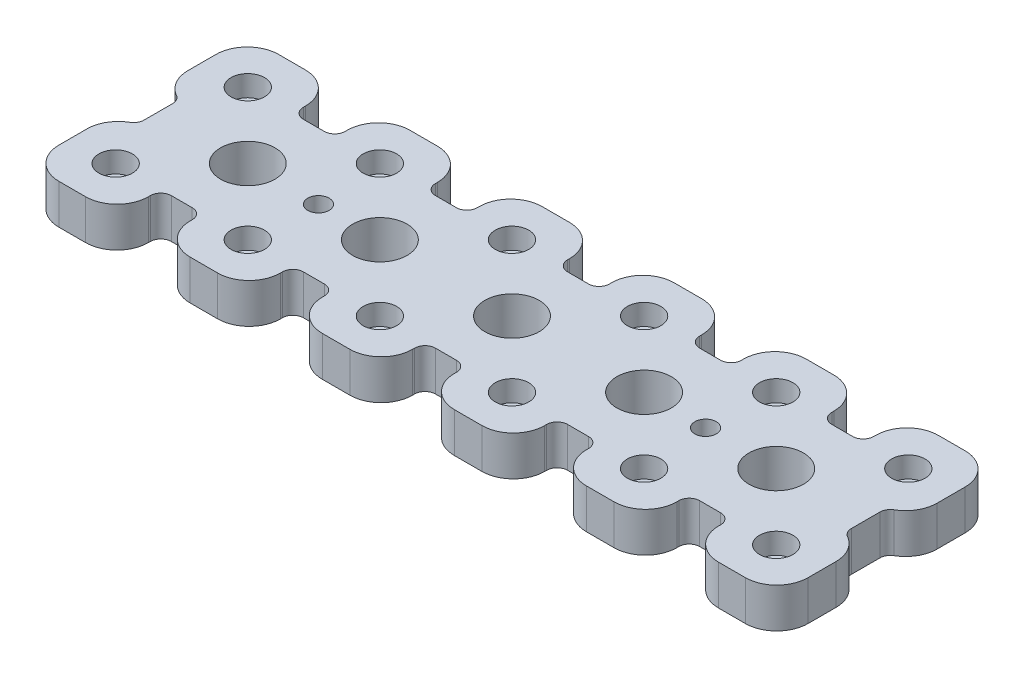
ISO-10303-21;
HEADER;
FILE_DESCRIPTION(('STEP AP214'),'2;1');
FILE_NAME('part.step','',(''),(''),'','','');
FILE_SCHEMA(('AUTOMOTIVE_DESIGN { 1 0 10303 214 1 1 1 1 }'));
ENDSEC;
DATA;
#1=APPLICATION_CONTEXT('core data for automotive mechanical design processes');
#2=APPLICATION_PROTOCOL_DEFINITION('international standard','automotive_design',2000,#1);
#3=PRODUCT_CONTEXT('',#1,'mechanical');
#4=PRODUCT('Part','Part','',(#3));
#5=PRODUCT_RELATED_PRODUCT_CATEGORY('part','',(#4));
#6=PRODUCT_DEFINITION_FORMATION('','',#4);
#7=PRODUCT_DEFINITION_CONTEXT('part definition',#1,'design');
#8=PRODUCT_DEFINITION('design','',#6,#7);
#9=PRODUCT_DEFINITION_SHAPE('','',#8);
#10=(LENGTH_UNIT() NAMED_UNIT(*) SI_UNIT(.MILLI.,.METRE.));
#11=(NAMED_UNIT(*) PLANE_ANGLE_UNIT() SI_UNIT($,.RADIAN.));
#12=(NAMED_UNIT(*) SI_UNIT($,.STERADIAN.) SOLID_ANGLE_UNIT());
#13=UNCERTAINTY_MEASURE_WITH_UNIT(LENGTH_MEASURE(1.E-05),#10,'distance_accuracy_value','');
#14=(GEOMETRIC_REPRESENTATION_CONTEXT(3) GLOBAL_UNCERTAINTY_ASSIGNED_CONTEXT((#13)) GLOBAL_UNIT_ASSIGNED_CONTEXT((#10,
#11,#12)) REPRESENTATION_CONTEXT('',''));
#15=CARTESIAN_POINT('',(0.,0.,0.));
#16=DIRECTION('',(0.,0.,1.));
#17=DIRECTION('',(1.,0.,0.));
#18=AXIS2_PLACEMENT_3D('',#15,#16,#17);
#19=CARTESIAN_POINT('',(-179.,0.,52.5));
#20=DIRECTION('',(0.,1.,0.));
#21=DIRECTION('',(0.,0.,1.));
#22=AXIS2_PLACEMENT_3D('',#19,#20,#21);
#23=PLANE('',#22);
#24=CARTESIAN_POINT('',(157.815,0.,45.563));
#25=DIRECTION('',(0.,-1.,0.));
#26=DIRECTION('',(0.,0.,-1.));
#27=AXIS2_PLACEMENT_3D('',#24,#25,#26);
#28=CIRCLE('',#27,3.05);
#29=CARTESIAN_POINT('',(157.815,0.,42.513));
#30=VERTEX_POINT('',#29);
#31=EDGE_CURVE('E683',#30,#30,#28,.T.);
#32=ORIENTED_EDGE('',*,*,#31,.F.);
#33=EDGE_LOOP('',(#32));
#34=FACE_BOUND('',#33,.T.);
#35=CARTESIAN_POINT('',(31.563,0.,45.563));
#36=DIRECTION('',(0.,-1.,0.));
#37=DIRECTION('',(0.,0.,-1.));
#38=AXIS2_PLACEMENT_3D('',#35,#36,#37);
#39=CIRCLE('',#38,3.05);
#40=CARTESIAN_POINT('',(31.563,0.,42.513));
#41=VERTEX_POINT('',#40);
#42=EDGE_CURVE('E695',#41,#41,#39,.T.);
#43=ORIENTED_EDGE('',*,*,#42,.F.);
#44=EDGE_LOOP('',(#43));
#45=FACE_BOUND('',#44,.T.);
#46=CARTESIAN_POINT('',(-94.689,0.,45.563));
#47=DIRECTION('',(0.,-1.,0.));
#48=DIRECTION('',(0.,0.,-1.));
#49=AXIS2_PLACEMENT_3D('',#46,#47,#48);
#50=CIRCLE('',#49,3.05);
#51=CARTESIAN_POINT('',(-94.689,0.,42.513));
#52=VERTEX_POINT('',#51);
#53=EDGE_CURVE('E707',#52,#52,#50,.T.);
#54=ORIENTED_EDGE('',*,*,#53,.F.);
#55=EDGE_LOOP('',(#54));
#56=FACE_BOUND('',#55,.T.);
#57=CARTESIAN_POINT('',(94.689,0.,-45.563));
#58=DIRECTION('',(0.,-1.,0.));
#59=DIRECTION('',(0.,0.,-1.));
#60=AXIS2_PLACEMENT_3D('',#57,#58,#59);
#61=CIRCLE('',#60,3.05);
#62=CARTESIAN_POINT('',(94.689,0.,-48.613));
#63=VERTEX_POINT('',#62);
#64=EDGE_CURVE('E719',#63,#63,#61,.T.);
#65=ORIENTED_EDGE('',*,*,#64,.F.);
#66=EDGE_LOOP('',(#65));
#67=FACE_BOUND('',#66,.T.);
#68=CARTESIAN_POINT('',(-31.563,0.,-45.563));
#69=DIRECTION('',(0.,-1.,0.));
#70=DIRECTION('',(0.,0.,-1.));
#71=AXIS2_PLACEMENT_3D('',#68,#69,#70);
#72=CIRCLE('',#71,3.05);
#73=CARTESIAN_POINT('',(-31.563,0.,-48.613));
#74=VERTEX_POINT('',#73);
#75=EDGE_CURVE('E731',#74,#74,#72,.T.);
#76=ORIENTED_EDGE('',*,*,#75,.F.);
#77=EDGE_LOOP('',(#76));
#78=FACE_BOUND('',#77,.T.);
#79=CARTESIAN_POINT('',(-157.815,0.,-45.563));
#80=DIRECTION('',(0.,-1.,0.));
#81=DIRECTION('',(0.,0.,-1.));
#82=AXIS2_PLACEMENT_3D('',#79,#80,#81);
#83=CIRCLE('',#82,3.05);
#84=CARTESIAN_POINT('',(-157.815,0.,-48.613));
#85=VERTEX_POINT('',#84);
#86=EDGE_CURVE('E743',#85,#85,#83,.T.);
#87=ORIENTED_EDGE('',*,*,#86,.F.);
#88=EDGE_LOOP('',(#87));
#89=FACE_BOUND('',#88,.T.);
#90=CARTESIAN_POINT('',(0.,0.,0.));
#91=DIRECTION('',(0.,1.,0.));
#92=DIRECTION('',(0.,0.,1.));
#93=AXIS2_PLACEMENT_3D('',#90,#91,#92);
#94=CIRCLE('',#93,13.);
#95=CARTESIAN_POINT('',(0.,0.,13.));
#96=VERTEX_POINT('',#95);
#97=EDGE_CURVE('E749',#96,#96,#94,.T.);
#98=ORIENTED_EDGE('',*,*,#97,.T.);
#99=EDGE_LOOP('',(#98));
#100=FACE_BOUND('',#99,.T.);
#101=CARTESIAN_POINT('',(-126.252,0.,0.));
#102=DIRECTION('',(0.,1.,0.));
#103=DIRECTION('',(0.,0.,1.));
#104=AXIS2_PLACEMENT_3D('',#101,#102,#103);
#105=CIRCLE('',#104,13.);
#106=CARTESIAN_POINT('',(-126.252,0.,13.));
#107=VERTEX_POINT('',#106);
#108=EDGE_CURVE('E755',#107,#107,#105,.T.);
#109=ORIENTED_EDGE('',*,*,#108,.T.);
#110=EDGE_LOOP('',(#109));
#111=FACE_BOUND('',#110,.T.);
#112=CARTESIAN_POINT('',(126.252,0.,0.));
#113=DIRECTION('',(0.,1.,0.));
#114=DIRECTION('',(0.,0.,1.));
#115=AXIS2_PLACEMENT_3D('',#112,#113,#114);
#116=CIRCLE('',#115,13.);
#117=CARTESIAN_POINT('',(126.252,0.,13.));
#118=VERTEX_POINT('',#117);
#119=EDGE_CURVE('E761',#118,#118,#116,.T.);
#120=ORIENTED_EDGE('',*,*,#119,.T.);
#121=EDGE_LOOP('',(#120));
#122=FACE_BOUND('',#121,.T.);
#123=CARTESIAN_POINT('',(63.126,0.,0.));
#124=DIRECTION('',(0.,1.,0.));
#125=DIRECTION('',(0.,0.,1.));
#126=AXIS2_PLACEMENT_3D('',#123,#124,#125);
#127=CIRCLE('',#126,13.);
#128=CARTESIAN_POINT('',(63.126,0.,13.));
#129=VERTEX_POINT('',#128);
#130=EDGE_CURVE('E767',#129,#129,#127,.T.);
#131=ORIENTED_EDGE('',*,*,#130,.T.);
#132=EDGE_LOOP('',(#131));
#133=FACE_BOUND('',#132,.T.);
#134=CARTESIAN_POINT('',(-63.126,0.,0.));
#135=DIRECTION('',(0.,1.,0.));
#136=DIRECTION('',(0.,0.,1.));
#137=AXIS2_PLACEMENT_3D('',#134,#135,#136);
#138=CIRCLE('',#137,13.);
#139=CARTESIAN_POINT('',(-63.126,0.,13.));
#140=VERTEX_POINT('',#139);
#141=EDGE_CURVE('E773',#140,#140,#138,.T.);
#142=ORIENTED_EDGE('',*,*,#141,.T.);
#143=EDGE_LOOP('',(#142));
#144=FACE_BOUND('',#143,.T.);
#145=CARTESIAN_POINT('',(92.5,0.,0.));
#146=DIRECTION('',(0.,1.,0.));
#147=DIRECTION('',(0.,0.,1.));
#148=AXIS2_PLACEMENT_3D('',#145,#146,#147);
#149=CIRCLE('',#148,5.1);
#150=CARTESIAN_POINT('',(92.5,0.,5.1));
#151=VERTEX_POINT('',#150);
#152=EDGE_CURVE('E776',#151,#151,#149,.T.);
#153=ORIENTED_EDGE('',*,*,#152,.T.);
#154=EDGE_LOOP('',(#153));
#155=FACE_BOUND('',#154,.T.);
#156=CARTESIAN_POINT('',(-92.5,0.,0.));
#157=DIRECTION('',(0.,1.,0.));
#158=DIRECTION('',(0.,0.,1.));
#159=AXIS2_PLACEMENT_3D('',#156,#157,#158);
#160=CIRCLE('',#159,5.1);
#161=CARTESIAN_POINT('',(-92.5,0.,5.1));
#162=VERTEX_POINT('',#161);
#163=EDGE_CURVE('E782',#162,#162,#160,.T.);
#164=ORIENTED_EDGE('',*,*,#163,.T.);
#165=EDGE_LOOP('',(#164));
#166=FACE_BOUND('',#165,.T.);
#167=DIRECTION('',(-1.,0.,0.));
#168=VECTOR('',#167,1.);
#169=CARTESIAN_POINT('',(-179.,0.,-52.5));
#170=LINE('',#169,#168);
#171=CARTESIAN_POINT('',(101.252,0.,-52.5));
#172=VERTEX_POINT('',#171);
#173=CARTESIAN_POINT('',(88.126,0.,-52.5));
#174=VERTEX_POINT('',#173);
#175=EDGE_CURVE('E1138',#172,#174,#170,.T.);
#176=ORIENTED_EDGE('',*,*,#175,.F.);
#177=CARTESIAN_POINT('',(101.252,0.,-37.5));
#178=DIRECTION('',(0.,1.,0.));
#179=DIRECTION('',(0.,0.,1.));
#180=AXIS2_PLACEMENT_3D('',#177,#178,#179);
#181=CIRCLE('',#180,15.);
#182=CARTESIAN_POINT('',(116.252,0.,-37.5));
#183=VERTEX_POINT('',#182);
#184=EDGE_CURVE('E1272',#172,#183,#181,.F.);
#185=ORIENTED_EDGE('',*,*,#184,.T.);
#186=DIRECTION('',(0.,0.,1.));
#187=VECTOR('',#186,1.);
#188=CARTESIAN_POINT('',(116.252,0.,-52.5));
#189=LINE('',#188,#187);
#190=CARTESIAN_POINT('',(116.252,0.,-36.563));
#191=VERTEX_POINT('',#190);
#192=EDGE_CURVE('E882',#183,#191,#189,.T.);
#193=ORIENTED_EDGE('',*,*,#192,.T.);
#194=CARTESIAN_POINT('',(121.252,0.,-36.563));
#195=DIRECTION('',(0.,1.,0.));
#196=DIRECTION('',(0.,0.,1.));
#197=AXIS2_PLACEMENT_3D('',#194,#195,#196);
#198=CIRCLE('',#197,5.);
#199=CARTESIAN_POINT('',(121.252,0.,-31.563));
#200=VERTEX_POINT('',#199);
#201=EDGE_CURVE('E1607',#191,#200,#198,.T.);
#202=ORIENTED_EDGE('',*,*,#201,.T.);
#203=DIRECTION('',(1.,0.,0.));
#204=VECTOR('',#203,1.);
#205=CARTESIAN_POINT('',(136.252,0.,-31.563));
#206=LINE('',#205,#204);
#207=CARTESIAN_POINT('',(131.252,0.,-31.563));
#208=VERTEX_POINT('',#207);
#209=EDGE_CURVE('E886',#200,#208,#206,.T.);
#210=ORIENTED_EDGE('',*,*,#209,.T.);
#211=CARTESIAN_POINT('',(131.252,0.,-36.563));
#212=DIRECTION('',(0.,1.,0.));
#213=DIRECTION('',(0.,0.,1.));
#214=AXIS2_PLACEMENT_3D('',#211,#212,#213);
#215=CIRCLE('',#214,5.);
#216=CARTESIAN_POINT('',(136.252,0.,-36.563));
#217=VERTEX_POINT('',#216);
#218=EDGE_CURVE('E1611',#208,#217,#215,.T.);
#219=ORIENTED_EDGE('',*,*,#218,.T.);
#220=DIRECTION('',(0.,0.,-1.));
#221=VECTOR('',#220,1.);
#222=CARTESIAN_POINT('',(136.252,0.,-52.5));
#223=LINE('',#222,#221);
#224=CARTESIAN_POINT('',(136.252,0.,-37.5));
#225=VERTEX_POINT('',#224);
#226=EDGE_CURVE('E880',#217,#225,#223,.T.);
#227=ORIENTED_EDGE('',*,*,#226,.T.);
#228=CARTESIAN_POINT('',(151.252,0.,-37.5));
#229=DIRECTION('',(0.,1.,0.));
#230=DIRECTION('',(0.,0.,1.));
#231=AXIS2_PLACEMENT_3D('',#228,#229,#230);
#232=CIRCLE('',#231,15.);
#233=CARTESIAN_POINT('',(151.252,0.,-52.5));
#234=VERTEX_POINT('',#233);
#235=EDGE_CURVE('E1216',#225,#234,#232,.F.);
#236=ORIENTED_EDGE('',*,*,#235,.T.);
#237=CARTESIAN_POINT('',(164.,0.,-52.5));
#238=VERTEX_POINT('',#237);
#239=EDGE_CURVE('E1135',#238,#234,#170,.T.);
#240=ORIENTED_EDGE('',*,*,#239,.F.);
#241=CARTESIAN_POINT('',(164.,0.,-37.5));
#242=DIRECTION('',(0.,1.,0.));
#243=DIRECTION('',(0.,0.,1.));
#244=AXIS2_PLACEMENT_3D('',#241,#242,#243);
#245=CIRCLE('',#244,15.);
#246=CARTESIAN_POINT('',(179.,0.,-37.5));
#247=VERTEX_POINT('',#246);
#248=EDGE_CURVE('E1218',#238,#247,#245,.F.);
#249=ORIENTED_EDGE('',*,*,#248,.T.);
#250=DIRECTION('',(0.,0.,-1.));
#251=VECTOR('',#250,1.);
#252=CARTESIAN_POINT('',(179.,0.,-52.5));
#253=LINE('',#252,#251);
#254=CARTESIAN_POINT('',(179.,0.,-24.142135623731));
#255=VERTEX_POINT('',#254);
#256=EDGE_CURVE('E1128',#255,#247,#253,.T.);
#257=ORIENTED_EDGE('',*,*,#256,.F.);
#258=CARTESIAN_POINT('',(164.,0.,-24.142135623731));
#259=DIRECTION('',(0.,1.,0.));
#260=DIRECTION('',(0.,0.,1.));
#261=AXIS2_PLACEMENT_3D('',#258,#259,#260);
#262=CIRCLE('',#261,15.);
#263=CARTESIAN_POINT('',(171.5,0.,-11.1517545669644));
#264=VERTEX_POINT('',#263);
#265=EDGE_CURVE('E1220',#255,#264,#262,.F.);
#266=ORIENTED_EDGE('',*,*,#265,.T.);
#267=CARTESIAN_POINT('',(174.,0.,-6.82162754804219));
#268=DIRECTION('',(0.,1.,0.));
#269=DIRECTION('',(0.,0.,1.));
#270=AXIS2_PLACEMENT_3D('',#267,#268,#269);
#271=CIRCLE('',#270,5.);
#272=CARTESIAN_POINT('',(169.,0.,-6.82162754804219));
#273=VERTEX_POINT('',#272);
#274=EDGE_CURVE('E1615',#264,#273,#271,.T.);
#275=ORIENTED_EDGE('',*,*,#274,.T.);
#276=DIRECTION('',(0.,0.,1.));
#277=VECTOR('',#276,1.);
#278=CARTESIAN_POINT('',(169.,0.,-10.));
#279=LINE('',#278,#277);
#280=CARTESIAN_POINT('',(169.,0.,6.82162754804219));
#281=VERTEX_POINT('',#280);
#282=EDGE_CURVE('E795',#273,#281,#279,.T.);
#283=ORIENTED_EDGE('',*,*,#282,.T.);
#284=CARTESIAN_POINT('',(174.,0.,6.82162754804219));
#285=DIRECTION('',(0.,1.,0.));
#286=DIRECTION('',(0.,0.,1.));
#287=AXIS2_PLACEMENT_3D('',#284,#285,#286);
#288=CIRCLE('',#287,5.);
#289=CARTESIAN_POINT('',(171.5,0.,11.1517545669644));
#290=VERTEX_POINT('',#289);
#291=EDGE_CURVE('E11',#281,#290,#288,.T.);
#292=ORIENTED_EDGE('',*,*,#291,.T.);
#293=CARTESIAN_POINT('',(164.,0.,24.142135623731));
#294=DIRECTION('',(0.,1.,0.));
#295=DIRECTION('',(0.,0.,1.));
#296=AXIS2_PLACEMENT_3D('',#293,#294,#295);
#297=CIRCLE('',#296,15.);
#298=CARTESIAN_POINT('',(179.,0.,24.142135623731));
#299=VERTEX_POINT('',#298);
#300=EDGE_CURVE('E1223',#290,#299,#297,.F.);
#301=ORIENTED_EDGE('',*,*,#300,.T.);
#302=CARTESIAN_POINT('',(179.,0.,37.5));
#303=VERTEX_POINT('',#302);
#304=EDGE_CURVE('E1131',#303,#299,#253,.T.);
#305=ORIENTED_EDGE('',*,*,#304,.F.);
#306=CARTESIAN_POINT('',(164.,0.,37.5));
#307=DIRECTION('',(0.,1.,0.));
#308=DIRECTION('',(0.,0.,1.));
#309=AXIS2_PLACEMENT_3D('',#306,#307,#308);
#310=CIRCLE('',#309,15.);
#311=CARTESIAN_POINT('',(164.,0.,52.5));
#312=VERTEX_POINT('',#311);
#313=EDGE_CURVE('E1225',#303,#312,#310,.F.);
#314=ORIENTED_EDGE('',*,*,#313,.T.);
#315=DIRECTION('',(1.,0.,0.));
#316=VECTOR('',#315,1.);
#317=CARTESIAN_POINT('',(-179.,0.,52.5));
#318=LINE('',#317,#316);
#319=CARTESIAN_POINT('',(151.252,0.,52.5));
#320=VERTEX_POINT('',#319);
#321=EDGE_CURVE('E1130',#320,#312,#318,.T.);
#322=ORIENTED_EDGE('',*,*,#321,.F.);
#323=CARTESIAN_POINT('',(151.252,0.,37.5));
#324=DIRECTION('',(0.,1.,0.));
#325=DIRECTION('',(0.,0.,1.));
#326=AXIS2_PLACEMENT_3D('',#323,#324,#325);
#327=CIRCLE('',#326,15.);
#328=CARTESIAN_POINT('',(136.252,0.,37.5));
#329=VERTEX_POINT('',#328);
#330=EDGE_CURVE('E1227',#320,#329,#327,.F.);
#331=ORIENTED_EDGE('',*,*,#330,.T.);
#332=DIRECTION('',(0.,0.,-1.));
#333=VECTOR('',#332,1.);
#334=CARTESIAN_POINT('',(136.252,0.,31.563));
#335=LINE('',#334,#333);
#336=CARTESIAN_POINT('',(136.252,0.,36.563));
#337=VERTEX_POINT('',#336);
#338=EDGE_CURVE('E848',#329,#337,#335,.T.);
#339=ORIENTED_EDGE('',*,*,#338,.T.);
#340=CARTESIAN_POINT('',(131.252,0.,36.563));
#341=DIRECTION('',(0.,1.,0.));
#342=DIRECTION('',(0.,0.,1.));
#343=AXIS2_PLACEMENT_3D('',#340,#341,#342);
#344=CIRCLE('',#343,5.);
#345=CARTESIAN_POINT('',(131.252,0.,31.563));
#346=VERTEX_POINT('',#345);
#347=EDGE_CURVE('E1527',#337,#346,#344,.T.);
#348=ORIENTED_EDGE('',*,*,#347,.T.);
#349=DIRECTION('',(-1.,0.,0.));
#350=VECTOR('',#349,1.);
#351=CARTESIAN_POINT('',(136.252,0.,31.563));
#352=LINE('',#351,#350);
#353=CARTESIAN_POINT('',(121.252,0.,31.563));
#354=VERTEX_POINT('',#353);
#355=EDGE_CURVE('E851',#346,#354,#352,.T.);
#356=ORIENTED_EDGE('',*,*,#355,.T.);
#357=CARTESIAN_POINT('',(121.252,0.,36.563));
#358=DIRECTION('',(0.,1.,0.));
#359=DIRECTION('',(0.,0.,1.));
#360=AXIS2_PLACEMENT_3D('',#357,#358,#359);
#361=CIRCLE('',#360,5.);
#362=CARTESIAN_POINT('',(116.252,0.,36.563));
#363=VERTEX_POINT('',#362);
#364=EDGE_CURVE('E1531',#354,#363,#361,.T.);
#365=ORIENTED_EDGE('',*,*,#364,.T.);
#366=DIRECTION('',(0.,0.,1.));
#367=VECTOR('',#366,1.);
#368=CARTESIAN_POINT('',(116.252,0.,31.563));
#369=LINE('',#368,#367);
#370=CARTESIAN_POINT('',(116.252,0.,37.5));
#371=VERTEX_POINT('',#370);
#372=EDGE_CURVE('E855',#363,#371,#369,.T.);
#373=ORIENTED_EDGE('',*,*,#372,.T.);
#374=CARTESIAN_POINT('',(101.252,0.,37.5));
#375=DIRECTION('',(0.,1.,0.));
#376=DIRECTION('',(0.,0.,1.));
#377=AXIS2_PLACEMENT_3D('',#374,#375,#376);
#378=CIRCLE('',#377,15.);
#379=CARTESIAN_POINT('',(101.252,0.,52.5));
#380=VERTEX_POINT('',#379);
#381=EDGE_CURVE('E1229',#371,#380,#378,.F.);
#382=ORIENTED_EDGE('',*,*,#381,.T.);
#383=CARTESIAN_POINT('',(88.126,0.,52.5));
#384=VERTEX_POINT('',#383);
#385=EDGE_CURVE('E1647',#384,#380,#318,.T.);
#386=ORIENTED_EDGE('',*,*,#385,.F.);
#387=CARTESIAN_POINT('',(88.126,0.,37.5));
#388=DIRECTION('',(0.,1.,0.));
#389=DIRECTION('',(0.,0.,1.));
#390=AXIS2_PLACEMENT_3D('',#387,#388,#389);
#391=CIRCLE('',#390,15.);
#392=CARTESIAN_POINT('',(73.126,0.,37.5));
#393=VERTEX_POINT('',#392);
#394=EDGE_CURVE('E1231',#384,#393,#391,.F.);
#395=ORIENTED_EDGE('',*,*,#394,.T.);
#396=DIRECTION('',(0.,0.,-1.));
#397=VECTOR('',#396,1.);
#398=CARTESIAN_POINT('',(73.126,0.,31.563));
#399=LINE('',#398,#397);
#400=CARTESIAN_POINT('',(73.126,0.,36.563));
#401=VERTEX_POINT('',#400);
#402=EDGE_CURVE('E912',#393,#401,#399,.T.);
#403=ORIENTED_EDGE('',*,*,#402,.T.);
#404=CARTESIAN_POINT('',(68.126,0.,36.563));
#405=DIRECTION('',(0.,1.,0.));
#406=DIRECTION('',(0.,0.,1.));
#407=AXIS2_PLACEMENT_3D('',#404,#405,#406);
#408=CIRCLE('',#407,5.);
#409=CARTESIAN_POINT('',(68.126,0.,31.563));
#410=VERTEX_POINT('',#409);
#411=EDGE_CURVE('E1539',#401,#410,#408,.T.);
#412=ORIENTED_EDGE('',*,*,#411,.T.);
#413=DIRECTION('',(-1.,0.,0.));
#414=VECTOR('',#413,1.);
#415=CARTESIAN_POINT('',(73.126,0.,31.563));
#416=LINE('',#415,#414);
#417=CARTESIAN_POINT('',(58.126,0.,31.563));
#418=VERTEX_POINT('',#417);
#419=EDGE_CURVE('E915',#410,#418,#416,.T.);
#420=ORIENTED_EDGE('',*,*,#419,.T.);
#421=CARTESIAN_POINT('',(58.126,0.,36.563));
#422=DIRECTION('',(0.,1.,0.));
#423=DIRECTION('',(0.,0.,1.));
#424=AXIS2_PLACEMENT_3D('',#421,#422,#423);
#425=CIRCLE('',#424,5.);
#426=CARTESIAN_POINT('',(53.126,0.,36.563));
#427=VERTEX_POINT('',#426);
#428=EDGE_CURVE('E1535',#418,#427,#425,.T.);
#429=ORIENTED_EDGE('',*,*,#428,.T.);
#430=DIRECTION('',(0.,0.,1.));
#431=VECTOR('',#430,1.);
#432=CARTESIAN_POINT('',(53.126,0.,31.563));
#433=LINE('',#432,#431);
#434=CARTESIAN_POINT('',(53.126,0.,37.5));
#435=VERTEX_POINT('',#434);
#436=EDGE_CURVE('E919',#427,#435,#433,.T.);
#437=ORIENTED_EDGE('',*,*,#436,.T.);
#438=CARTESIAN_POINT('',(38.126,0.,37.5));
#439=DIRECTION('',(0.,1.,0.));
#440=DIRECTION('',(0.,0.,1.));
#441=AXIS2_PLACEMENT_3D('',#438,#439,#440);
#442=CIRCLE('',#441,15.);
#443=CARTESIAN_POINT('',(38.126,0.,52.5));
#444=VERTEX_POINT('',#443);
#445=EDGE_CURVE('E1233',#435,#444,#442,.F.);
#446=ORIENTED_EDGE('',*,*,#445,.T.);
#447=CARTESIAN_POINT('',(25.,0.,52.5));
#448=VERTEX_POINT('',#447);
#449=EDGE_CURVE('E1649',#448,#444,#318,.T.);
#450=ORIENTED_EDGE('',*,*,#449,.F.);
#451=CARTESIAN_POINT('',(25.,0.,37.5));
#452=DIRECTION('',(0.,1.,0.));
#453=DIRECTION('',(0.,0.,1.));
#454=AXIS2_PLACEMENT_3D('',#451,#452,#453);
#455=CIRCLE('',#454,15.);
#456=CARTESIAN_POINT('',(10.,0.,37.5));
#457=VERTEX_POINT('',#456);
#458=EDGE_CURVE('E1235',#448,#457,#455,.F.);
#459=ORIENTED_EDGE('',*,*,#458,.T.);
#460=DIRECTION('',(0.,0.,-1.));
#461=VECTOR('',#460,1.);
#462=CARTESIAN_POINT('',(10.,0.,52.5));
#463=LINE('',#462,#461);
#464=CARTESIAN_POINT('',(10.,0.,36.563));
#465=VERTEX_POINT('',#464);
#466=EDGE_CURVE('E928',#457,#465,#463,.T.);
#467=ORIENTED_EDGE('',*,*,#466,.T.);
#468=CARTESIAN_POINT('',(5.,0.,36.563));
#469=DIRECTION('',(0.,1.,0.));
#470=DIRECTION('',(0.,0.,1.));
#471=AXIS2_PLACEMENT_3D('',#468,#469,#470);
#472=CIRCLE('',#471,5.);
#473=CARTESIAN_POINT('',(5.,0.,31.563));
#474=VERTEX_POINT('',#473);
#475=EDGE_CURVE('E1543',#465,#474,#472,.T.);
#476=ORIENTED_EDGE('',*,*,#475,.T.);
#477=DIRECTION('',(-1.,0.,0.));
#478=VECTOR('',#477,1.);
#479=CARTESIAN_POINT('',(10.,0.,31.563));
#480=LINE('',#479,#478);
#481=CARTESIAN_POINT('',(-5.,0.,31.563));
#482=VERTEX_POINT('',#481);
#483=EDGE_CURVE('E931',#474,#482,#480,.T.);
#484=ORIENTED_EDGE('',*,*,#483,.T.);
#485=CARTESIAN_POINT('',(-5.,0.,36.563));
#486=DIRECTION('',(0.,1.,0.));
#487=DIRECTION('',(0.,0.,1.));
#488=AXIS2_PLACEMENT_3D('',#485,#486,#487);
#489=CIRCLE('',#488,5.);
#490=CARTESIAN_POINT('',(-10.,0.,36.563));
#491=VERTEX_POINT('',#490);
#492=EDGE_CURVE('E1547',#482,#491,#489,.T.);
#493=ORIENTED_EDGE('',*,*,#492,.T.);
#494=DIRECTION('',(0.,0.,1.));
#495=VECTOR('',#494,1.);
#496=CARTESIAN_POINT('',(-10.,0.,52.5));
#497=LINE('',#496,#495);
#498=CARTESIAN_POINT('',(-10.,0.,37.5));
#499=VERTEX_POINT('',#498);
#500=EDGE_CURVE('E935',#491,#499,#497,.T.);
#501=ORIENTED_EDGE('',*,*,#500,.T.);
#502=CARTESIAN_POINT('',(-25.,0.,37.5));
#503=DIRECTION('',(0.,1.,0.));
#504=DIRECTION('',(0.,0.,1.));
#505=AXIS2_PLACEMENT_3D('',#502,#503,#504);
#506=CIRCLE('',#505,15.);
#507=CARTESIAN_POINT('',(-25.,0.,52.5));
#508=VERTEX_POINT('',#507);
#509=EDGE_CURVE('E1237',#499,#508,#506,.F.);
#510=ORIENTED_EDGE('',*,*,#509,.T.);
#511=CARTESIAN_POINT('',(-38.126,0.,52.5));
#512=VERTEX_POINT('',#511);
#513=EDGE_CURVE('E3135',#512,#508,#318,.T.);
#514=ORIENTED_EDGE('',*,*,#513,.F.);
#515=CARTESIAN_POINT('',(-38.126,0.,37.5));
#516=DIRECTION('',(0.,1.,0.));
#517=DIRECTION('',(0.,0.,1.));
#518=AXIS2_PLACEMENT_3D('',#515,#516,#517);
#519=CIRCLE('',#518,15.);
#520=CARTESIAN_POINT('',(-53.126,0.,37.5));
#521=VERTEX_POINT('',#520);
#522=EDGE_CURVE('E1239',#512,#521,#519,.F.);
#523=ORIENTED_EDGE('',*,*,#522,.T.);
#524=DIRECTION('',(0.,0.,-1.));
#525=VECTOR('',#524,1.);
#526=CARTESIAN_POINT('',(-53.126,0.,52.5));
#527=LINE('',#526,#525);
#528=CARTESIAN_POINT('',(-53.126,0.,36.563));
#529=VERTEX_POINT('',#528);
#530=EDGE_CURVE('E832',#521,#529,#527,.T.);
#531=ORIENTED_EDGE('',*,*,#530,.T.);
#532=CARTESIAN_POINT('',(-58.126,0.,36.563));
#533=DIRECTION('',(0.,1.,0.));
#534=DIRECTION('',(0.,0.,1.));
#535=AXIS2_PLACEMENT_3D('',#532,#533,#534);
#536=CIRCLE('',#535,5.);
#537=CARTESIAN_POINT('',(-58.126,0.,31.563));
#538=VERTEX_POINT('',#537);
#539=EDGE_CURVE('E1551',#529,#538,#536,.T.);
#540=ORIENTED_EDGE('',*,*,#539,.T.);
#541=DIRECTION('',(-1.,0.,0.));
#542=VECTOR('',#541,1.);
#543=CARTESIAN_POINT('',(-53.126,0.,31.563));
#544=LINE('',#543,#542);
#545=CARTESIAN_POINT('',(-68.126,0.,31.563));
#546=VERTEX_POINT('',#545);
#547=EDGE_CURVE('E835',#538,#546,#544,.T.);
#548=ORIENTED_EDGE('',*,*,#547,.T.);
#549=CARTESIAN_POINT('',(-68.126,0.,36.563));
#550=DIRECTION('',(0.,1.,0.));
#551=DIRECTION('',(0.,0.,1.));
#552=AXIS2_PLACEMENT_3D('',#549,#550,#551);
#553=CIRCLE('',#552,5.);
#554=CARTESIAN_POINT('',(-73.126,0.,36.563));
#555=VERTEX_POINT('',#554);
#556=EDGE_CURVE('E1555',#546,#555,#553,.T.);
#557=ORIENTED_EDGE('',*,*,#556,.T.);
#558=DIRECTION('',(0.,0.,1.));
#559=VECTOR('',#558,1.);
#560=CARTESIAN_POINT('',(-73.126,0.,52.5));
#561=LINE('',#560,#559);
#562=CARTESIAN_POINT('',(-73.126,0.,37.5));
#563=VERTEX_POINT('',#562);
#564=EDGE_CURVE('E839',#555,#563,#561,.T.);
#565=ORIENTED_EDGE('',*,*,#564,.T.);
#566=CARTESIAN_POINT('',(-88.126,0.,37.5));
#567=DIRECTION('',(0.,1.,0.));
#568=DIRECTION('',(0.,0.,1.));
#569=AXIS2_PLACEMENT_3D('',#566,#567,#568);
#570=CIRCLE('',#569,15.);
#571=CARTESIAN_POINT('',(-88.126,0.,52.5));
#572=VERTEX_POINT('',#571);
#573=EDGE_CURVE('E1241',#563,#572,#570,.F.);
#574=ORIENTED_EDGE('',*,*,#573,.T.);
#575=CARTESIAN_POINT('',(-101.252,0.,52.5));
#576=VERTEX_POINT('',#575);
#577=EDGE_CURVE('E1129',#576,#572,#318,.T.);
#578=ORIENTED_EDGE('',*,*,#577,.F.);
#579=CARTESIAN_POINT('',(-101.252,0.,37.5));
#580=DIRECTION('',(0.,1.,0.));
#581=DIRECTION('',(0.,0.,1.));
#582=AXIS2_PLACEMENT_3D('',#579,#580,#581);
#583=CIRCLE('',#582,15.);
#584=CARTESIAN_POINT('',(-116.252,0.,37.5));
#585=VERTEX_POINT('',#584);
#586=EDGE_CURVE('E1243',#576,#585,#583,.F.);
#587=ORIENTED_EDGE('',*,*,#586,.T.);
#588=DIRECTION('',(0.,0.,-1.));
#589=VECTOR('',#588,1.);
#590=CARTESIAN_POINT('',(-116.252,0.,52.5));
#591=LINE('',#590,#589);
#592=CARTESIAN_POINT('',(-116.252,0.,36.563));
#593=VERTEX_POINT('',#592);
#594=EDGE_CURVE('E800',#585,#593,#591,.T.);
#595=ORIENTED_EDGE('',*,*,#594,.T.);
#596=CARTESIAN_POINT('',(-121.252,0.,36.563));
#597=DIRECTION('',(0.,1.,0.));
#598=DIRECTION('',(0.,0.,1.));
#599=AXIS2_PLACEMENT_3D('',#596,#597,#598);
#600=CIRCLE('',#599,5.);
#601=CARTESIAN_POINT('',(-121.252,0.,31.563));
#602=VERTEX_POINT('',#601);
#603=EDGE_CURVE('E1563',#593,#602,#600,.T.);
#604=ORIENTED_EDGE('',*,*,#603,.T.);
#605=DIRECTION('',(-1.,0.,0.));
#606=VECTOR('',#605,1.);
#607=CARTESIAN_POINT('',(-116.252,0.,31.563));
#608=LINE('',#607,#606);
#609=CARTESIAN_POINT('',(-131.252,0.,31.563));
#610=VERTEX_POINT('',#609);
#611=EDGE_CURVE('E803',#602,#610,#608,.T.);
#612=ORIENTED_EDGE('',*,*,#611,.T.);
#613=CARTESIAN_POINT('',(-131.252,0.,36.563));
#614=DIRECTION('',(0.,1.,0.));
#615=DIRECTION('',(0.,0.,1.));
#616=AXIS2_PLACEMENT_3D('',#613,#614,#615);
#617=CIRCLE('',#616,5.);
#618=CARTESIAN_POINT('',(-136.252,0.,36.563));
#619=VERTEX_POINT('',#618);
#620=EDGE_CURVE('E1559',#610,#619,#617,.T.);
#621=ORIENTED_EDGE('',*,*,#620,.T.);
#622=DIRECTION('',(0.,0.,1.));
#623=VECTOR('',#622,1.);
#624=CARTESIAN_POINT('',(-136.252,0.,52.5));
#625=LINE('',#624,#623);
#626=CARTESIAN_POINT('',(-136.252,0.,37.5));
#627=VERTEX_POINT('',#626);
#628=EDGE_CURVE('E807',#619,#627,#625,.T.);
#629=ORIENTED_EDGE('',*,*,#628,.T.);
#630=CARTESIAN_POINT('',(-151.252,0.,37.5));
#631=DIRECTION('',(0.,1.,0.));
#632=DIRECTION('',(0.,0.,1.));
#633=AXIS2_PLACEMENT_3D('',#630,#631,#632);
#634=CIRCLE('',#633,15.);
#635=CARTESIAN_POINT('',(-151.252,0.,52.5));
#636=VERTEX_POINT('',#635);
#637=EDGE_CURVE('E1245',#627,#636,#634,.F.);
#638=ORIENTED_EDGE('',*,*,#637,.T.);
#639=CARTESIAN_POINT('',(-164.,0.,52.5));
#640=VERTEX_POINT('',#639);
#641=EDGE_CURVE('E1125',#640,#636,#318,.T.);
#642=ORIENTED_EDGE('',*,*,#641,.F.);
#643=CARTESIAN_POINT('',(-164.,0.,37.5));
#644=DIRECTION('',(0.,1.,0.));
#645=DIRECTION('',(0.,0.,1.));
#646=AXIS2_PLACEMENT_3D('',#643,#644,#645);
#647=CIRCLE('',#646,15.);
#648=CARTESIAN_POINT('',(-179.,0.,37.5));
#649=VERTEX_POINT('',#648);
#650=EDGE_CURVE('E1247',#640,#649,#647,.F.);
#651=ORIENTED_EDGE('',*,*,#650,.T.);
#652=DIRECTION('',(0.,0.,1.));
#653=VECTOR('',#652,1.);
#654=CARTESIAN_POINT('',(-179.,0.,-52.5));
#655=LINE('',#654,#653);
#656=CARTESIAN_POINT('',(-179.,0.,24.142135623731));
#657=VERTEX_POINT('',#656);
#658=EDGE_CURVE('E1103',#657,#649,#655,.T.);
#659=ORIENTED_EDGE('',*,*,#658,.F.);
#660=CARTESIAN_POINT('',(-164.,0.,24.142135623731));
#661=DIRECTION('',(0.,1.,0.));
#662=DIRECTION('',(0.,0.,1.));
#663=AXIS2_PLACEMENT_3D('',#660,#661,#662);
#664=CIRCLE('',#663,15.);
#665=CARTESIAN_POINT('',(-171.5,0.,11.1517545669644));
#666=VERTEX_POINT('',#665);
#667=EDGE_CURVE('E1249',#657,#666,#664,.F.);
#668=ORIENTED_EDGE('',*,*,#667,.T.);
#669=CARTESIAN_POINT('',(-174.,0.,6.82162754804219));
#670=DIRECTION('',(0.,1.,0.));
#671=DIRECTION('',(0.,0.,1.));
#672=AXIS2_PLACEMENT_3D('',#669,#670,#671);
#673=CIRCLE('',#672,5.);
#674=CARTESIAN_POINT('',(-169.,0.,6.82162754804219));
#675=VERTEX_POINT('',#674);
#676=EDGE_CURVE('E1567',#666,#675,#673,.T.);
#677=ORIENTED_EDGE('',*,*,#676,.T.);
#678=DIRECTION('',(0.,0.,-1.));
#679=VECTOR('',#678,1.);
#680=CARTESIAN_POINT('',(-169.,0.,-10.));
#681=LINE('',#680,#679);
#682=CARTESIAN_POINT('',(-169.,0.,-6.82162754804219));
#683=VERTEX_POINT('',#682);
#684=EDGE_CURVE('E789',#675,#683,#681,.T.);
#685=ORIENTED_EDGE('',*,*,#684,.T.);
#686=CARTESIAN_POINT('',(-174.,0.,-6.82162754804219));
#687=DIRECTION('',(0.,1.,0.));
#688=DIRECTION('',(0.,0.,1.));
#689=AXIS2_PLACEMENT_3D('',#686,#687,#688);
#690=CIRCLE('',#689,5.);
#691=CARTESIAN_POINT('',(-171.5,0.,-11.1517545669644));
#692=VERTEX_POINT('',#691);
#693=EDGE_CURVE('E1571',#683,#692,#690,.T.);
#694=ORIENTED_EDGE('',*,*,#693,.T.);
#695=CARTESIAN_POINT('',(-164.,0.,-24.142135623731));
#696=DIRECTION('',(0.,1.,0.));
#697=DIRECTION('',(0.,0.,1.));
#698=AXIS2_PLACEMENT_3D('',#695,#696,#697);
#699=CIRCLE('',#698,15.);
#700=CARTESIAN_POINT('',(-179.,0.,-24.142135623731));
#701=VERTEX_POINT('',#700);
#702=EDGE_CURVE('E1252',#692,#701,#699,.F.);
#703=ORIENTED_EDGE('',*,*,#702,.T.);
#704=CARTESIAN_POINT('',(-179.,0.,-37.5));
#705=VERTEX_POINT('',#704);
#706=EDGE_CURVE('E1124',#705,#701,#655,.T.);
#707=ORIENTED_EDGE('',*,*,#706,.F.);
#708=CARTESIAN_POINT('',(-164.,0.,-37.5));
#709=DIRECTION('',(0.,1.,0.));
#710=DIRECTION('',(0.,0.,1.));
#711=AXIS2_PLACEMENT_3D('',#708,#709,#710);
#712=CIRCLE('',#711,15.);
#713=CARTESIAN_POINT('',(-164.,0.,-52.5));
#714=VERTEX_POINT('',#713);
#715=EDGE_CURVE('E1254',#705,#714,#712,.F.);
#716=ORIENTED_EDGE('',*,*,#715,.T.);
#717=CARTESIAN_POINT('',(-151.252,0.,-52.5));
#718=VERTEX_POINT('',#717);
#719=EDGE_CURVE('E1134',#718,#714,#170,.T.);
#720=ORIENTED_EDGE('',*,*,#719,.F.);
#721=CARTESIAN_POINT('',(-151.252,0.,-37.5));
#722=DIRECTION('',(0.,1.,0.));
#723=DIRECTION('',(0.,0.,1.));
#724=AXIS2_PLACEMENT_3D('',#721,#722,#723);
#725=CIRCLE('',#724,15.);
#726=CARTESIAN_POINT('',(-136.252,0.,-37.5));
#727=VERTEX_POINT('',#726);
#728=EDGE_CURVE('E1256',#718,#727,#725,.F.);
#729=ORIENTED_EDGE('',*,*,#728,.T.);
#730=DIRECTION('',(0.,0.,1.));
#731=VECTOR('',#730,1.);
#732=CARTESIAN_POINT('',(-136.252,0.,-52.5));
#733=LINE('',#732,#731);
#734=CARTESIAN_POINT('',(-136.252,0.,-36.563));
#735=VERTEX_POINT('',#734);
#736=EDGE_CURVE('E818',#727,#735,#733,.T.);
#737=ORIENTED_EDGE('',*,*,#736,.T.);
#738=CARTESIAN_POINT('',(-131.252,0.,-36.563));
#739=DIRECTION('',(0.,1.,0.));
#740=DIRECTION('',(0.,0.,1.));
#741=AXIS2_PLACEMENT_3D('',#738,#739,#740);
#742=CIRCLE('',#741,5.);
#743=CARTESIAN_POINT('',(-131.252,0.,-31.563));
#744=VERTEX_POINT('',#743);
#745=EDGE_CURVE('E1579',#735,#744,#742,.T.);
#746=ORIENTED_EDGE('',*,*,#745,.T.);
#747=DIRECTION('',(1.,0.,0.));
#748=VECTOR('',#747,1.);
#749=CARTESIAN_POINT('',(-116.252,0.,-31.563));
#750=LINE('',#749,#748);
#751=CARTESIAN_POINT('',(-121.252,0.,-31.563));
#752=VERTEX_POINT('',#751);
#753=EDGE_CURVE('E822',#744,#752,#750,.T.);
#754=ORIENTED_EDGE('',*,*,#753,.T.);
#755=CARTESIAN_POINT('',(-121.252,0.,-36.563));
#756=DIRECTION('',(0.,1.,0.));
#757=DIRECTION('',(0.,0.,1.));
#758=AXIS2_PLACEMENT_3D('',#755,#756,#757);
#759=CIRCLE('',#758,5.);
#760=CARTESIAN_POINT('',(-116.252,0.,-36.563));
#761=VERTEX_POINT('',#760);
#762=EDGE_CURVE('E1575',#752,#761,#759,.T.);
#763=ORIENTED_EDGE('',*,*,#762,.T.);
#764=DIRECTION('',(0.,0.,-1.));
#765=VECTOR('',#764,1.);
#766=CARTESIAN_POINT('',(-116.252,0.,-52.5));
#767=LINE('',#766,#765);
#768=CARTESIAN_POINT('',(-116.252,0.,-37.5));
#769=VERTEX_POINT('',#768);
#770=EDGE_CURVE('E816',#761,#769,#767,.T.);
#771=ORIENTED_EDGE('',*,*,#770,.T.);
#772=CARTESIAN_POINT('',(-101.252,0.,-37.5));
#773=DIRECTION('',(0.,1.,0.));
#774=DIRECTION('',(0.,0.,1.));
#775=AXIS2_PLACEMENT_3D('',#772,#773,#774);
#776=CIRCLE('',#775,15.);
#777=CARTESIAN_POINT('',(-101.252,0.,-52.5));
#778=VERTEX_POINT('',#777);
#779=EDGE_CURVE('E1258',#769,#778,#776,.F.);
#780=ORIENTED_EDGE('',*,*,#779,.T.);
#781=CARTESIAN_POINT('',(-88.126,0.,-52.5));
#782=VERTEX_POINT('',#781);
#783=EDGE_CURVE('E1673',#782,#778,#170,.T.);
#784=ORIENTED_EDGE('',*,*,#783,.F.);
#785=CARTESIAN_POINT('',(-88.126,0.,-37.5));
#786=DIRECTION('',(0.,1.,0.));
#787=DIRECTION('',(0.,0.,1.));
#788=AXIS2_PLACEMENT_3D('',#785,#786,#787);
#789=CIRCLE('',#788,15.);
#790=CARTESIAN_POINT('',(-73.126,0.,-37.5));
#791=VERTEX_POINT('',#790);
#792=EDGE_CURVE('E1260',#782,#791,#789,.F.);
#793=ORIENTED_EDGE('',*,*,#792,.T.);
#794=DIRECTION('',(0.,0.,1.));
#795=VECTOR('',#794,1.);
#796=CARTESIAN_POINT('',(-73.126,0.,-52.5));
#797=LINE('',#796,#795);
#798=CARTESIAN_POINT('',(-73.126,0.,-36.563));
#799=VERTEX_POINT('',#798);
#800=EDGE_CURVE('E866',#791,#799,#797,.T.);
#801=ORIENTED_EDGE('',*,*,#800,.T.);
#802=CARTESIAN_POINT('',(-68.126,0.,-36.563));
#803=DIRECTION('',(0.,1.,0.));
#804=DIRECTION('',(0.,0.,1.));
#805=AXIS2_PLACEMENT_3D('',#802,#803,#804);
#806=CIRCLE('',#805,5.);
#807=CARTESIAN_POINT('',(-68.126,0.,-31.563));
#808=VERTEX_POINT('',#807);
#809=EDGE_CURVE('E1583',#799,#808,#806,.T.);
#810=ORIENTED_EDGE('',*,*,#809,.T.);
#811=DIRECTION('',(1.,0.,0.));
#812=VECTOR('',#811,1.);
#813=CARTESIAN_POINT('',(-53.126,0.,-31.563));
#814=LINE('',#813,#812);
#815=CARTESIAN_POINT('',(-58.126,0.,-31.563));
#816=VERTEX_POINT('',#815);
#817=EDGE_CURVE('E870',#808,#816,#814,.T.);
#818=ORIENTED_EDGE('',*,*,#817,.T.);
#819=CARTESIAN_POINT('',(-58.126,0.,-36.563));
#820=DIRECTION('',(0.,1.,0.));
#821=DIRECTION('',(0.,0.,1.));
#822=AXIS2_PLACEMENT_3D('',#819,#820,#821);
#823=CIRCLE('',#822,5.);
#824=CARTESIAN_POINT('',(-53.126,0.,-36.563));
#825=VERTEX_POINT('',#824);
#826=EDGE_CURVE('E1587',#816,#825,#823,.T.);
#827=ORIENTED_EDGE('',*,*,#826,.T.);
#828=DIRECTION('',(0.,0.,-1.));
#829=VECTOR('',#828,1.);
#830=CARTESIAN_POINT('',(-53.126,0.,-52.5));
#831=LINE('',#830,#829);
#832=CARTESIAN_POINT('',(-53.126,0.,-37.5));
#833=VERTEX_POINT('',#832);
#834=EDGE_CURVE('E864',#825,#833,#831,.T.);
#835=ORIENTED_EDGE('',*,*,#834,.T.);
#836=CARTESIAN_POINT('',(-38.126,0.,-37.5));
#837=DIRECTION('',(0.,1.,0.));
#838=DIRECTION('',(0.,0.,1.));
#839=AXIS2_PLACEMENT_3D('',#836,#837,#838);
#840=CIRCLE('',#839,15.);
#841=CARTESIAN_POINT('',(-38.126,0.,-52.5));
#842=VERTEX_POINT('',#841);
#843=EDGE_CURVE('E1262',#833,#842,#840,.F.);
#844=ORIENTED_EDGE('',*,*,#843,.T.);
#845=CARTESIAN_POINT('',(-25.,0.,-52.5));
#846=VERTEX_POINT('',#845);
#847=EDGE_CURVE('E1675',#846,#842,#170,.T.);
#848=ORIENTED_EDGE('',*,*,#847,.F.);
#849=CARTESIAN_POINT('',(-25.,0.,-37.5));
#850=DIRECTION('',(0.,1.,0.));
#851=DIRECTION('',(0.,0.,1.));
#852=AXIS2_PLACEMENT_3D('',#849,#850,#851);
#853=CIRCLE('',#852,15.);
#854=CARTESIAN_POINT('',(-10.,0.,-37.5));
#855=VERTEX_POINT('',#854);
#856=EDGE_CURVE('E1264',#846,#855,#853,.F.);
#857=ORIENTED_EDGE('',*,*,#856,.T.);
#858=DIRECTION('',(0.,0.,1.));
#859=VECTOR('',#858,1.);
#860=CARTESIAN_POINT('',(-10.,0.,-52.5));
#861=LINE('',#860,#859);
#862=CARTESIAN_POINT('',(-10.,0.,-36.563));
#863=VERTEX_POINT('',#862);
#864=EDGE_CURVE('E946',#855,#863,#861,.T.);
#865=ORIENTED_EDGE('',*,*,#864,.T.);
#866=CARTESIAN_POINT('',(-5.,0.,-36.563));
#867=DIRECTION('',(0.,1.,0.));
#868=DIRECTION('',(0.,0.,1.));
#869=AXIS2_PLACEMENT_3D('',#866,#867,#868);
#870=CIRCLE('',#869,5.);
#871=CARTESIAN_POINT('',(-5.,0.,-31.563));
#872=VERTEX_POINT('',#871);
#873=EDGE_CURVE('E1591',#863,#872,#870,.T.);
#874=ORIENTED_EDGE('',*,*,#873,.T.);
#875=DIRECTION('',(1.,0.,0.));
#876=VECTOR('',#875,1.);
#877=CARTESIAN_POINT('',(10.,0.,-31.563));
#878=LINE('',#877,#876);
#879=CARTESIAN_POINT('',(5.,0.,-31.563));
#880=VERTEX_POINT('',#879);
#881=EDGE_CURVE('E950',#872,#880,#878,.T.);
#882=ORIENTED_EDGE('',*,*,#881,.T.);
#883=CARTESIAN_POINT('',(5.,0.,-36.563));
#884=DIRECTION('',(0.,1.,0.));
#885=DIRECTION('',(0.,0.,1.));
#886=AXIS2_PLACEMENT_3D('',#883,#884,#885);
#887=CIRCLE('',#886,5.);
#888=CARTESIAN_POINT('',(10.,0.,-36.563));
#889=VERTEX_POINT('',#888);
#890=EDGE_CURVE('E1595',#880,#889,#887,.T.);
#891=ORIENTED_EDGE('',*,*,#890,.T.);
#892=DIRECTION('',(0.,0.,-1.));
#893=VECTOR('',#892,1.);
#894=CARTESIAN_POINT('',(10.,0.,-52.5));
#895=LINE('',#894,#893);
#896=CARTESIAN_POINT('',(10.,0.,-37.5));
#897=VERTEX_POINT('',#896);
#898=EDGE_CURVE('E944',#889,#897,#895,.T.);
#899=ORIENTED_EDGE('',*,*,#898,.T.);
#900=CARTESIAN_POINT('',(25.,0.,-37.5));
#901=DIRECTION('',(0.,1.,0.));
#902=DIRECTION('',(0.,0.,1.));
#903=AXIS2_PLACEMENT_3D('',#900,#901,#902);
#904=CIRCLE('',#903,15.);
#905=CARTESIAN_POINT('',(25.,0.,-52.5));
#906=VERTEX_POINT('',#905);
#907=EDGE_CURVE('E1266',#897,#906,#904,.F.);
#908=ORIENTED_EDGE('',*,*,#907,.T.);
#909=CARTESIAN_POINT('',(38.126,0.,-52.5));
#910=VERTEX_POINT('',#909);
#911=EDGE_CURVE('E1139',#910,#906,#170,.T.);
#912=ORIENTED_EDGE('',*,*,#911,.F.);
#913=CARTESIAN_POINT('',(38.126,0.,-37.5));
#914=DIRECTION('',(0.,1.,0.));
#915=DIRECTION('',(0.,0.,1.));
#916=AXIS2_PLACEMENT_3D('',#913,#914,#915);
#917=CIRCLE('',#916,15.);
#918=CARTESIAN_POINT('',(53.126,0.,-37.5));
#919=VERTEX_POINT('',#918);
#920=EDGE_CURVE('E1270',#910,#919,#917,.F.);
#921=ORIENTED_EDGE('',*,*,#920,.T.);
#922=DIRECTION('',(0.,0.,1.));
#923=VECTOR('',#922,1.);
#924=CARTESIAN_POINT('',(53.126,0.,-52.5));
#925=LINE('',#924,#923);
#926=CARTESIAN_POINT('',(53.126,0.,-36.563));
#927=VERTEX_POINT('',#926);
#928=EDGE_CURVE('E898',#919,#927,#925,.T.);
#929=ORIENTED_EDGE('',*,*,#928,.T.);
#930=CARTESIAN_POINT('',(58.126,0.,-36.563));
#931=DIRECTION('',(0.,1.,0.));
#932=DIRECTION('',(0.,0.,1.));
#933=AXIS2_PLACEMENT_3D('',#930,#931,#932);
#934=CIRCLE('',#933,5.);
#935=CARTESIAN_POINT('',(58.126,0.,-31.563));
#936=VERTEX_POINT('',#935);
#937=EDGE_CURVE('E1599',#927,#936,#934,.T.);
#938=ORIENTED_EDGE('',*,*,#937,.T.);
#939=DIRECTION('',(1.,0.,0.));
#940=VECTOR('',#939,1.);
#941=CARTESIAN_POINT('',(73.126,0.,-31.563));
#942=LINE('',#941,#940);
#943=CARTESIAN_POINT('',(68.126,0.,-31.563));
#944=VERTEX_POINT('',#943);
#945=EDGE_CURVE('E902',#936,#944,#942,.T.);
#946=ORIENTED_EDGE('',*,*,#945,.T.);
#947=CARTESIAN_POINT('',(68.126,0.,-36.563));
#948=DIRECTION('',(0.,1.,0.));
#949=DIRECTION('',(0.,0.,1.));
#950=AXIS2_PLACEMENT_3D('',#947,#948,#949);
#951=CIRCLE('',#950,5.);
#952=CARTESIAN_POINT('',(73.126,0.,-36.563));
#953=VERTEX_POINT('',#952);
#954=EDGE_CURVE('E1603',#944,#953,#951,.T.);
#955=ORIENTED_EDGE('',*,*,#954,.T.);
#956=DIRECTION('',(0.,0.,-1.));
#957=VECTOR('',#956,1.);
#958=CARTESIAN_POINT('',(73.126,0.,-52.5));
#959=LINE('',#958,#957);
#960=CARTESIAN_POINT('',(73.126,0.,-37.5));
#961=VERTEX_POINT('',#960);
#962=EDGE_CURVE('E896',#953,#961,#959,.T.);
#963=ORIENTED_EDGE('',*,*,#962,.T.);
#964=CARTESIAN_POINT('',(88.126,0.,-37.5));
#965=DIRECTION('',(0.,1.,0.));
#966=DIRECTION('',(0.,0.,1.));
#967=AXIS2_PLACEMENT_3D('',#964,#965,#966);
#968=CIRCLE('',#967,15.);
#969=EDGE_CURVE('E1268',#961,#174,#968,.F.);
#970=ORIENTED_EDGE('',*,*,#969,.T.);
#971=EDGE_LOOP('',(#176,#185,#193,#202,#210,#219,#227,#236,#240,#249,#257,#266,#275,#283,#292,
#301,#305,#314,#322,#331,#339,#348,#356,#365,#373,#382,#386,#395,#403,#412,#420,#429,#437,#446,
#450,#459,#467,#476,#484,#493,#501,#510,#514,#523,#531,#540,#548,#557,#565,#574,#578,#587,#595,
#604,#612,#621,#629,#638,#642,#651,#659,#668,#677,#685,#694,#703,#707,#716,#720,#729,#737,#746,
#754,#763,#771,#780,#784,#793,#801,#810,#818,#827,#835,#844,#848,#857,#865,#874,#882,#891,#899,
#908,#912,#921,#929,#938,#946,#955,#963,#970));
#972=FACE_BOUND('',#971,.T.);
#973=CARTESIAN_POINT('',(94.689,0.,-31.563));
#974=DIRECTION('',(0.,1.,0.));
#975=DIRECTION('',(0.,0.,1.));
#976=AXIS2_PLACEMENT_3D('',#973,#974,#975);
#977=CIRCLE('',#976,4.05);
#978=CARTESIAN_POINT('',(94.689,0.,-27.513));
#979=VERTEX_POINT('',#978);
#980=EDGE_CURVE('E968',#979,#979,#977,.T.);
#981=ORIENTED_EDGE('',*,*,#980,.T.);
#982=EDGE_LOOP('',(#981));
#983=FACE_BOUND('',#982,.T.);
#984=CARTESIAN_POINT('',(157.815,0.,-31.563));
#985=DIRECTION('',(0.,1.,0.));
#986=DIRECTION('',(0.,0.,1.));
#987=AXIS2_PLACEMENT_3D('',#984,#985,#986);
#988=CIRCLE('',#987,4.05);
#989=CARTESIAN_POINT('',(157.815,0.,-27.513));
#990=VERTEX_POINT('',#989);
#991=EDGE_CURVE('E980',#990,#990,#988,.T.);
#992=ORIENTED_EDGE('',*,*,#991,.T.);
#993=EDGE_LOOP('',(#992));
#994=FACE_BOUND('',#993,.T.);
#995=CARTESIAN_POINT('',(157.815,0.,31.563));
#996=DIRECTION('',(0.,1.,0.));
#997=DIRECTION('',(0.,0.,1.));
#998=AXIS2_PLACEMENT_3D('',#995,#996,#997);
#999=CIRCLE('',#998,4.05);
#1000=CARTESIAN_POINT('',(157.815,0.,35.613));
#1001=VERTEX_POINT('',#1000);
#1002=EDGE_CURVE('E992',#1001,#1001,#999,.T.);
#1003=ORIENTED_EDGE('',*,*,#1002,.T.);
#1004=EDGE_LOOP('',(#1003));
#1005=FACE_BOUND('',#1004,.T.);
#1006=CARTESIAN_POINT('',(94.689,0.,31.563));
#1007=DIRECTION('',(0.,1.,0.));
#1008=DIRECTION('',(0.,0.,1.));
#1009=AXIS2_PLACEMENT_3D('',#1006,#1007,#1008);
#1010=CIRCLE('',#1009,4.05);
#1011=CARTESIAN_POINT('',(94.689,0.,35.613));
#1012=VERTEX_POINT('',#1011);
#1013=EDGE_CURVE('E1004',#1012,#1012,#1010,.T.);
#1014=ORIENTED_EDGE('',*,*,#1013,.T.);
#1015=EDGE_LOOP('',(#1014));
#1016=FACE_BOUND('',#1015,.T.);
#1017=CARTESIAN_POINT('',(31.563,0.,31.563));
#1018=DIRECTION('',(0.,1.,0.));
#1019=DIRECTION('',(0.,0.,1.));
#1020=AXIS2_PLACEMENT_3D('',#1017,#1018,#1019);
#1021=CIRCLE('',#1020,4.05);
#1022=CARTESIAN_POINT('',(31.563,0.,35.613));
#1023=VERTEX_POINT('',#1022);
#1024=EDGE_CURVE('E1016',#1023,#1023,#1021,.T.);
#1025=ORIENTED_EDGE('',*,*,#1024,.T.);
#1026=EDGE_LOOP('',(#1025));
#1027=FACE_BOUND('',#1026,.T.);
#1028=CARTESIAN_POINT('',(31.563,0.,-31.563));
#1029=DIRECTION('',(0.,1.,0.));
#1030=DIRECTION('',(0.,0.,1.));
#1031=AXIS2_PLACEMENT_3D('',#1028,#1029,#1030);
#1032=CIRCLE('',#1031,4.05);
#1033=CARTESIAN_POINT('',(31.563,0.,-27.513));
#1034=VERTEX_POINT('',#1033);
#1035=EDGE_CURVE('E1028',#1034,#1034,#1032,.T.);
#1036=ORIENTED_EDGE('',*,*,#1035,.T.);
#1037=EDGE_LOOP('',(#1036));
#1038=FACE_BOUND('',#1037,.T.);
#1039=CARTESIAN_POINT('',(-31.563,0.,-31.563));
#1040=DIRECTION('',(0.,1.,0.));
#1041=DIRECTION('',(0.,0.,1.));
#1042=AXIS2_PLACEMENT_3D('',#1039,#1040,#1041);
#1043=CIRCLE('',#1042,4.05);
#1044=CARTESIAN_POINT('',(-31.563,0.,-27.513));
#1045=VERTEX_POINT('',#1044);
#1046=EDGE_CURVE('E1040',#1045,#1045,#1043,.T.);
#1047=ORIENTED_EDGE('',*,*,#1046,.T.);
#1048=EDGE_LOOP('',(#1047));
#1049=FACE_BOUND('',#1048,.T.);
#1050=CARTESIAN_POINT('',(-31.563,0.,31.563));
#1051=DIRECTION('',(0.,1.,0.));
#1052=DIRECTION('',(0.,0.,1.));
#1053=AXIS2_PLACEMENT_3D('',#1050,#1051,#1052);
#1054=CIRCLE('',#1053,4.05);
#1055=CARTESIAN_POINT('',(-31.563,0.,35.613));
#1056=VERTEX_POINT('',#1055);
#1057=EDGE_CURVE('E1052',#1056,#1056,#1054,.T.);
#1058=ORIENTED_EDGE('',*,*,#1057,.T.);
#1059=EDGE_LOOP('',(#1058));
#1060=FACE_BOUND('',#1059,.T.);
#1061=CARTESIAN_POINT('',(-94.689,0.,31.563));
#1062=DIRECTION('',(0.,1.,0.));
#1063=DIRECTION('',(0.,0.,1.));
#1064=AXIS2_PLACEMENT_3D('',#1061,#1062,#1063);
#1065=CIRCLE('',#1064,4.05);
#1066=CARTESIAN_POINT('',(-94.689,0.,35.613));
#1067=VERTEX_POINT('',#1066);
#1068=EDGE_CURVE('E1064',#1067,#1067,#1065,.T.);
#1069=ORIENTED_EDGE('',*,*,#1068,.T.);
#1070=EDGE_LOOP('',(#1069));
#1071=FACE_BOUND('',#1070,.T.);
#1072=CARTESIAN_POINT('',(-94.689,0.,-31.563));
#1073=DIRECTION('',(0.,1.,0.));
#1074=DIRECTION('',(0.,0.,1.));
#1075=AXIS2_PLACEMENT_3D('',#1072,#1073,#1074);
#1076=CIRCLE('',#1075,4.05);
#1077=CARTESIAN_POINT('',(-94.689,0.,-27.513));
#1078=VERTEX_POINT('',#1077);
#1079=EDGE_CURVE('E1076',#1078,#1078,#1076,.T.);
#1080=ORIENTED_EDGE('',*,*,#1079,.T.);
#1081=EDGE_LOOP('',(#1080));
#1082=FACE_BOUND('',#1081,.T.);
#1083=CARTESIAN_POINT('',(-157.815,0.,31.563));
#1084=DIRECTION('',(0.,1.,0.));
#1085=DIRECTION('',(0.,0.,1.));
#1086=AXIS2_PLACEMENT_3D('',#1083,#1084,#1085);
#1087=CIRCLE('',#1086,4.05);
#1088=CARTESIAN_POINT('',(-157.815,0.,35.613));
#1089=VERTEX_POINT('',#1088);
#1090=EDGE_CURVE('E1088',#1089,#1089,#1087,.T.);
#1091=ORIENTED_EDGE('',*,*,#1090,.T.);
#1092=EDGE_LOOP('',(#1091));
#1093=FACE_BOUND('',#1092,.T.);
#1094=CARTESIAN_POINT('',(-157.815,0.,-31.563));
#1095=DIRECTION('',(0.,1.,0.));
#1096=DIRECTION('',(0.,0.,1.));
#1097=AXIS2_PLACEMENT_3D('',#1094,#1095,#1096);
#1098=CIRCLE('',#1097,4.05);
#1099=CARTESIAN_POINT('',(-157.815,0.,-27.513));
#1100=VERTEX_POINT('',#1099);
#1101=EDGE_CURVE('E1100',#1100,#1100,#1098,.T.);
#1102=ORIENTED_EDGE('',*,*,#1101,.T.);
#1103=EDGE_LOOP('',(#1102));
#1104=FACE_BOUND('',#1103,.T.);
#1105=CARTESIAN_POINT('',(-94.689,0.,-45.563));
#1106=DIRECTION('',(0.,-1.,0.));
#1107=DIRECTION('',(0.,0.,-1.));
#1108=AXIS2_PLACEMENT_3D('',#1105,#1106,#1107);
#1109=CIRCLE('',#1108,3.05);
#1110=CARTESIAN_POINT('',(-94.689,0.,-48.613));
#1111=VERTEX_POINT('',#1110);
#1112=EDGE_CURVE('E737',#1111,#1111,#1109,.T.);
#1113=ORIENTED_EDGE('',*,*,#1112,.F.);
#1114=EDGE_LOOP('',(#1113));
#1115=FACE_BOUND('',#1114,.T.);
#1116=CARTESIAN_POINT('',(31.563,0.,-45.563));
#1117=DIRECTION('',(0.,-1.,0.));
#1118=DIRECTION('',(0.,0.,-1.));
#1119=AXIS2_PLACEMENT_3D('',#1116,#1117,#1118);
#1120=CIRCLE('',#1119,3.05);
#1121=CARTESIAN_POINT('',(31.563,0.,-48.613));
#1122=VERTEX_POINT('',#1121);
#1123=EDGE_CURVE('E725',#1122,#1122,#1120,.T.);
#1124=ORIENTED_EDGE('',*,*,#1123,.F.);
#1125=EDGE_LOOP('',(#1124));
#1126=FACE_BOUND('',#1125,.T.);
#1127=CARTESIAN_POINT('',(-157.815,0.,45.563));
#1128=DIRECTION('',(0.,-1.,0.));
#1129=DIRECTION('',(0.,0.,-1.));
#1130=AXIS2_PLACEMENT_3D('',#1127,#1128,#1129);
#1131=CIRCLE('',#1130,3.05);
#1132=CARTESIAN_POINT('',(-157.815,0.,42.513));
#1133=VERTEX_POINT('',#1132);
#1134=EDGE_CURVE('E713',#1133,#1133,#1131,.T.);
#1135=ORIENTED_EDGE('',*,*,#1134,.F.);
#1136=EDGE_LOOP('',(#1135));
#1137=FACE_BOUND('',#1136,.T.);
#1138=CARTESIAN_POINT('',(-31.563,0.,45.563));
#1139=DIRECTION('',(0.,-1.,0.));
#1140=DIRECTION('',(0.,0.,-1.));
#1141=AXIS2_PLACEMENT_3D('',#1138,#1139,#1140);
#1142=CIRCLE('',#1141,3.05);
#1143=CARTESIAN_POINT('',(-31.563,0.,42.513));
#1144=VERTEX_POINT('',#1143);
#1145=EDGE_CURVE('E701',#1144,#1144,#1142,.T.);
#1146=ORIENTED_EDGE('',*,*,#1145,.F.);
#1147=EDGE_LOOP('',(#1146));
#1148=FACE_BOUND('',#1147,.T.);
#1149=CARTESIAN_POINT('',(94.689,0.,45.563));
#1150=DIRECTION('',(0.,-1.,0.));
#1151=DIRECTION('',(0.,0.,-1.));
#1152=AXIS2_PLACEMENT_3D('',#1149,#1150,#1151);
#1153=CIRCLE('',#1152,3.05);
#1154=CARTESIAN_POINT('',(94.689,0.,42.513));
#1155=VERTEX_POINT('',#1154);
#1156=EDGE_CURVE('E689',#1155,#1155,#1153,.T.);
#1157=ORIENTED_EDGE('',*,*,#1156,.F.);
#1158=EDGE_LOOP('',(#1157));
#1159=FACE_BOUND('',#1158,.T.);
#1160=CARTESIAN_POINT('',(157.815,0.,-45.563));
#1161=DIRECTION('',(0.,-1.,0.));
#1162=DIRECTION('',(0.,0.,-1.));
#1163=AXIS2_PLACEMENT_3D('',#1160,#1161,#1162);
#1164=CIRCLE('',#1163,3.05);
#1165=CARTESIAN_POINT('',(157.815,0.,-48.613));
#1166=VERTEX_POINT('',#1165);
#1167=EDGE_CURVE('E675',#1166,#1166,#1164,.T.);
#1168=ORIENTED_EDGE('',*,*,#1167,.F.);
#1169=EDGE_LOOP('',(#1168));
#1170=FACE_BOUND('',#1169,.T.);
#1171=ADVANCED_FACE('F16',(#34,#45,#56,#67,#78,#89,#100,#111,#122,#133,#144,#155,#166,#972,#983,
#994,#1005,#1016,#1027,#1038,#1049,#1060,#1071,#1082,#1093,#1104,#1115,#1126,#1137,#1148,#1159,
#1170),#23,.F.);
#1172=CARTESIAN_POINT('',(-179.,19.,-52.5));
#1173=DIRECTION('',(1.,0.,0.));
#1174=DIRECTION('',(0.,0.,-1.));
#1175=AXIS2_PLACEMENT_3D('',#1172,#1173,#1174);
#1176=PLANE('',#1175);
#1177=DIRECTION('',(0.,0.,1.));
#1178=VECTOR('',#1177,1.);
#1179=CARTESIAN_POINT('',(-179.,19.,-52.5));
#1180=LINE('',#1179,#1178);
#1181=CARTESIAN_POINT('',(-179.,19.,-37.5));
#1182=VERTEX_POINT('',#1181);
#1183=CARTESIAN_POINT('',(-179.,19.,-24.142135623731));
#1184=VERTEX_POINT('',#1183);
#1185=EDGE_CURVE('E1104',#1182,#1184,#1180,.T.);
#1186=ORIENTED_EDGE('',*,*,#1185,.F.);
#1187=DIRECTION('',(0.,-1.,0.));
#1188=VECTOR('',#1187,1.);
#1189=CARTESIAN_POINT('',(-179.,19.,-37.5));
#1190=LINE('',#1189,#1188);
#1191=EDGE_CURVE('E1320',#1182,#705,#1190,.T.);
#1192=ORIENTED_EDGE('',*,*,#1191,.T.);
#1193=ORIENTED_EDGE('',*,*,#706,.T.);
#1194=DIRECTION('',(0.,-1.,0.));
#1195=VECTOR('',#1194,1.);
#1196=CARTESIAN_POINT('',(-179.,19.,-24.142135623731));
#1197=LINE('',#1196,#1195);
#1198=EDGE_CURVE('E1317',#701,#1184,#1197,.F.);
#1199=ORIENTED_EDGE('',*,*,#1198,.T.);
#1200=EDGE_LOOP('',(#1186,#1192,#1193,#1199));
#1201=FACE_BOUND('',#1200,.T.);
#1202=ADVANCED_FACE('F1655',(#1201),#1176,.F.);
#1203=CARTESIAN_POINT('',(179.,19.,-52.5));
#1204=DIRECTION('',(-1.,0.,0.));
#1205=DIRECTION('',(0.,0.,1.));
#1206=AXIS2_PLACEMENT_3D('',#1203,#1204,#1205);
#1207=PLANE('',#1206);
#1208=DIRECTION('',(0.,0.,-1.));
#1209=VECTOR('',#1208,1.);
#1210=CARTESIAN_POINT('',(179.,19.,-52.5));
#1211=LINE('',#1210,#1209);
#1212=CARTESIAN_POINT('',(179.,19.,37.5));
#1213=VERTEX_POINT('',#1212);
#1214=CARTESIAN_POINT('',(179.,19.,24.142135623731));
#1215=VERTEX_POINT('',#1214);
#1216=EDGE_CURVE('E1116',#1213,#1215,#1211,.T.);
#1217=ORIENTED_EDGE('',*,*,#1216,.F.);
#1218=DIRECTION('',(0.,-1.,0.));
#1219=VECTOR('',#1218,1.);
#1220=CARTESIAN_POINT('',(179.,19.,37.5));
#1221=LINE('',#1220,#1219);
#1222=EDGE_CURVE('E1390',#1213,#303,#1221,.T.);
#1223=ORIENTED_EDGE('',*,*,#1222,.T.);
#1224=ORIENTED_EDGE('',*,*,#304,.T.);
#1225=DIRECTION('',(0.,-1.,0.));
#1226=VECTOR('',#1225,1.);
#1227=CARTESIAN_POINT('',(179.,19.,24.142135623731));
#1228=LINE('',#1227,#1226);
#1229=EDGE_CURVE('E1387',#299,#1215,#1228,.F.);
#1230=ORIENTED_EDGE('',*,*,#1229,.T.);
#1231=EDGE_LOOP('',(#1217,#1223,#1224,#1230));
#1232=FACE_BOUND('',#1231,.T.);
#1233=ADVANCED_FACE('F1634',(#1232),#1207,.F.);
#1234=CARTESIAN_POINT('',(-179.,19.,52.5));
#1235=DIRECTION('',(0.,0.,-1.));
#1236=DIRECTION('',(-1.,0.,0.));
#1237=AXIS2_PLACEMENT_3D('',#1234,#1235,#1236);
#1238=PLANE('',#1237);
#1239=DIRECTION('',(1.,0.,0.));
#1240=VECTOR('',#1239,1.);
#1241=CARTESIAN_POINT('',(-179.,19.,52.5));
#1242=LINE('',#1241,#1240);
#1243=CARTESIAN_POINT('',(-101.252,19.,52.5));
#1244=VERTEX_POINT('',#1243);
#1245=CARTESIAN_POINT('',(-88.126,19.,52.5));
#1246=VERTEX_POINT('',#1245);
#1247=EDGE_CURVE('E3093',#1244,#1246,#1242,.T.);
#1248=ORIENTED_EDGE('',*,*,#1247,.F.);
#1249=DIRECTION('',(0.,1.,0.));
#1250=VECTOR('',#1249,1.);
#1251=CARTESIAN_POINT('',(-101.252,19.,52.5));
#1252=LINE('',#1251,#1250);
#1253=EDGE_CURVE('E1342',#1244,#576,#1252,.F.);
#1254=ORIENTED_EDGE('',*,*,#1253,.T.);
#1255=ORIENTED_EDGE('',*,*,#577,.T.);
#1256=DIRECTION('',(0.,1.,0.));
#1257=VECTOR('',#1256,1.);
#1258=CARTESIAN_POINT('',(-88.126,19.,52.5));
#1259=LINE('',#1258,#1257);
#1260=EDGE_CURVE('E1339',#572,#1246,#1259,.T.);
#1261=ORIENTED_EDGE('',*,*,#1260,.T.);
#1262=EDGE_LOOP('',(#1248,#1254,#1255,#1261));
#1263=FACE_BOUND('',#1262,.T.);
#1264=ADVANCED_FACE('F1775',(#1263),#1238,.F.);
#1265=CARTESIAN_POINT('',(-179.,19.,-52.5));
#1266=DIRECTION('',(0.,0.,1.));
#1267=DIRECTION('',(1.,0.,0.));
#1268=AXIS2_PLACEMENT_3D('',#1265,#1266,#1267);
#1269=PLANE('',#1268);
#1270=DIRECTION('',(-1.,0.,0.));
#1271=VECTOR('',#1270,1.);
#1272=CARTESIAN_POINT('',(-179.,19.,-52.5));
#1273=LINE('',#1272,#1271);
#1274=CARTESIAN_POINT('',(-88.126,19.,-52.5));
#1275=VERTEX_POINT('',#1274);
#1276=CARTESIAN_POINT('',(-101.252,19.,-52.5));
#1277=VERTEX_POINT('',#1276);
#1278=EDGE_CURVE('E1120',#1275,#1277,#1273,.T.);
#1279=ORIENTED_EDGE('',*,*,#1278,.F.);
#1280=DIRECTION('',(0.,1.,0.));
#1281=VECTOR('',#1280,1.);
#1282=CARTESIAN_POINT('',(-88.126,19.,-52.5));
#1283=LINE('',#1282,#1281);
#1284=EDGE_CURVE('E1305',#1275,#782,#1283,.F.);
#1285=ORIENTED_EDGE('',*,*,#1284,.T.);
#1286=ORIENTED_EDGE('',*,*,#783,.T.);
#1287=DIRECTION('',(0.,1.,0.));
#1288=VECTOR('',#1287,1.);
#1289=CARTESIAN_POINT('',(-101.252,19.,-52.5));
#1290=LINE('',#1289,#1288);
#1291=EDGE_CURVE('E1302',#778,#1277,#1290,.T.);
#1292=ORIENTED_EDGE('',*,*,#1291,.T.);
#1293=EDGE_LOOP('',(#1279,#1285,#1286,#1292));
#1294=FACE_BOUND('',#1293,.T.);
#1295=ADVANCED_FACE('F1709',(#1294),#1269,.F.);
#1296=CARTESIAN_POINT('',(-38.126,19.,52.5));
#1297=VERTEX_POINT('',#1296);
#1298=CARTESIAN_POINT('',(-25.,19.,52.5));
#1299=VERTEX_POINT('',#1298);
#1300=EDGE_CURVE('E3098',#1297,#1299,#1242,.T.);
#1301=ORIENTED_EDGE('',*,*,#1300,.F.);
#1302=DIRECTION('',(0.,1.,0.));
#1303=VECTOR('',#1302,1.);
#1304=CARTESIAN_POINT('',(-38.126,19.,52.5));
#1305=LINE('',#1304,#1303);
#1306=EDGE_CURVE('E1353',#1297,#512,#1305,.F.);
#1307=ORIENTED_EDGE('',*,*,#1306,.T.);
#1308=ORIENTED_EDGE('',*,*,#513,.T.);
#1309=DIRECTION('',(0.,1.,0.));
#1310=VECTOR('',#1309,1.);
#1311=CARTESIAN_POINT('',(-25.,19.,52.5));
#1312=LINE('',#1311,#1310);
#1313=EDGE_CURVE('E1350',#508,#1299,#1312,.T.);
#1314=ORIENTED_EDGE('',*,*,#1313,.T.);
#1315=EDGE_LOOP('',(#1301,#1307,#1308,#1314));
#1316=FACE_BOUND('',#1315,.T.);
#1317=ADVANCED_FACE('F3054',(#1316),#1238,.F.);
#1318=CARTESIAN_POINT('',(151.252,19.,52.5));
#1319=VERTEX_POINT('',#1318);
#1320=CARTESIAN_POINT('',(164.,19.,52.5));
#1321=VERTEX_POINT('',#1320);
#1322=EDGE_CURVE('E1107',#1319,#1321,#1242,.T.);
#1323=ORIENTED_EDGE('',*,*,#1322,.F.);
#1324=DIRECTION('',(0.,1.,0.));
#1325=VECTOR('',#1324,1.);
#1326=CARTESIAN_POINT('',(151.252,19.,52.5));
#1327=LINE('',#1326,#1325);
#1328=EDGE_CURVE('E1385',#1319,#320,#1327,.F.);
#1329=ORIENTED_EDGE('',*,*,#1328,.T.);
#1330=ORIENTED_EDGE('',*,*,#321,.T.);
#1331=DIRECTION('',(0.,-1.,0.));
#1332=VECTOR('',#1331,1.);
#1333=CARTESIAN_POINT('',(164.,19.,52.5));
#1334=LINE('',#1333,#1332);
#1335=EDGE_CURVE('E1383',#312,#1321,#1334,.F.);
#1336=ORIENTED_EDGE('',*,*,#1335,.T.);
#1337=EDGE_LOOP('',(#1323,#1329,#1330,#1336));
#1338=FACE_BOUND('',#1337,.T.);
#1339=ADVANCED_FACE('F1645',(#1338),#1238,.F.);
#1340=CARTESIAN_POINT('',(-25.,19.,-52.5));
#1341=VERTEX_POINT('',#1340);
#1342=CARTESIAN_POINT('',(-38.126,19.,-52.5));
#1343=VERTEX_POINT('',#1342);
#1344=EDGE_CURVE('E1697',#1341,#1343,#1273,.T.);
#1345=ORIENTED_EDGE('',*,*,#1344,.F.);
#1346=DIRECTION('',(0.,1.,0.));
#1347=VECTOR('',#1346,1.);
#1348=CARTESIAN_POINT('',(-25.,19.,-52.5));
#1349=LINE('',#1348,#1347);
#1350=EDGE_CURVE('E1294',#1341,#846,#1349,.F.);
#1351=ORIENTED_EDGE('',*,*,#1350,.T.);
#1352=ORIENTED_EDGE('',*,*,#847,.T.);
#1353=DIRECTION('',(0.,1.,0.));
#1354=VECTOR('',#1353,1.);
#1355=CARTESIAN_POINT('',(-38.126,19.,-52.5));
#1356=LINE('',#1355,#1354);
#1357=EDGE_CURVE('E1291',#842,#1343,#1356,.T.);
#1358=ORIENTED_EDGE('',*,*,#1357,.T.);
#1359=EDGE_LOOP('',(#1345,#1351,#1352,#1358));
#1360=FACE_BOUND('',#1359,.T.);
#1361=ADVANCED_FACE('F1688',(#1360),#1269,.F.);
#1362=CARTESIAN_POINT('',(164.,19.,-52.5));
#1363=VERTEX_POINT('',#1362);
#1364=CARTESIAN_POINT('',(151.252,19.,-52.5));
#1365=VERTEX_POINT('',#1364);
#1366=EDGE_CURVE('E1121',#1363,#1365,#1273,.T.);
#1367=ORIENTED_EDGE('',*,*,#1366,.F.);
#1368=DIRECTION('',(0.,-1.,0.));
#1369=VECTOR('',#1368,1.);
#1370=CARTESIAN_POINT('',(164.,19.,-52.5));
#1371=LINE('',#1370,#1369);
#1372=EDGE_CURVE('E1400',#1363,#238,#1371,.T.);
#1373=ORIENTED_EDGE('',*,*,#1372,.T.);
#1374=ORIENTED_EDGE('',*,*,#239,.T.);
#1375=DIRECTION('',(0.,1.,0.));
#1376=VECTOR('',#1375,1.);
#1377=CARTESIAN_POINT('',(151.252,19.,-52.5));
#1378=LINE('',#1377,#1376);
#1379=EDGE_CURVE('E1397',#234,#1365,#1378,.T.);
#1380=ORIENTED_EDGE('',*,*,#1379,.T.);
#1381=EDGE_LOOP('',(#1367,#1373,#1374,#1380));
#1382=FACE_BOUND('',#1381,.T.);
#1383=ADVANCED_FACE('F1986',(#1382),#1269,.F.);
#1384=CARTESIAN_POINT('',(101.252,19.,-52.5));
#1385=VERTEX_POINT('',#1384);
#1386=CARTESIAN_POINT('',(88.126,19.,-52.5));
#1387=VERTEX_POINT('',#1386);
#1388=EDGE_CURVE('E1701',#1385,#1387,#1273,.T.);
#1389=ORIENTED_EDGE('',*,*,#1388,.F.);
#1390=DIRECTION('',(0.,1.,0.));
#1391=VECTOR('',#1390,1.);
#1392=CARTESIAN_POINT('',(101.252,19.,-52.5));
#1393=LINE('',#1392,#1391);
#1394=EDGE_CURVE('E1214',#1385,#172,#1393,.F.);
#1395=ORIENTED_EDGE('',*,*,#1394,.T.);
#1396=ORIENTED_EDGE('',*,*,#175,.T.);
#1397=DIRECTION('',(0.,1.,0.));
#1398=VECTOR('',#1397,1.);
#1399=CARTESIAN_POINT('',(88.126,19.,-52.5));
#1400=LINE('',#1399,#1398);
#1401=EDGE_CURVE('E1211',#174,#1387,#1400,.T.);
#1402=ORIENTED_EDGE('',*,*,#1401,.T.);
#1403=EDGE_LOOP('',(#1389,#1395,#1396,#1402));
#1404=FACE_BOUND('',#1403,.T.);
#1405=ADVANCED_FACE('F1994',(#1404),#1269,.F.);
#1406=CARTESIAN_POINT('',(88.126,19.,52.5));
#1407=VERTEX_POINT('',#1406);
#1408=CARTESIAN_POINT('',(101.252,19.,52.5));
#1409=VERTEX_POINT('',#1408);
#1410=EDGE_CURVE('E1111',#1407,#1409,#1242,.T.);
#1411=ORIENTED_EDGE('',*,*,#1410,.F.);
#1412=DIRECTION('',(0.,1.,0.));
#1413=VECTOR('',#1412,1.);
#1414=CARTESIAN_POINT('',(88.126,19.,52.5));
#1415=LINE('',#1414,#1413);
#1416=EDGE_CURVE('E1375',#1407,#384,#1415,.F.);
#1417=ORIENTED_EDGE('',*,*,#1416,.T.);
#1418=ORIENTED_EDGE('',*,*,#385,.T.);
#1419=DIRECTION('',(0.,1.,0.));
#1420=VECTOR('',#1419,1.);
#1421=CARTESIAN_POINT('',(101.252,19.,52.5));
#1422=LINE('',#1421,#1420);
#1423=EDGE_CURVE('E1372',#380,#1409,#1422,.T.);
#1424=ORIENTED_EDGE('',*,*,#1423,.T.);
#1425=EDGE_LOOP('',(#1411,#1417,#1418,#1424));
#1426=FACE_BOUND('',#1425,.T.);
#1427=ADVANCED_FACE('F3026',(#1426),#1238,.F.);
#1428=CARTESIAN_POINT('',(25.,19.,52.5));
#1429=VERTEX_POINT('',#1428);
#1430=CARTESIAN_POINT('',(38.126,19.,52.5));
#1431=VERTEX_POINT('',#1430);
#1432=EDGE_CURVE('E3149',#1429,#1431,#1242,.T.);
#1433=ORIENTED_EDGE('',*,*,#1432,.F.);
#1434=DIRECTION('',(0.,1.,0.));
#1435=VECTOR('',#1434,1.);
#1436=CARTESIAN_POINT('',(25.,19.,52.5));
#1437=LINE('',#1436,#1435);
#1438=EDGE_CURVE('E1364',#1429,#448,#1437,.F.);
#1439=ORIENTED_EDGE('',*,*,#1438,.T.);
#1440=ORIENTED_EDGE('',*,*,#449,.T.);
#1441=DIRECTION('',(0.,1.,0.));
#1442=VECTOR('',#1441,1.);
#1443=CARTESIAN_POINT('',(38.126,19.,52.5));
#1444=LINE('',#1443,#1442);
#1445=EDGE_CURVE('E1361',#444,#1431,#1444,.T.);
#1446=ORIENTED_EDGE('',*,*,#1445,.T.);
#1447=EDGE_LOOP('',(#1433,#1439,#1440,#1446));
#1448=FACE_BOUND('',#1447,.T.);
#1449=ADVANCED_FACE('F1776',(#1448),#1238,.F.);
#1450=CARTESIAN_POINT('',(38.126,19.,-52.5));
#1451=VERTEX_POINT('',#1450);
#1452=CARTESIAN_POINT('',(25.,19.,-52.5));
#1453=VERTEX_POINT('',#1452);
#1454=EDGE_CURVE('E1699',#1451,#1453,#1273,.T.);
#1455=ORIENTED_EDGE('',*,*,#1454,.F.);
#1456=DIRECTION('',(0.,1.,0.));
#1457=VECTOR('',#1456,1.);
#1458=CARTESIAN_POINT('',(38.126,19.,-52.5));
#1459=LINE('',#1458,#1457);
#1460=EDGE_CURVE('E1280',#1451,#910,#1459,.F.);
#1461=ORIENTED_EDGE('',*,*,#1460,.T.);
#1462=ORIENTED_EDGE('',*,*,#911,.T.);
#1463=DIRECTION('',(0.,1.,0.));
#1464=VECTOR('',#1463,1.);
#1465=CARTESIAN_POINT('',(25.,19.,-52.5));
#1466=LINE('',#1465,#1464);
#1467=EDGE_CURVE('E1277',#906,#1453,#1466,.T.);
#1468=ORIENTED_EDGE('',*,*,#1467,.T.);
#1469=EDGE_LOOP('',(#1455,#1461,#1462,#1468));
#1470=FACE_BOUND('',#1469,.T.);
#1471=ADVANCED_FACE('F1768',(#1470),#1269,.F.);
#1472=CARTESIAN_POINT('',(-179.,19.,24.142135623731));
#1473=VERTEX_POINT('',#1472);
#1474=CARTESIAN_POINT('',(-179.,19.,37.5));
#1475=VERTEX_POINT('',#1474);
#1476=EDGE_CURVE('E1108',#1473,#1475,#1180,.T.);
#1477=ORIENTED_EDGE('',*,*,#1476,.F.);
#1478=DIRECTION('',(0.,1.,0.));
#1479=VECTOR('',#1478,1.);
#1480=CARTESIAN_POINT('',(-179.,19.,24.142135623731));
#1481=LINE('',#1480,#1479);
#1482=EDGE_CURVE('E1325',#1473,#657,#1481,.F.);
#1483=ORIENTED_EDGE('',*,*,#1482,.T.);
#1484=ORIENTED_EDGE('',*,*,#658,.T.);
#1485=DIRECTION('',(0.,-1.,0.));
#1486=VECTOR('',#1485,1.);
#1487=CARTESIAN_POINT('',(-179.,19.,37.5));
#1488=LINE('',#1487,#1486);
#1489=EDGE_CURVE('E1323',#649,#1475,#1488,.F.);
#1490=ORIENTED_EDGE('',*,*,#1489,.T.);
#1491=EDGE_LOOP('',(#1477,#1483,#1484,#1490));
#1492=FACE_BOUND('',#1491,.T.);
#1493=ADVANCED_FACE('F1759',(#1492),#1176,.F.);
#1494=CARTESIAN_POINT('',(-164.,19.,52.5));
#1495=VERTEX_POINT('',#1494);
#1496=CARTESIAN_POINT('',(-151.252,19.,52.5));
#1497=VERTEX_POINT('',#1496);
#1498=EDGE_CURVE('E1112',#1495,#1497,#1242,.T.);
#1499=ORIENTED_EDGE('',*,*,#1498,.F.);
#1500=DIRECTION('',(0.,-1.,0.));
#1501=VECTOR('',#1500,1.);
#1502=CARTESIAN_POINT('',(-164.,19.,52.5));
#1503=LINE('',#1502,#1501);
#1504=EDGE_CURVE('E1330',#1495,#640,#1503,.T.);
#1505=ORIENTED_EDGE('',*,*,#1504,.T.);
#1506=ORIENTED_EDGE('',*,*,#641,.T.);
#1507=DIRECTION('',(0.,1.,0.));
#1508=VECTOR('',#1507,1.);
#1509=CARTESIAN_POINT('',(-151.252,19.,52.5));
#1510=LINE('',#1509,#1508);
#1511=EDGE_CURVE('E1327',#636,#1497,#1510,.T.);
#1512=ORIENTED_EDGE('',*,*,#1511,.T.);
#1513=EDGE_LOOP('',(#1499,#1505,#1506,#1512));
#1514=FACE_BOUND('',#1513,.T.);
#1515=ADVANCED_FACE('F1771',(#1514),#1238,.F.);
#1516=CARTESIAN_POINT('',(179.,19.,-24.142135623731));
#1517=VERTEX_POINT('',#1516);
#1518=CARTESIAN_POINT('',(179.,19.,-37.5));
#1519=VERTEX_POINT('',#1518);
#1520=EDGE_CURVE('E1113',#1517,#1519,#1211,.T.);
#1521=ORIENTED_EDGE('',*,*,#1520,.F.);
#1522=DIRECTION('',(0.,1.,0.));
#1523=VECTOR('',#1522,1.);
#1524=CARTESIAN_POINT('',(179.,19.,-24.142135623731));
#1525=LINE('',#1524,#1523);
#1526=EDGE_CURVE('E1395',#1517,#255,#1525,.F.);
#1527=ORIENTED_EDGE('',*,*,#1526,.T.);
#1528=ORIENTED_EDGE('',*,*,#256,.T.);
#1529=DIRECTION('',(0.,-1.,0.));
#1530=VECTOR('',#1529,1.);
#1531=CARTESIAN_POINT('',(179.,19.,-37.5));
#1532=LINE('',#1531,#1530);
#1533=EDGE_CURVE('E1393',#247,#1519,#1532,.F.);
#1534=ORIENTED_EDGE('',*,*,#1533,.T.);
#1535=EDGE_LOOP('',(#1521,#1527,#1528,#1534));
#1536=FACE_BOUND('',#1535,.T.);
#1537=ADVANCED_FACE('F1767',(#1536),#1207,.F.);
#1538=CARTESIAN_POINT('',(-151.252,19.,-52.5));
#1539=VERTEX_POINT('',#1538);
#1540=CARTESIAN_POINT('',(-164.,19.,-52.5));
#1541=VERTEX_POINT('',#1540);
#1542=EDGE_CURVE('E1117',#1539,#1541,#1273,.T.);
#1543=ORIENTED_EDGE('',*,*,#1542,.F.);
#1544=DIRECTION('',(0.,1.,0.));
#1545=VECTOR('',#1544,1.);
#1546=CARTESIAN_POINT('',(-151.252,19.,-52.5));
#1547=LINE('',#1546,#1545);
#1548=EDGE_CURVE('E1315',#1539,#718,#1547,.F.);
#1549=ORIENTED_EDGE('',*,*,#1548,.T.);
#1550=ORIENTED_EDGE('',*,*,#719,.T.);
#1551=DIRECTION('',(0.,-1.,0.));
#1552=VECTOR('',#1551,1.);
#1553=CARTESIAN_POINT('',(-164.,19.,-52.5));
#1554=LINE('',#1553,#1552);
#1555=EDGE_CURVE('E1313',#714,#1541,#1554,.F.);
#1556=ORIENTED_EDGE('',*,*,#1555,.T.);
#1557=EDGE_LOOP('',(#1543,#1549,#1550,#1556));
#1558=FACE_BOUND('',#1557,.T.);
#1559=ADVANCED_FACE('F1671',(#1558),#1269,.F.);
#1560=CARTESIAN_POINT('',(-179.,19.,52.5));
#1561=DIRECTION('',(0.,1.,0.));
#1562=DIRECTION('',(0.,0.,1.));
#1563=AXIS2_PLACEMENT_3D('',#1560,#1561,#1562);
#1564=PLANE('',#1563);
#1565=CARTESIAN_POINT('',(0.,19.,0.));
#1566=DIRECTION('',(0.,1.,0.));
#1567=DIRECTION('',(0.,0.,1.));
#1568=AXIS2_PLACEMENT_3D('',#1565,#1566,#1567);
#1569=CIRCLE('',#1568,13.);
#1570=CARTESIAN_POINT('',(0.,19.,13.));
#1571=VERTEX_POINT('',#1570);
#1572=EDGE_CURVE('E746',#1571,#1571,#1569,.T.);
#1573=ORIENTED_EDGE('',*,*,#1572,.F.);
#1574=EDGE_LOOP('',(#1573));
#1575=FACE_BOUND('',#1574,.T.);
#1576=CARTESIAN_POINT('',(-126.252,19.,0.));
#1577=DIRECTION('',(0.,1.,0.));
#1578=DIRECTION('',(0.,0.,1.));
#1579=AXIS2_PLACEMENT_3D('',#1576,#1577,#1578);
#1580=CIRCLE('',#1579,13.);
#1581=CARTESIAN_POINT('',(-126.252,19.,13.));
#1582=VERTEX_POINT('',#1581);
#1583=EDGE_CURVE('E752',#1582,#1582,#1580,.T.);
#1584=ORIENTED_EDGE('',*,*,#1583,.F.);
#1585=EDGE_LOOP('',(#1584));
#1586=FACE_BOUND('',#1585,.T.);
#1587=CARTESIAN_POINT('',(126.252,19.,0.));
#1588=DIRECTION('',(0.,1.,0.));
#1589=DIRECTION('',(0.,0.,1.));
#1590=AXIS2_PLACEMENT_3D('',#1587,#1588,#1589);
#1591=CIRCLE('',#1590,13.);
#1592=CARTESIAN_POINT('',(126.252,19.,13.));
#1593=VERTEX_POINT('',#1592);
#1594=EDGE_CURVE('E758',#1593,#1593,#1591,.T.);
#1595=ORIENTED_EDGE('',*,*,#1594,.F.);
#1596=EDGE_LOOP('',(#1595));
#1597=FACE_BOUND('',#1596,.T.);
#1598=CARTESIAN_POINT('',(63.126,19.,0.));
#1599=DIRECTION('',(0.,1.,0.));
#1600=DIRECTION('',(0.,0.,1.));
#1601=AXIS2_PLACEMENT_3D('',#1598,#1599,#1600);
#1602=CIRCLE('',#1601,13.);
#1603=CARTESIAN_POINT('',(63.126,19.,13.));
#1604=VERTEX_POINT('',#1603);
#1605=EDGE_CURVE('E764',#1604,#1604,#1602,.T.);
#1606=ORIENTED_EDGE('',*,*,#1605,.F.);
#1607=EDGE_LOOP('',(#1606));
#1608=FACE_BOUND('',#1607,.T.);
#1609=CARTESIAN_POINT('',(-63.126,19.,0.));
#1610=DIRECTION('',(0.,1.,0.));
#1611=DIRECTION('',(0.,0.,1.));
#1612=AXIS2_PLACEMENT_3D('',#1609,#1610,#1611);
#1613=CIRCLE('',#1612,13.);
#1614=CARTESIAN_POINT('',(-63.126,19.,13.));
#1615=VERTEX_POINT('',#1614);
#1616=EDGE_CURVE('E770',#1615,#1615,#1613,.T.);
#1617=ORIENTED_EDGE('',*,*,#1616,.F.);
#1618=EDGE_LOOP('',(#1617));
#1619=FACE_BOUND('',#1618,.T.);
#1620=CARTESIAN_POINT('',(92.5,19.,0.));
#1621=DIRECTION('',(0.,1.,0.));
#1622=DIRECTION('',(0.,0.,1.));
#1623=AXIS2_PLACEMENT_3D('',#1620,#1621,#1622);
#1624=CIRCLE('',#1623,5.1);
#1625=CARTESIAN_POINT('',(92.5,19.,5.1));
#1626=VERTEX_POINT('',#1625);
#1627=EDGE_CURVE('E779',#1626,#1626,#1624,.T.);
#1628=ORIENTED_EDGE('',*,*,#1627,.F.);
#1629=EDGE_LOOP('',(#1628));
#1630=FACE_BOUND('',#1629,.T.);
#1631=CARTESIAN_POINT('',(-92.5,19.,0.));
#1632=DIRECTION('',(0.,1.,0.));
#1633=DIRECTION('',(0.,0.,1.));
#1634=AXIS2_PLACEMENT_3D('',#1631,#1632,#1633);
#1635=CIRCLE('',#1634,5.1);
#1636=CARTESIAN_POINT('',(-92.5,19.,5.1));
#1637=VERTEX_POINT('',#1636);
#1638=EDGE_CURVE('E785',#1637,#1637,#1635,.T.);
#1639=ORIENTED_EDGE('',*,*,#1638,.F.);
#1640=EDGE_LOOP('',(#1639));
#1641=FACE_BOUND('',#1640,.T.);
#1642=DIRECTION('',(0.,0.,1.));
#1643=VECTOR('',#1642,1.);
#1644=CARTESIAN_POINT('',(116.252,19.,-52.5));
#1645=LINE('',#1644,#1643);
#1646=CARTESIAN_POINT('',(116.252,19.,-37.5));
#1647=VERTEX_POINT('',#1646);
#1648=CARTESIAN_POINT('',(116.252,19.,-36.563));
#1649=VERTEX_POINT('',#1648);
#1650=EDGE_CURVE('E891',#1647,#1649,#1645,.T.);
#1651=ORIENTED_EDGE('',*,*,#1650,.F.);
#1652=CARTESIAN_POINT('',(101.252,19.,-37.5));
#1653=DIRECTION('',(0.,1.,0.));
#1654=DIRECTION('',(0.,0.,1.));
#1655=AXIS2_PLACEMENT_3D('',#1652,#1653,#1654);
#1656=CIRCLE('',#1655,15.);
#1657=EDGE_CURVE('E1209',#1647,#1385,#1656,.T.);
#1658=ORIENTED_EDGE('',*,*,#1657,.T.);
#1659=ORIENTED_EDGE('',*,*,#1388,.T.);
#1660=CARTESIAN_POINT('',(88.126,19.,-37.5));
#1661=DIRECTION('',(0.,1.,0.));
#1662=DIRECTION('',(0.,0.,1.));
#1663=AXIS2_PLACEMENT_3D('',#1660,#1661,#1662);
#1664=CIRCLE('',#1663,15.);
#1665=CARTESIAN_POINT('',(73.126,19.,-37.5));
#1666=VERTEX_POINT('',#1665);
#1667=EDGE_CURVE('E1204',#1387,#1666,#1664,.T.);
#1668=ORIENTED_EDGE('',*,*,#1667,.T.);
#1669=DIRECTION('',(0.,0.,-1.));
#1670=VECTOR('',#1669,1.);
#1671=CARTESIAN_POINT('',(73.126,19.,-52.5));
#1672=LINE('',#1671,#1670);
#1673=CARTESIAN_POINT('',(73.126,19.,-36.563));
#1674=VERTEX_POINT('',#1673);
#1675=EDGE_CURVE('E889',#1674,#1666,#1672,.T.);
#1676=ORIENTED_EDGE('',*,*,#1675,.F.);
#1677=CARTESIAN_POINT('',(68.126,19.,-36.563));
#1678=DIRECTION('',(0.,1.,0.));
#1679=DIRECTION('',(0.,0.,1.));
#1680=AXIS2_PLACEMENT_3D('',#1677,#1678,#1679);
#1681=CIRCLE('',#1680,5.);
#1682=CARTESIAN_POINT('',(68.126,19.,-31.563));
#1683=VERTEX_POINT('',#1682);
#1684=EDGE_CURVE('E1601',#1674,#1683,#1681,.F.);
#1685=ORIENTED_EDGE('',*,*,#1684,.T.);
#1686=DIRECTION('',(1.,0.,0.));
#1687=VECTOR('',#1686,1.);
#1688=CARTESIAN_POINT('',(73.126,19.,-31.563));
#1689=LINE('',#1688,#1687);
#1690=CARTESIAN_POINT('',(58.126,19.,-31.563));
#1691=VERTEX_POINT('',#1690);
#1692=EDGE_CURVE('E899',#1691,#1683,#1689,.T.);
#1693=ORIENTED_EDGE('',*,*,#1692,.F.);
#1694=CARTESIAN_POINT('',(58.126,19.,-36.563));
#1695=DIRECTION('',(0.,1.,0.));
#1696=DIRECTION('',(0.,0.,1.));
#1697=AXIS2_PLACEMENT_3D('',#1694,#1695,#1696);
#1698=CIRCLE('',#1697,5.);
#1699=CARTESIAN_POINT('',(53.126,19.,-36.563));
#1700=VERTEX_POINT('',#1699);
#1701=EDGE_CURVE('E1597',#1691,#1700,#1698,.F.);
#1702=ORIENTED_EDGE('',*,*,#1701,.T.);
#1703=DIRECTION('',(0.,0.,1.));
#1704=VECTOR('',#1703,1.);
#1705=CARTESIAN_POINT('',(53.126,19.,-52.5));
#1706=LINE('',#1705,#1704);
#1707=CARTESIAN_POINT('',(53.126,19.,-37.5));
#1708=VERTEX_POINT('',#1707);
#1709=EDGE_CURVE('E907',#1708,#1700,#1706,.T.);
#1710=ORIENTED_EDGE('',*,*,#1709,.F.);
#1711=CARTESIAN_POINT('',(38.126,19.,-37.5));
#1712=DIRECTION('',(0.,1.,0.));
#1713=DIRECTION('',(0.,0.,1.));
#1714=AXIS2_PLACEMENT_3D('',#1711,#1712,#1713);
#1715=CIRCLE('',#1714,15.);
#1716=EDGE_CURVE('E1207',#1708,#1451,#1715,.T.);
#1717=ORIENTED_EDGE('',*,*,#1716,.T.);
#1718=ORIENTED_EDGE('',*,*,#1454,.T.);
#1719=CARTESIAN_POINT('',(25.,19.,-37.5));
#1720=DIRECTION('',(0.,1.,0.));
#1721=DIRECTION('',(0.,0.,1.));
#1722=AXIS2_PLACEMENT_3D('',#1719,#1720,#1721);
#1723=CIRCLE('',#1722,15.);
#1724=CARTESIAN_POINT('',(10.,19.,-37.5));
#1725=VERTEX_POINT('',#1724);
#1726=EDGE_CURVE('E1201',#1453,#1725,#1723,.T.);
#1727=ORIENTED_EDGE('',*,*,#1726,.T.);
#1728=DIRECTION('',(0.,0.,-1.));
#1729=VECTOR('',#1728,1.);
#1730=CARTESIAN_POINT('',(10.,19.,-52.5));
#1731=LINE('',#1730,#1729);
#1732=CARTESIAN_POINT('',(10.,19.,-36.563));
#1733=VERTEX_POINT('',#1732);
#1734=EDGE_CURVE('E937',#1733,#1725,#1731,.T.);
#1735=ORIENTED_EDGE('',*,*,#1734,.F.);
#1736=CARTESIAN_POINT('',(5.,19.,-36.563));
#1737=DIRECTION('',(0.,1.,0.));
#1738=DIRECTION('',(0.,0.,1.));
#1739=AXIS2_PLACEMENT_3D('',#1736,#1737,#1738);
#1740=CIRCLE('',#1739,5.);
#1741=CARTESIAN_POINT('',(5.,19.,-31.563));
#1742=VERTEX_POINT('',#1741);
#1743=EDGE_CURVE('E1593',#1733,#1742,#1740,.F.);
#1744=ORIENTED_EDGE('',*,*,#1743,.T.);
#1745=DIRECTION('',(1.,0.,0.));
#1746=VECTOR('',#1745,1.);
#1747=CARTESIAN_POINT('',(10.,19.,-31.563));
#1748=LINE('',#1747,#1746);
#1749=CARTESIAN_POINT('',(-5.,19.,-31.563));
#1750=VERTEX_POINT('',#1749);
#1751=EDGE_CURVE('E947',#1750,#1742,#1748,.T.);
#1752=ORIENTED_EDGE('',*,*,#1751,.F.);
#1753=CARTESIAN_POINT('',(-5.,19.,-36.563));
#1754=DIRECTION('',(0.,1.,0.));
#1755=DIRECTION('',(0.,0.,1.));
#1756=AXIS2_PLACEMENT_3D('',#1753,#1754,#1755);
#1757=CIRCLE('',#1756,5.);
#1758=CARTESIAN_POINT('',(-10.,19.,-36.563));
#1759=VERTEX_POINT('',#1758);
#1760=EDGE_CURVE('E1589',#1750,#1759,#1757,.F.);
#1761=ORIENTED_EDGE('',*,*,#1760,.T.);
#1762=DIRECTION('',(0.,0.,1.));
#1763=VECTOR('',#1762,1.);
#1764=CARTESIAN_POINT('',(-10.,19.,-52.5));
#1765=LINE('',#1764,#1763);
#1766=CARTESIAN_POINT('',(-10.,19.,-37.5));
#1767=VERTEX_POINT('',#1766);
#1768=EDGE_CURVE('E955',#1767,#1759,#1765,.T.);
#1769=ORIENTED_EDGE('',*,*,#1768,.F.);
#1770=CARTESIAN_POINT('',(-25.,19.,-37.5));
#1771=DIRECTION('',(0.,1.,0.));
#1772=DIRECTION('',(0.,0.,1.));
#1773=AXIS2_PLACEMENT_3D('',#1770,#1771,#1772);
#1774=CIRCLE('',#1773,15.);
#1775=EDGE_CURVE('E1199',#1767,#1341,#1774,.T.);
#1776=ORIENTED_EDGE('',*,*,#1775,.T.);
#1777=ORIENTED_EDGE('',*,*,#1344,.T.);
#1778=CARTESIAN_POINT('',(-38.126,19.,-37.5));
#1779=DIRECTION('',(0.,1.,0.));
#1780=DIRECTION('',(0.,0.,1.));
#1781=AXIS2_PLACEMENT_3D('',#1778,#1779,#1780);
#1782=CIRCLE('',#1781,15.);
#1783=CARTESIAN_POINT('',(-53.126,19.,-37.5));
#1784=VERTEX_POINT('',#1783);
#1785=EDGE_CURVE('E1196',#1343,#1784,#1782,.T.);
#1786=ORIENTED_EDGE('',*,*,#1785,.T.);
#1787=DIRECTION('',(0.,0.,-1.));
#1788=VECTOR('',#1787,1.);
#1789=CARTESIAN_POINT('',(-53.126,19.,-52.5));
#1790=LINE('',#1789,#1788);
#1791=CARTESIAN_POINT('',(-53.126,19.,-36.563));
#1792=VERTEX_POINT('',#1791);
#1793=EDGE_CURVE('E857',#1792,#1784,#1790,.T.);
#1794=ORIENTED_EDGE('',*,*,#1793,.F.);
#1795=CARTESIAN_POINT('',(-58.126,19.,-36.563));
#1796=DIRECTION('',(0.,1.,0.));
#1797=DIRECTION('',(0.,0.,1.));
#1798=AXIS2_PLACEMENT_3D('',#1795,#1796,#1797);
#1799=CIRCLE('',#1798,5.);
#1800=CARTESIAN_POINT('',(-58.126,19.,-31.563));
#1801=VERTEX_POINT('',#1800);
#1802=EDGE_CURVE('E1585',#1792,#1801,#1799,.F.);
#1803=ORIENTED_EDGE('',*,*,#1802,.T.);
#1804=DIRECTION('',(1.,0.,0.));
#1805=VECTOR('',#1804,1.);
#1806=CARTESIAN_POINT('',(-53.126,19.,-31.563));
#1807=LINE('',#1806,#1805);
#1808=CARTESIAN_POINT('',(-68.126,19.,-31.563));
#1809=VERTEX_POINT('',#1808);
#1810=EDGE_CURVE('E867',#1809,#1801,#1807,.T.);
#1811=ORIENTED_EDGE('',*,*,#1810,.F.);
#1812=CARTESIAN_POINT('',(-68.126,19.,-36.563));
#1813=DIRECTION('',(0.,1.,0.));
#1814=DIRECTION('',(0.,0.,1.));
#1815=AXIS2_PLACEMENT_3D('',#1812,#1813,#1814);
#1816=CIRCLE('',#1815,5.);
#1817=CARTESIAN_POINT('',(-73.126,19.,-36.563));
#1818=VERTEX_POINT('',#1817);
#1819=EDGE_CURVE('E1581',#1809,#1818,#1816,.F.);
#1820=ORIENTED_EDGE('',*,*,#1819,.T.);
#1821=DIRECTION('',(0.,0.,1.));
#1822=VECTOR('',#1821,1.);
#1823=CARTESIAN_POINT('',(-73.126,19.,-52.5));
#1824=LINE('',#1823,#1822);
#1825=CARTESIAN_POINT('',(-73.126,19.,-37.5));
#1826=VERTEX_POINT('',#1825);
#1827=EDGE_CURVE('E875',#1826,#1818,#1824,.T.);
#1828=ORIENTED_EDGE('',*,*,#1827,.F.);
#1829=CARTESIAN_POINT('',(-88.126,19.,-37.5));
#1830=DIRECTION('',(0.,1.,0.));
#1831=DIRECTION('',(0.,0.,1.));
#1832=AXIS2_PLACEMENT_3D('',#1829,#1830,#1831);
#1833=CIRCLE('',#1832,15.);
#1834=EDGE_CURVE('E1194',#1826,#1275,#1833,.T.);
#1835=ORIENTED_EDGE('',*,*,#1834,.T.);
#1836=ORIENTED_EDGE('',*,*,#1278,.T.);
#1837=CARTESIAN_POINT('',(-101.252,19.,-37.5));
#1838=DIRECTION('',(0.,1.,0.));
#1839=DIRECTION('',(0.,0.,1.));
#1840=AXIS2_PLACEMENT_3D('',#1837,#1838,#1839);
#1841=CIRCLE('',#1840,15.);
#1842=CARTESIAN_POINT('',(-116.252,19.,-37.5));
#1843=VERTEX_POINT('',#1842);
#1844=EDGE_CURVE('E1191',#1277,#1843,#1841,.T.);
#1845=ORIENTED_EDGE('',*,*,#1844,.T.);
#1846=DIRECTION('',(0.,0.,-1.));
#1847=VECTOR('',#1846,1.);
#1848=CARTESIAN_POINT('',(-116.252,19.,-52.5));
#1849=LINE('',#1848,#1847);
#1850=CARTESIAN_POINT('',(-116.252,19.,-36.563));
#1851=VERTEX_POINT('',#1850);
#1852=EDGE_CURVE('E809',#1851,#1843,#1849,.T.);
#1853=ORIENTED_EDGE('',*,*,#1852,.F.);
#1854=CARTESIAN_POINT('',(-121.252,19.,-36.563));
#1855=DIRECTION('',(0.,1.,0.));
#1856=DIRECTION('',(0.,0.,1.));
#1857=AXIS2_PLACEMENT_3D('',#1854,#1855,#1856);
#1858=CIRCLE('',#1857,5.);
#1859=CARTESIAN_POINT('',(-121.252,19.,-31.563));
#1860=VERTEX_POINT('',#1859);
#1861=EDGE_CURVE('E1573',#1851,#1860,#1858,.F.);
#1862=ORIENTED_EDGE('',*,*,#1861,.T.);
#1863=DIRECTION('',(1.,0.,0.));
#1864=VECTOR('',#1863,1.);
#1865=CARTESIAN_POINT('',(-116.252,19.,-31.563));
#1866=LINE('',#1865,#1864);
#1867=CARTESIAN_POINT('',(-131.252,19.,-31.563));
#1868=VERTEX_POINT('',#1867);
#1869=EDGE_CURVE('E819',#1868,#1860,#1866,.T.);
#1870=ORIENTED_EDGE('',*,*,#1869,.F.);
#1871=CARTESIAN_POINT('',(-131.252,19.,-36.563));
#1872=DIRECTION('',(0.,1.,0.));
#1873=DIRECTION('',(0.,0.,1.));
#1874=AXIS2_PLACEMENT_3D('',#1871,#1872,#1873);
#1875=CIRCLE('',#1874,5.);
#1876=CARTESIAN_POINT('',(-136.252,19.,-36.563));
#1877=VERTEX_POINT('',#1876);
#1878=EDGE_CURVE('E1577',#1868,#1877,#1875,.F.);
#1879=ORIENTED_EDGE('',*,*,#1878,.T.);
#1880=DIRECTION('',(0.,0.,1.));
#1881=VECTOR('',#1880,1.);
#1882=CARTESIAN_POINT('',(-136.252,19.,-52.5));
#1883=LINE('',#1882,#1881);
#1884=CARTESIAN_POINT('',(-136.252,19.,-37.5));
#1885=VERTEX_POINT('',#1884);
#1886=EDGE_CURVE('E827',#1885,#1877,#1883,.T.);
#1887=ORIENTED_EDGE('',*,*,#1886,.F.);
#1888=CARTESIAN_POINT('',(-151.252,19.,-37.5));
#1889=DIRECTION('',(0.,1.,0.));
#1890=DIRECTION('',(0.,0.,1.));
#1891=AXIS2_PLACEMENT_3D('',#1888,#1889,#1890);
#1892=CIRCLE('',#1891,15.);
#1893=EDGE_CURVE('E1189',#1885,#1539,#1892,.T.);
#1894=ORIENTED_EDGE('',*,*,#1893,.T.);
#1895=ORIENTED_EDGE('',*,*,#1542,.T.);
#1896=CARTESIAN_POINT('',(-164.,19.,-37.5));
#1897=DIRECTION('',(0.,1.,0.));
#1898=DIRECTION('',(0.,0.,1.));
#1899=AXIS2_PLACEMENT_3D('',#1896,#1897,#1898);
#1900=CIRCLE('',#1899,15.);
#1901=EDGE_CURVE('E1187',#1541,#1182,#1900,.T.);
#1902=ORIENTED_EDGE('',*,*,#1901,.T.);
#1903=ORIENTED_EDGE('',*,*,#1185,.T.);
#1904=CARTESIAN_POINT('',(-164.,19.,-24.142135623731));
#1905=DIRECTION('',(0.,1.,0.));
#1906=DIRECTION('',(0.,0.,1.));
#1907=AXIS2_PLACEMENT_3D('',#1904,#1905,#1906);
#1908=CIRCLE('',#1907,15.);
#1909=CARTESIAN_POINT('',(-171.5,19.,-11.1517545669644));
#1910=VERTEX_POINT('',#1909);
#1911=EDGE_CURVE('E1184',#1184,#1910,#1908,.T.);
#1912=ORIENTED_EDGE('',*,*,#1911,.T.);
#1913=CARTESIAN_POINT('',(-174.,19.,-6.82162754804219));
#1914=DIRECTION('',(0.,1.,0.));
#1915=DIRECTION('',(0.,0.,1.));
#1916=AXIS2_PLACEMENT_3D('',#1913,#1914,#1915);
#1917=CIRCLE('',#1916,5.);
#1918=CARTESIAN_POINT('',(-169.,19.,-6.82162754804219));
#1919=VERTEX_POINT('',#1918);
#1920=EDGE_CURVE('E1569',#1910,#1919,#1917,.F.);
#1921=ORIENTED_EDGE('',*,*,#1920,.T.);
#1922=DIRECTION('',(0.,0.,-1.));
#1923=VECTOR('',#1922,1.);
#1924=CARTESIAN_POINT('',(-169.,19.,-10.));
#1925=LINE('',#1924,#1923);
#1926=CARTESIAN_POINT('',(-169.,19.,6.82162754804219));
#1927=VERTEX_POINT('',#1926);
#1928=EDGE_CURVE('E788',#1927,#1919,#1925,.T.);
#1929=ORIENTED_EDGE('',*,*,#1928,.F.);
#1930=CARTESIAN_POINT('',(-174.,19.,6.82162754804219));
#1931=DIRECTION('',(0.,1.,0.));
#1932=DIRECTION('',(0.,0.,1.));
#1933=AXIS2_PLACEMENT_3D('',#1930,#1931,#1932);
#1934=CIRCLE('',#1933,5.);
#1935=CARTESIAN_POINT('',(-171.5,19.,11.1517545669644));
#1936=VERTEX_POINT('',#1935);
#1937=EDGE_CURVE('E1565',#1927,#1936,#1934,.F.);
#1938=ORIENTED_EDGE('',*,*,#1937,.T.);
#1939=CARTESIAN_POINT('',(-164.,19.,24.142135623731));
#1940=DIRECTION('',(0.,1.,0.));
#1941=DIRECTION('',(0.,0.,1.));
#1942=AXIS2_PLACEMENT_3D('',#1939,#1940,#1941);
#1943=CIRCLE('',#1942,15.);
#1944=EDGE_CURVE('E1182',#1936,#1473,#1943,.T.);
#1945=ORIENTED_EDGE('',*,*,#1944,.T.);
#1946=ORIENTED_EDGE('',*,*,#1476,.T.);
#1947=CARTESIAN_POINT('',(-164.,19.,37.5));
#1948=DIRECTION('',(0.,1.,0.));
#1949=DIRECTION('',(0.,0.,1.));
#1950=AXIS2_PLACEMENT_3D('',#1947,#1948,#1949);
#1951=CIRCLE('',#1950,15.);
#1952=EDGE_CURVE('E1180',#1475,#1495,#1951,.T.);
#1953=ORIENTED_EDGE('',*,*,#1952,.T.);
#1954=ORIENTED_EDGE('',*,*,#1498,.T.);
#1955=CARTESIAN_POINT('',(-151.252,19.,37.5));
#1956=DIRECTION('',(0.,1.,0.));
#1957=DIRECTION('',(0.,0.,1.));
#1958=AXIS2_PLACEMENT_3D('',#1955,#1956,#1957);
#1959=CIRCLE('',#1958,15.);
#1960=CARTESIAN_POINT('',(-136.252,19.,37.5));
#1961=VERTEX_POINT('',#1960);
#1962=EDGE_CURVE('E1177',#1497,#1961,#1959,.T.);
#1963=ORIENTED_EDGE('',*,*,#1962,.T.);
#1964=DIRECTION('',(0.,0.,1.));
#1965=VECTOR('',#1964,1.);
#1966=CARTESIAN_POINT('',(-136.252,19.,52.5));
#1967=LINE('',#1966,#1965);
#1968=CARTESIAN_POINT('',(-136.252,19.,36.563));
#1969=VERTEX_POINT('',#1968);
#1970=EDGE_CURVE('E804',#1969,#1961,#1967,.T.);
#1971=ORIENTED_EDGE('',*,*,#1970,.F.);
#1972=CARTESIAN_POINT('',(-131.252,19.,36.563));
#1973=DIRECTION('',(0.,1.,0.));
#1974=DIRECTION('',(0.,0.,1.));
#1975=AXIS2_PLACEMENT_3D('',#1972,#1973,#1974);
#1976=CIRCLE('',#1975,5.);
#1977=CARTESIAN_POINT('',(-131.252,19.,31.563));
#1978=VERTEX_POINT('',#1977);
#1979=EDGE_CURVE('E1557',#1969,#1978,#1976,.F.);
#1980=ORIENTED_EDGE('',*,*,#1979,.T.);
#1981=DIRECTION('',(-1.,0.,0.));
#1982=VECTOR('',#1981,1.);
#1983=CARTESIAN_POINT('',(-116.252,19.,31.563));
#1984=LINE('',#1983,#1982);
#1985=CARTESIAN_POINT('',(-121.252,19.,31.563));
#1986=VERTEX_POINT('',#1985);
#1987=EDGE_CURVE('E812',#1986,#1978,#1984,.T.);
#1988=ORIENTED_EDGE('',*,*,#1987,.F.);
#1989=CARTESIAN_POINT('',(-121.252,19.,36.563));
#1990=DIRECTION('',(0.,1.,0.));
#1991=DIRECTION('',(0.,0.,1.));
#1992=AXIS2_PLACEMENT_3D('',#1989,#1990,#1991);
#1993=CIRCLE('',#1992,5.);
#1994=CARTESIAN_POINT('',(-116.252,19.,36.563));
#1995=VERTEX_POINT('',#1994);
#1996=EDGE_CURVE('E1561',#1986,#1995,#1993,.F.);
#1997=ORIENTED_EDGE('',*,*,#1996,.T.);
#1998=DIRECTION('',(0.,0.,-1.));
#1999=VECTOR('',#1998,1.);
#2000=CARTESIAN_POINT('',(-116.252,19.,52.5));
#2001=LINE('',#2000,#1999);
#2002=CARTESIAN_POINT('',(-116.252,19.,37.5));
#2003=VERTEX_POINT('',#2002);
#2004=EDGE_CURVE('E797',#2003,#1995,#2001,.T.);
#2005=ORIENTED_EDGE('',*,*,#2004,.F.);
#2006=CARTESIAN_POINT('',(-101.252,19.,37.5));
#2007=DIRECTION('',(0.,1.,0.));
#2008=DIRECTION('',(0.,0.,1.));
#2009=AXIS2_PLACEMENT_3D('',#2006,#2007,#2008);
#2010=CIRCLE('',#2009,15.);
#2011=EDGE_CURVE('E1175',#2003,#1244,#2010,.T.);
#2012=ORIENTED_EDGE('',*,*,#2011,.T.);
#2013=ORIENTED_EDGE('',*,*,#1247,.T.);
#2014=CARTESIAN_POINT('',(-88.126,19.,37.5));
#2015=DIRECTION('',(0.,1.,0.));
#2016=DIRECTION('',(0.,0.,1.));
#2017=AXIS2_PLACEMENT_3D('',#2014,#2015,#2016);
#2018=CIRCLE('',#2017,15.);
#2019=CARTESIAN_POINT('',(-73.126,19.,37.5));
#2020=VERTEX_POINT('',#2019);
#2021=EDGE_CURVE('E1172',#1246,#2020,#2018,.T.);
#2022=ORIENTED_EDGE('',*,*,#2021,.T.);
#2023=DIRECTION('',(0.,0.,1.));
#2024=VECTOR('',#2023,1.);
#2025=CARTESIAN_POINT('',(-73.126,19.,52.5));
#2026=LINE('',#2025,#2024);
#2027=CARTESIAN_POINT('',(-73.126,19.,36.563));
#2028=VERTEX_POINT('',#2027);
#2029=EDGE_CURVE('E836',#2028,#2020,#2026,.T.);
#2030=ORIENTED_EDGE('',*,*,#2029,.F.);
#2031=CARTESIAN_POINT('',(-68.126,19.,36.563));
#2032=DIRECTION('',(0.,1.,0.));
#2033=DIRECTION('',(0.,0.,1.));
#2034=AXIS2_PLACEMENT_3D('',#2031,#2032,#2033);
#2035=CIRCLE('',#2034,5.);
#2036=CARTESIAN_POINT('',(-68.126,19.,31.563));
#2037=VERTEX_POINT('',#2036);
#2038=EDGE_CURVE('E1553',#2028,#2037,#2035,.F.);
#2039=ORIENTED_EDGE('',*,*,#2038,.T.);
#2040=DIRECTION('',(-1.,0.,0.));
#2041=VECTOR('',#2040,1.);
#2042=CARTESIAN_POINT('',(-53.126,19.,31.563));
#2043=LINE('',#2042,#2041);
#2044=CARTESIAN_POINT('',(-58.126,19.,31.563));
#2045=VERTEX_POINT('',#2044);
#2046=EDGE_CURVE('E844',#2045,#2037,#2043,.T.);
#2047=ORIENTED_EDGE('',*,*,#2046,.F.);
#2048=CARTESIAN_POINT('',(-58.126,19.,36.563));
#2049=DIRECTION('',(0.,1.,0.));
#2050=DIRECTION('',(0.,0.,1.));
#2051=AXIS2_PLACEMENT_3D('',#2048,#2049,#2050);
#2052=CIRCLE('',#2051,5.);
#2053=CARTESIAN_POINT('',(-53.126,19.,36.563));
#2054=VERTEX_POINT('',#2053);
#2055=EDGE_CURVE('E1549',#2045,#2054,#2052,.F.);
#2056=ORIENTED_EDGE('',*,*,#2055,.T.);
#2057=DIRECTION('',(0.,0.,-1.));
#2058=VECTOR('',#2057,1.);
#2059=CARTESIAN_POINT('',(-53.126,19.,52.5));
#2060=LINE('',#2059,#2058);
#2061=CARTESIAN_POINT('',(-53.126,19.,37.5));
#2062=VERTEX_POINT('',#2061);
#2063=EDGE_CURVE('E825',#2062,#2054,#2060,.T.);
#2064=ORIENTED_EDGE('',*,*,#2063,.F.);
#2065=CARTESIAN_POINT('',(-38.126,19.,37.5));
#2066=DIRECTION('',(0.,1.,0.));
#2067=DIRECTION('',(0.,0.,1.));
#2068=AXIS2_PLACEMENT_3D('',#2065,#2066,#2067);
#2069=CIRCLE('',#2068,15.);
#2070=EDGE_CURVE('E1170',#2062,#1297,#2069,.T.);
#2071=ORIENTED_EDGE('',*,*,#2070,.T.);
#2072=ORIENTED_EDGE('',*,*,#1300,.T.);
#2073=CARTESIAN_POINT('',(-25.,19.,37.5));
#2074=DIRECTION('',(0.,1.,0.));
#2075=DIRECTION('',(0.,0.,1.));
#2076=AXIS2_PLACEMENT_3D('',#2073,#2074,#2075);
#2077=CIRCLE('',#2076,15.);
#2078=CARTESIAN_POINT('',(-10.,19.,37.5));
#2079=VERTEX_POINT('',#2078);
#2080=EDGE_CURVE('E1167',#1299,#2079,#2077,.T.);
#2081=ORIENTED_EDGE('',*,*,#2080,.T.);
#2082=DIRECTION('',(0.,0.,1.));
#2083=VECTOR('',#2082,1.);
#2084=CARTESIAN_POINT('',(-10.,19.,52.5));
#2085=LINE('',#2084,#2083);
#2086=CARTESIAN_POINT('',(-10.,19.,36.563));
#2087=VERTEX_POINT('',#2086);
#2088=EDGE_CURVE('E932',#2087,#2079,#2085,.T.);
#2089=ORIENTED_EDGE('',*,*,#2088,.F.);
#2090=CARTESIAN_POINT('',(-5.,19.,36.563));
#2091=DIRECTION('',(0.,1.,0.));
#2092=DIRECTION('',(0.,0.,1.));
#2093=AXIS2_PLACEMENT_3D('',#2090,#2091,#2092);
#2094=CIRCLE('',#2093,5.);
#2095=CARTESIAN_POINT('',(-5.,19.,31.563));
#2096=VERTEX_POINT('',#2095);
#2097=EDGE_CURVE('E1545',#2087,#2096,#2094,.F.);
#2098=ORIENTED_EDGE('',*,*,#2097,.T.);
#2099=DIRECTION('',(-1.,0.,0.));
#2100=VECTOR('',#2099,1.);
#2101=CARTESIAN_POINT('',(10.,19.,31.563));
#2102=LINE('',#2101,#2100);
#2103=CARTESIAN_POINT('',(5.,19.,31.563));
#2104=VERTEX_POINT('',#2103);
#2105=EDGE_CURVE('E940',#2104,#2096,#2102,.T.);
#2106=ORIENTED_EDGE('',*,*,#2105,.F.);
#2107=CARTESIAN_POINT('',(5.,19.,36.563));
#2108=DIRECTION('',(0.,1.,0.));
#2109=DIRECTION('',(0.,0.,1.));
#2110=AXIS2_PLACEMENT_3D('',#2107,#2108,#2109);
#2111=CIRCLE('',#2110,5.);
#2112=CARTESIAN_POINT('',(10.,19.,36.563));
#2113=VERTEX_POINT('',#2112);
#2114=EDGE_CURVE('E1541',#2104,#2113,#2111,.F.);
#2115=ORIENTED_EDGE('',*,*,#2114,.T.);
#2116=DIRECTION('',(0.,0.,-1.));
#2117=VECTOR('',#2116,1.);
#2118=CARTESIAN_POINT('',(10.,19.,52.5));
#2119=LINE('',#2118,#2117);
#2120=CARTESIAN_POINT('',(10.,19.,37.5));
#2121=VERTEX_POINT('',#2120);
#2122=EDGE_CURVE('E921',#2121,#2113,#2119,.T.);
#2123=ORIENTED_EDGE('',*,*,#2122,.F.);
#2124=CARTESIAN_POINT('',(25.,19.,37.5));
#2125=DIRECTION('',(0.,1.,0.));
#2126=DIRECTION('',(0.,0.,1.));
#2127=AXIS2_PLACEMENT_3D('',#2124,#2125,#2126);
#2128=CIRCLE('',#2127,15.);
#2129=EDGE_CURVE('E1165',#2121,#1429,#2128,.T.);
#2130=ORIENTED_EDGE('',*,*,#2129,.T.);
#2131=ORIENTED_EDGE('',*,*,#1432,.T.);
#2132=CARTESIAN_POINT('',(38.126,19.,37.5));
#2133=DIRECTION('',(0.,1.,0.));
#2134=DIRECTION('',(0.,0.,1.));
#2135=AXIS2_PLACEMENT_3D('',#2132,#2133,#2134);
#2136=CIRCLE('',#2135,15.);
#2137=CARTESIAN_POINT('',(53.126,19.,37.5));
#2138=VERTEX_POINT('',#2137);
#2139=EDGE_CURVE('E1162',#1431,#2138,#2136,.T.);
#2140=ORIENTED_EDGE('',*,*,#2139,.T.);
#2141=DIRECTION('',(0.,0.,1.));
#2142=VECTOR('',#2141,1.);
#2143=CARTESIAN_POINT('',(53.126,19.,31.563));
#2144=LINE('',#2143,#2142);
#2145=CARTESIAN_POINT('',(53.126,19.,36.563));
#2146=VERTEX_POINT('',#2145);
#2147=EDGE_CURVE('E916',#2146,#2138,#2144,.T.);
#2148=ORIENTED_EDGE('',*,*,#2147,.F.);
#2149=CARTESIAN_POINT('',(58.126,19.,36.563));
#2150=DIRECTION('',(0.,1.,0.));
#2151=DIRECTION('',(0.,0.,1.));
#2152=AXIS2_PLACEMENT_3D('',#2149,#2150,#2151);
#2153=CIRCLE('',#2152,5.);
#2154=CARTESIAN_POINT('',(58.126,19.,31.563));
#2155=VERTEX_POINT('',#2154);
#2156=EDGE_CURVE('E1533',#2146,#2155,#2153,.F.);
#2157=ORIENTED_EDGE('',*,*,#2156,.T.);
#2158=DIRECTION('',(-1.,0.,0.));
#2159=VECTOR('',#2158,1.);
#2160=CARTESIAN_POINT('',(73.126,19.,31.563));
#2161=LINE('',#2160,#2159);
#2162=CARTESIAN_POINT('',(68.126,19.,31.563));
#2163=VERTEX_POINT('',#2162);
#2164=EDGE_CURVE('E924',#2163,#2155,#2161,.T.);
#2165=ORIENTED_EDGE('',*,*,#2164,.F.);
#2166=CARTESIAN_POINT('',(68.126,19.,36.563));
#2167=DIRECTION('',(0.,1.,0.));
#2168=DIRECTION('',(0.,0.,1.));
#2169=AXIS2_PLACEMENT_3D('',#2166,#2167,#2168);
#2170=CIRCLE('',#2169,5.);
#2171=CARTESIAN_POINT('',(73.126,19.,36.563));
#2172=VERTEX_POINT('',#2171);
#2173=EDGE_CURVE('E1537',#2163,#2172,#2170,.F.);
#2174=ORIENTED_EDGE('',*,*,#2173,.T.);
#2175=DIRECTION('',(0.,0.,-1.));
#2176=VECTOR('',#2175,1.);
#2177=CARTESIAN_POINT('',(73.126,19.,31.563));
#2178=LINE('',#2177,#2176);
#2179=CARTESIAN_POINT('',(73.126,19.,37.5));
#2180=VERTEX_POINT('',#2179);
#2181=EDGE_CURVE('E905',#2180,#2172,#2178,.T.);
#2182=ORIENTED_EDGE('',*,*,#2181,.F.);
#2183=CARTESIAN_POINT('',(88.126,19.,37.5));
#2184=DIRECTION('',(0.,1.,0.));
#2185=DIRECTION('',(0.,0.,1.));
#2186=AXIS2_PLACEMENT_3D('',#2183,#2184,#2185);
#2187=CIRCLE('',#2186,15.);
#2188=EDGE_CURVE('E1160',#2180,#1407,#2187,.T.);
#2189=ORIENTED_EDGE('',*,*,#2188,.T.);
#2190=ORIENTED_EDGE('',*,*,#1410,.T.);
#2191=CARTESIAN_POINT('',(101.252,19.,37.5));
#2192=DIRECTION('',(0.,1.,0.));
#2193=DIRECTION('',(0.,0.,1.));
#2194=AXIS2_PLACEMENT_3D('',#2191,#2192,#2193);
#2195=CIRCLE('',#2194,15.);
#2196=CARTESIAN_POINT('',(116.252,19.,37.5));
#2197=VERTEX_POINT('',#2196);
#2198=EDGE_CURVE('E1157',#1409,#2197,#2195,.T.);
#2199=ORIENTED_EDGE('',*,*,#2198,.T.);
#2200=DIRECTION('',(0.,0.,1.));
#2201=VECTOR('',#2200,1.);
#2202=CARTESIAN_POINT('',(116.252,19.,31.563));
#2203=LINE('',#2202,#2201);
#2204=CARTESIAN_POINT('',(116.252,19.,36.563));
#2205=VERTEX_POINT('',#2204);
#2206=EDGE_CURVE('E852',#2205,#2197,#2203,.T.);
#2207=ORIENTED_EDGE('',*,*,#2206,.F.);
#2208=CARTESIAN_POINT('',(121.252,19.,36.563));
#2209=DIRECTION('',(0.,1.,0.));
#2210=DIRECTION('',(0.,0.,1.));
#2211=AXIS2_PLACEMENT_3D('',#2208,#2209,#2210);
#2212=CIRCLE('',#2211,5.);
#2213=CARTESIAN_POINT('',(121.252,19.,31.563));
#2214=VERTEX_POINT('',#2213);
#2215=EDGE_CURVE('E1529',#2205,#2214,#2212,.F.);
#2216=ORIENTED_EDGE('',*,*,#2215,.T.);
#2217=DIRECTION('',(-1.,0.,0.));
#2218=VECTOR('',#2217,1.);
#2219=CARTESIAN_POINT('',(136.252,19.,31.563));
#2220=LINE('',#2219,#2218);
#2221=CARTESIAN_POINT('',(131.252,19.,31.563));
#2222=VERTEX_POINT('',#2221);
#2223=EDGE_CURVE('E860',#2222,#2214,#2220,.T.);
#2224=ORIENTED_EDGE('',*,*,#2223,.F.);
#2225=CARTESIAN_POINT('',(131.252,19.,36.563));
#2226=DIRECTION('',(0.,1.,0.));
#2227=DIRECTION('',(0.,0.,1.));
#2228=AXIS2_PLACEMENT_3D('',#2225,#2226,#2227);
#2229=CIRCLE('',#2228,5.);
#2230=CARTESIAN_POINT('',(136.252,19.,36.563));
#2231=VERTEX_POINT('',#2230);
#2232=EDGE_CURVE('E1525',#2222,#2231,#2229,.F.);
#2233=ORIENTED_EDGE('',*,*,#2232,.T.);
#2234=DIRECTION('',(0.,0.,-1.));
#2235=VECTOR('',#2234,1.);
#2236=CARTESIAN_POINT('',(136.252,19.,31.563));
#2237=LINE('',#2236,#2235);
#2238=CARTESIAN_POINT('',(136.252,19.,37.5));
#2239=VERTEX_POINT('',#2238);
#2240=EDGE_CURVE('E841',#2239,#2231,#2237,.T.);
#2241=ORIENTED_EDGE('',*,*,#2240,.F.);
#2242=CARTESIAN_POINT('',(151.252,19.,37.5));
#2243=DIRECTION('',(0.,1.,0.));
#2244=DIRECTION('',(0.,0.,1.));
#2245=AXIS2_PLACEMENT_3D('',#2242,#2243,#2244);
#2246=CIRCLE('',#2245,15.);
#2247=EDGE_CURVE('E1155',#2239,#1319,#2246,.T.);
#2248=ORIENTED_EDGE('',*,*,#2247,.T.);
#2249=ORIENTED_EDGE('',*,*,#1322,.T.);
#2250=CARTESIAN_POINT('',(164.,19.,37.5));
#2251=DIRECTION('',(0.,1.,0.));
#2252=DIRECTION('',(0.,0.,1.));
#2253=AXIS2_PLACEMENT_3D('',#2250,#2251,#2252);
#2254=CIRCLE('',#2253,15.);
#2255=EDGE_CURVE('E1153',#1321,#1213,#2254,.T.);
#2256=ORIENTED_EDGE('',*,*,#2255,.T.);
#2257=ORIENTED_EDGE('',*,*,#1216,.T.);
#2258=CARTESIAN_POINT('',(164.,19.,24.142135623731));
#2259=DIRECTION('',(0.,1.,0.));
#2260=DIRECTION('',(0.,0.,1.));
#2261=AXIS2_PLACEMENT_3D('',#2258,#2259,#2260);
#2262=CIRCLE('',#2261,15.);
#2263=CARTESIAN_POINT('',(171.5,19.,11.1517545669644));
#2264=VERTEX_POINT('',#2263);
#2265=EDGE_CURVE('E1150',#1215,#2264,#2262,.T.);
#2266=ORIENTED_EDGE('',*,*,#2265,.T.);
#2267=CARTESIAN_POINT('',(174.,19.,6.82162754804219));
#2268=DIRECTION('',(0.,1.,0.));
#2269=DIRECTION('',(0.,0.,1.));
#2270=AXIS2_PLACEMENT_3D('',#2267,#2268,#2269);
#2271=CIRCLE('',#2270,5.);
#2272=CARTESIAN_POINT('',(169.,19.,6.82162754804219));
#2273=VERTEX_POINT('',#2272);
#2274=EDGE_CURVE('E24',#2264,#2273,#2271,.F.);
#2275=ORIENTED_EDGE('',*,*,#2274,.T.);
#2276=DIRECTION('',(0.,0.,1.));
#2277=VECTOR('',#2276,1.);
#2278=CARTESIAN_POINT('',(169.,19.,-10.));
#2279=LINE('',#2278,#2277);
#2280=CARTESIAN_POINT('',(169.,19.,-6.82162754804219));
#2281=VERTEX_POINT('',#2280);
#2282=EDGE_CURVE('E792',#2281,#2273,#2279,.T.);
#2283=ORIENTED_EDGE('',*,*,#2282,.F.);
#2284=CARTESIAN_POINT('',(174.,19.,-6.82162754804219));
#2285=DIRECTION('',(0.,1.,0.));
#2286=DIRECTION('',(0.,0.,1.));
#2287=AXIS2_PLACEMENT_3D('',#2284,#2285,#2286);
#2288=CIRCLE('',#2287,5.);
#2289=CARTESIAN_POINT('',(171.5,19.,-11.1517545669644));
#2290=VERTEX_POINT('',#2289);
#2291=EDGE_CURVE('E1613',#2281,#2290,#2288,.F.);
#2292=ORIENTED_EDGE('',*,*,#2291,.T.);
#2293=CARTESIAN_POINT('',(164.,19.,-24.142135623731));
#2294=DIRECTION('',(0.,1.,0.));
#2295=DIRECTION('',(0.,0.,1.));
#2296=AXIS2_PLACEMENT_3D('',#2293,#2294,#2295);
#2297=CIRCLE('',#2296,15.);
#2298=EDGE_CURVE('E1148',#2290,#1517,#2297,.T.);
#2299=ORIENTED_EDGE('',*,*,#2298,.T.);
#2300=ORIENTED_EDGE('',*,*,#1520,.T.);
#2301=CARTESIAN_POINT('',(164.,19.,-37.5));
#2302=DIRECTION('',(0.,1.,0.));
#2303=DIRECTION('',(0.,0.,1.));
#2304=AXIS2_PLACEMENT_3D('',#2301,#2302,#2303);
#2305=CIRCLE('',#2304,15.);
#2306=EDGE_CURVE('E1146',#1519,#1363,#2305,.T.);
#2307=ORIENTED_EDGE('',*,*,#2306,.T.);
#2308=ORIENTED_EDGE('',*,*,#1366,.T.);
#2309=CARTESIAN_POINT('',(151.252,19.,-37.5));
#2310=DIRECTION('',(0.,1.,0.));
#2311=DIRECTION('',(0.,0.,1.));
#2312=AXIS2_PLACEMENT_3D('',#2309,#2310,#2311);
#2313=CIRCLE('',#2312,15.);
#2314=CARTESIAN_POINT('',(136.252,19.,-37.5));
#2315=VERTEX_POINT('',#2314);
#2316=EDGE_CURVE('E1143',#1365,#2315,#2313,.T.);
#2317=ORIENTED_EDGE('',*,*,#2316,.T.);
#2318=DIRECTION('',(0.,0.,-1.));
#2319=VECTOR('',#2318,1.);
#2320=CARTESIAN_POINT('',(136.252,19.,-52.5));
#2321=LINE('',#2320,#2319);
#2322=CARTESIAN_POINT('',(136.252,19.,-36.563));
#2323=VERTEX_POINT('',#2322);
#2324=EDGE_CURVE('E873',#2323,#2315,#2321,.T.);
#2325=ORIENTED_EDGE('',*,*,#2324,.F.);
#2326=CARTESIAN_POINT('',(131.252,19.,-36.563));
#2327=DIRECTION('',(0.,1.,0.));
#2328=DIRECTION('',(0.,0.,1.));
#2329=AXIS2_PLACEMENT_3D('',#2326,#2327,#2328);
#2330=CIRCLE('',#2329,5.);
#2331=CARTESIAN_POINT('',(131.252,19.,-31.563));
#2332=VERTEX_POINT('',#2331);
#2333=EDGE_CURVE('E1609',#2323,#2332,#2330,.F.);
#2334=ORIENTED_EDGE('',*,*,#2333,.T.);
#2335=DIRECTION('',(1.,0.,0.));
#2336=VECTOR('',#2335,1.);
#2337=CARTESIAN_POINT('',(136.252,19.,-31.563));
#2338=LINE('',#2337,#2336);
#2339=CARTESIAN_POINT('',(121.252,19.,-31.563));
#2340=VERTEX_POINT('',#2339);
#2341=EDGE_CURVE('E883',#2340,#2332,#2338,.T.);
#2342=ORIENTED_EDGE('',*,*,#2341,.F.);
#2343=CARTESIAN_POINT('',(121.252,19.,-36.563));
#2344=DIRECTION('',(0.,1.,0.));
#2345=DIRECTION('',(0.,0.,1.));
#2346=AXIS2_PLACEMENT_3D('',#2343,#2344,#2345);
#2347=CIRCLE('',#2346,5.);
#2348=EDGE_CURVE('E1605',#2340,#1649,#2347,.F.);
#2349=ORIENTED_EDGE('',*,*,#2348,.T.);
#2350=EDGE_LOOP('',(#1651,#1658,#1659,#1668,#1676,#1685,#1693,#1702,#1710,#1717,#1718,#1727,
#1735,#1744,#1752,#1761,#1769,#1776,#1777,#1786,#1794,#1803,#1811,#1820,#1828,#1835,#1836,#1845,
#1853,#1862,#1870,#1879,#1887,#1894,#1895,#1902,#1903,#1912,#1921,#1929,#1938,#1945,#1946,#1953,
#1954,#1963,#1971,#1980,#1988,#1997,#2005,#2012,#2013,#2022,#2030,#2039,#2047,#2056,#2064,#2071,
#2072,#2081,#2089,#2098,#2106,#2115,#2123,#2130,#2131,#2140,#2148,#2157,#2165,#2174,#2182,#2189,
#2190,#2199,#2207,#2216,#2224,#2233,#2241,#2248,#2249,#2256,#2257,#2266,#2275,#2283,#2292,#2299,
#2300,#2307,#2308,#2317,#2325,#2334,#2342,#2349));
#2351=FACE_BOUND('',#2350,.T.);
#2352=CARTESIAN_POINT('',(94.689,19.,-31.563));
#2353=DIRECTION('',(0.,1.,0.));
#2354=DIRECTION('',(0.,0.,1.));
#2355=AXIS2_PLACEMENT_3D('',#2352,#2353,#2354);
#2356=CIRCLE('',#2355,8.);
#2357=CARTESIAN_POINT('',(94.689,19.,-23.563));
#2358=VERTEX_POINT('',#2357);
#2359=EDGE_CURVE('E953',#2358,#2358,#2356,.T.);
#2360=ORIENTED_EDGE('',*,*,#2359,.F.);
#2361=EDGE_LOOP('',(#2360));
#2362=FACE_BOUND('',#2361,.T.);
#2363=CARTESIAN_POINT('',(157.815,19.,-31.563));
#2364=DIRECTION('',(0.,1.,0.));
#2365=DIRECTION('',(0.,0.,1.));
#2366=AXIS2_PLACEMENT_3D('',#2363,#2364,#2365);
#2367=CIRCLE('',#2366,8.);
#2368=CARTESIAN_POINT('',(157.815,19.,-23.563));
#2369=VERTEX_POINT('',#2368);
#2370=EDGE_CURVE('E971',#2369,#2369,#2367,.T.);
#2371=ORIENTED_EDGE('',*,*,#2370,.F.);
#2372=EDGE_LOOP('',(#2371));
#2373=FACE_BOUND('',#2372,.T.);
#2374=CARTESIAN_POINT('',(157.815,19.,31.563));
#2375=DIRECTION('',(0.,1.,0.));
#2376=DIRECTION('',(0.,0.,1.));
#2377=AXIS2_PLACEMENT_3D('',#2374,#2375,#2376);
#2378=CIRCLE('',#2377,8.);
#2379=CARTESIAN_POINT('',(157.815,19.,39.563));
#2380=VERTEX_POINT('',#2379);
#2381=EDGE_CURVE('E983',#2380,#2380,#2378,.T.);
#2382=ORIENTED_EDGE('',*,*,#2381,.F.);
#2383=EDGE_LOOP('',(#2382));
#2384=FACE_BOUND('',#2383,.T.);
#2385=CARTESIAN_POINT('',(94.689,19.,31.563));
#2386=DIRECTION('',(0.,1.,0.));
#2387=DIRECTION('',(0.,0.,1.));
#2388=AXIS2_PLACEMENT_3D('',#2385,#2386,#2387);
#2389=CIRCLE('',#2388,8.);
#2390=CARTESIAN_POINT('',(94.689,19.,39.563));
#2391=VERTEX_POINT('',#2390);
#2392=EDGE_CURVE('E995',#2391,#2391,#2389,.T.);
#2393=ORIENTED_EDGE('',*,*,#2392,.F.);
#2394=EDGE_LOOP('',(#2393));
#2395=FACE_BOUND('',#2394,.T.);
#2396=CARTESIAN_POINT('',(31.563,19.,31.563));
#2397=DIRECTION('',(0.,1.,0.));
#2398=DIRECTION('',(0.,0.,1.));
#2399=AXIS2_PLACEMENT_3D('',#2396,#2397,#2398);
#2400=CIRCLE('',#2399,8.);
#2401=CARTESIAN_POINT('',(31.563,19.,39.563));
#2402=VERTEX_POINT('',#2401);
#2403=EDGE_CURVE('E1007',#2402,#2402,#2400,.T.);
#2404=ORIENTED_EDGE('',*,*,#2403,.F.);
#2405=EDGE_LOOP('',(#2404));
#2406=FACE_BOUND('',#2405,.T.);
#2407=CARTESIAN_POINT('',(31.563,19.,-31.563));
#2408=DIRECTION('',(0.,1.,0.));
#2409=DIRECTION('',(0.,0.,1.));
#2410=AXIS2_PLACEMENT_3D('',#2407,#2408,#2409);
#2411=CIRCLE('',#2410,8.);
#2412=CARTESIAN_POINT('',(31.563,19.,-23.563));
#2413=VERTEX_POINT('',#2412);
#2414=EDGE_CURVE('E1019',#2413,#2413,#2411,.T.);
#2415=ORIENTED_EDGE('',*,*,#2414,.F.);
#2416=EDGE_LOOP('',(#2415));
#2417=FACE_BOUND('',#2416,.T.);
#2418=CARTESIAN_POINT('',(-31.563,19.,-31.563));
#2419=DIRECTION('',(0.,1.,0.));
#2420=DIRECTION('',(0.,0.,1.));
#2421=AXIS2_PLACEMENT_3D('',#2418,#2419,#2420);
#2422=CIRCLE('',#2421,8.);
#2423=CARTESIAN_POINT('',(-31.563,19.,-23.563));
#2424=VERTEX_POINT('',#2423);
#2425=EDGE_CURVE('E1031',#2424,#2424,#2422,.T.);
#2426=ORIENTED_EDGE('',*,*,#2425,.F.);
#2427=EDGE_LOOP('',(#2426));
#2428=FACE_BOUND('',#2427,.T.);
#2429=CARTESIAN_POINT('',(-31.563,19.,31.563));
#2430=DIRECTION('',(0.,1.,0.));
#2431=DIRECTION('',(0.,0.,1.));
#2432=AXIS2_PLACEMENT_3D('',#2429,#2430,#2431);
#2433=CIRCLE('',#2432,8.);
#2434=CARTESIAN_POINT('',(-31.563,19.,39.563));
#2435=VERTEX_POINT('',#2434);
#2436=EDGE_CURVE('E1043',#2435,#2435,#2433,.T.);
#2437=ORIENTED_EDGE('',*,*,#2436,.F.);
#2438=EDGE_LOOP('',(#2437));
#2439=FACE_BOUND('',#2438,.T.);
#2440=CARTESIAN_POINT('',(-94.689,19.,31.563));
#2441=DIRECTION('',(0.,1.,0.));
#2442=DIRECTION('',(0.,0.,1.));
#2443=AXIS2_PLACEMENT_3D('',#2440,#2441,#2442);
#2444=CIRCLE('',#2443,8.);
#2445=CARTESIAN_POINT('',(-94.689,19.,39.563));
#2446=VERTEX_POINT('',#2445);
#2447=EDGE_CURVE('E1055',#2446,#2446,#2444,.T.);
#2448=ORIENTED_EDGE('',*,*,#2447,.F.);
#2449=EDGE_LOOP('',(#2448));
#2450=FACE_BOUND('',#2449,.T.);
#2451=CARTESIAN_POINT('',(-94.689,19.,-31.563));
#2452=DIRECTION('',(0.,1.,0.));
#2453=DIRECTION('',(0.,0.,1.));
#2454=AXIS2_PLACEMENT_3D('',#2451,#2452,#2453);
#2455=CIRCLE('',#2454,8.);
#2456=CARTESIAN_POINT('',(-94.689,19.,-23.563));
#2457=VERTEX_POINT('',#2456);
#2458=EDGE_CURVE('E1067',#2457,#2457,#2455,.T.);
#2459=ORIENTED_EDGE('',*,*,#2458,.F.);
#2460=EDGE_LOOP('',(#2459));
#2461=FACE_BOUND('',#2460,.T.);
#2462=CARTESIAN_POINT('',(-157.815,19.,31.563));
#2463=DIRECTION('',(0.,1.,0.));
#2464=DIRECTION('',(0.,0.,1.));
#2465=AXIS2_PLACEMENT_3D('',#2462,#2463,#2464);
#2466=CIRCLE('',#2465,8.);
#2467=CARTESIAN_POINT('',(-157.815,19.,39.563));
#2468=VERTEX_POINT('',#2467);
#2469=EDGE_CURVE('E1079',#2468,#2468,#2466,.T.);
#2470=ORIENTED_EDGE('',*,*,#2469,.F.);
#2471=EDGE_LOOP('',(#2470));
#2472=FACE_BOUND('',#2471,.T.);
#2473=CARTESIAN_POINT('',(-157.815,19.,-31.563));
#2474=DIRECTION('',(0.,1.,0.));
#2475=DIRECTION('',(0.,0.,1.));
#2476=AXIS2_PLACEMENT_3D('',#2473,#2474,#2475);
#2477=CIRCLE('',#2476,8.);
#2478=CARTESIAN_POINT('',(-157.815,19.,-23.563));
#2479=VERTEX_POINT('',#2478);
#2480=EDGE_CURVE('E1091',#2479,#2479,#2477,.T.);
#2481=ORIENTED_EDGE('',*,*,#2480,.F.);
#2482=EDGE_LOOP('',(#2481));
#2483=FACE_BOUND('',#2482,.T.);
#2484=ADVANCED_FACE('F1619',(#1575,#1586,#1597,#1608,#1619,#1630,#1641,#2351,#2362,#2373,#2384,
#2395,#2406,#2417,#2428,#2439,#2450,#2461,#2472,#2483),#1564,.T.);
#2485=CARTESIAN_POINT('',(-157.815,19.,-31.563));
#2486=DIRECTION('',(0.,1.,0.));
#2487=DIRECTION('',(0.,0.,1.));
#2488=AXIS2_PLACEMENT_3D('',#2485,#2486,#2487);
#2489=CYLINDRICAL_SURFACE('',#2488,4.05);
#2490=ORIENTED_EDGE('',*,*,#1101,.F.);
#2491=EDGE_LOOP('',(#2490));
#2492=FACE_BOUND('',#2491,.T.);
#2493=CARTESIAN_POINT('',(-157.815,9.,-31.563));
#2494=DIRECTION('',(0.,1.,0.));
#2495=DIRECTION('',(0.,0.,1.));
#2496=AXIS2_PLACEMENT_3D('',#2493,#2494,#2495);
#2497=CIRCLE('',#2496,4.05);
#2498=CARTESIAN_POINT('',(-157.815,9.,-27.513));
#2499=VERTEX_POINT('',#2498);
#2500=EDGE_CURVE('E1097',#2499,#2499,#2497,.T.);
#2501=ORIENTED_EDGE('',*,*,#2500,.T.);
#2502=EDGE_LOOP('',(#2501));
#2503=FACE_BOUND('',#2502,.T.);
#2504=ADVANCED_FACE('F2206',(#2492,#2503),#2489,.F.);
#2505=CARTESIAN_POINT('',(-153.765,9.,-31.563));
#2506=DIRECTION('',(0.,-1.,0.));
#2507=DIRECTION('',(0.,0.,-1.));
#2508=AXIS2_PLACEMENT_3D('',#2505,#2506,#2507);
#2509=PLANE('',#2508);
#2510=ORIENTED_EDGE('',*,*,#2500,.F.);
#2511=EDGE_LOOP('',(#2510));
#2512=FACE_BOUND('',#2511,.T.);
#2513=CARTESIAN_POINT('',(-157.815,9.,-31.563));
#2514=DIRECTION('',(0.,1.,0.));
#2515=DIRECTION('',(0.,0.,1.));
#2516=AXIS2_PLACEMENT_3D('',#2513,#2514,#2515);
#2517=CIRCLE('',#2516,8.);
#2518=CARTESIAN_POINT('',(-157.815,9.,-23.563));
#2519=VERTEX_POINT('',#2518);
#2520=EDGE_CURVE('E1094',#2519,#2519,#2517,.T.);
#2521=ORIENTED_EDGE('',*,*,#2520,.T.);
#2522=EDGE_LOOP('',(#2521));
#2523=FACE_BOUND('',#2522,.T.);
#2524=ADVANCED_FACE('F2203',(#2512,#2523),#2509,.F.);
#2525=CARTESIAN_POINT('',(-157.815,19.,-31.563));
#2526=DIRECTION('',(0.,1.,0.));
#2527=DIRECTION('',(0.,0.,1.));
#2528=AXIS2_PLACEMENT_3D('',#2525,#2526,#2527);
#2529=CYLINDRICAL_SURFACE('',#2528,8.);
#2530=ORIENTED_EDGE('',*,*,#2520,.F.);
#2531=EDGE_LOOP('',(#2530));
#2532=FACE_BOUND('',#2531,.T.);
#2533=ORIENTED_EDGE('',*,*,#2480,.T.);
#2534=EDGE_LOOP('',(#2533));
#2535=FACE_BOUND('',#2534,.T.);
#2536=ADVANCED_FACE('F2199',(#2532,#2535),#2529,.F.);
#2537=CARTESIAN_POINT('',(-157.815,19.,31.563));
#2538=DIRECTION('',(0.,1.,0.));
#2539=DIRECTION('',(0.,0.,1.));
#2540=AXIS2_PLACEMENT_3D('',#2537,#2538,#2539);
#2541=CYLINDRICAL_SURFACE('',#2540,4.05);
#2542=ORIENTED_EDGE('',*,*,#1090,.F.);
#2543=EDGE_LOOP('',(#2542));
#2544=FACE_BOUND('',#2543,.T.);
#2545=CARTESIAN_POINT('',(-157.815,9.,31.563));
#2546=DIRECTION('',(0.,1.,0.));
#2547=DIRECTION('',(0.,0.,1.));
#2548=AXIS2_PLACEMENT_3D('',#2545,#2546,#2547);
#2549=CIRCLE('',#2548,4.05);
#2550=CARTESIAN_POINT('',(-157.815,9.,35.613));
#2551=VERTEX_POINT('',#2550);
#2552=EDGE_CURVE('E1085',#2551,#2551,#2549,.T.);
#2553=ORIENTED_EDGE('',*,*,#2552,.T.);
#2554=EDGE_LOOP('',(#2553));
#2555=FACE_BOUND('',#2554,.T.);
#2556=ADVANCED_FACE('F2195',(#2544,#2555),#2541,.F.);
#2557=CARTESIAN_POINT('',(-153.765,9.,31.563));
#2558=DIRECTION('',(0.,-1.,0.));
#2559=DIRECTION('',(0.,0.,-1.));
#2560=AXIS2_PLACEMENT_3D('',#2557,#2558,#2559);
#2561=PLANE('',#2560);
#2562=ORIENTED_EDGE('',*,*,#2552,.F.);
#2563=EDGE_LOOP('',(#2562));
#2564=FACE_BOUND('',#2563,.T.);
#2565=CARTESIAN_POINT('',(-157.815,9.,31.563));
#2566=DIRECTION('',(0.,1.,0.));
#2567=DIRECTION('',(0.,0.,1.));
#2568=AXIS2_PLACEMENT_3D('',#2565,#2566,#2567);
#2569=CIRCLE('',#2568,8.);
#2570=CARTESIAN_POINT('',(-157.815,9.,39.563));
#2571=VERTEX_POINT('',#2570);
#2572=EDGE_CURVE('E1082',#2571,#2571,#2569,.T.);
#2573=ORIENTED_EDGE('',*,*,#2572,.T.);
#2574=EDGE_LOOP('',(#2573));
#2575=FACE_BOUND('',#2574,.T.);
#2576=ADVANCED_FACE('F2191',(#2564,#2575),#2561,.F.);
#2577=CARTESIAN_POINT('',(-157.815,19.,31.563));
#2578=DIRECTION('',(0.,1.,0.));
#2579=DIRECTION('',(0.,0.,1.));
#2580=AXIS2_PLACEMENT_3D('',#2577,#2578,#2579);
#2581=CYLINDRICAL_SURFACE('',#2580,8.);
#2582=ORIENTED_EDGE('',*,*,#2572,.F.);
#2583=EDGE_LOOP('',(#2582));
#2584=FACE_BOUND('',#2583,.T.);
#2585=ORIENTED_EDGE('',*,*,#2469,.T.);
#2586=EDGE_LOOP('',(#2585));
#2587=FACE_BOUND('',#2586,.T.);
#2588=ADVANCED_FACE('F2187',(#2584,#2587),#2581,.F.);
#2589=CARTESIAN_POINT('',(-94.689,19.,-31.563));
#2590=DIRECTION('',(0.,1.,0.));
#2591=DIRECTION('',(0.,0.,1.));
#2592=AXIS2_PLACEMENT_3D('',#2589,#2590,#2591);
#2593=CYLINDRICAL_SURFACE('',#2592,4.05);
#2594=ORIENTED_EDGE('',*,*,#1079,.F.);
#2595=EDGE_LOOP('',(#2594));
#2596=FACE_BOUND('',#2595,.T.);
#2597=CARTESIAN_POINT('',(-94.689,9.,-31.563));
#2598=DIRECTION('',(0.,1.,0.));
#2599=DIRECTION('',(0.,0.,1.));
#2600=AXIS2_PLACEMENT_3D('',#2597,#2598,#2599);
#2601=CIRCLE('',#2600,4.05);
#2602=CARTESIAN_POINT('',(-94.689,9.,-27.513));
#2603=VERTEX_POINT('',#2602);
#2604=EDGE_CURVE('E1073',#2603,#2603,#2601,.T.);
#2605=ORIENTED_EDGE('',*,*,#2604,.T.);
#2606=EDGE_LOOP('',(#2605));
#2607=FACE_BOUND('',#2606,.T.);
#2608=ADVANCED_FACE('F2183',(#2596,#2607),#2593,.F.);
#2609=CARTESIAN_POINT('',(-90.639,9.,-31.563));
#2610=DIRECTION('',(0.,-1.,0.));
#2611=DIRECTION('',(0.,0.,-1.));
#2612=AXIS2_PLACEMENT_3D('',#2609,#2610,#2611);
#2613=PLANE('',#2612);
#2614=ORIENTED_EDGE('',*,*,#2604,.F.);
#2615=EDGE_LOOP('',(#2614));
#2616=FACE_BOUND('',#2615,.T.);
#2617=CARTESIAN_POINT('',(-94.689,9.,-31.563));
#2618=DIRECTION('',(0.,1.,0.));
#2619=DIRECTION('',(0.,0.,1.));
#2620=AXIS2_PLACEMENT_3D('',#2617,#2618,#2619);
#2621=CIRCLE('',#2620,8.);
#2622=CARTESIAN_POINT('',(-94.689,9.,-23.563));
#2623=VERTEX_POINT('',#2622);
#2624=EDGE_CURVE('E1070',#2623,#2623,#2621,.T.);
#2625=ORIENTED_EDGE('',*,*,#2624,.T.);
#2626=EDGE_LOOP('',(#2625));
#2627=FACE_BOUND('',#2626,.T.);
#2628=ADVANCED_FACE('F2179',(#2616,#2627),#2613,.F.);
#2629=CARTESIAN_POINT('',(-94.689,19.,-31.563));
#2630=DIRECTION('',(0.,1.,0.));
#2631=DIRECTION('',(0.,0.,1.));
#2632=AXIS2_PLACEMENT_3D('',#2629,#2630,#2631);
#2633=CYLINDRICAL_SURFACE('',#2632,8.);
#2634=ORIENTED_EDGE('',*,*,#2624,.F.);
#2635=EDGE_LOOP('',(#2634));
#2636=FACE_BOUND('',#2635,.T.);
#2637=ORIENTED_EDGE('',*,*,#2458,.T.);
#2638=EDGE_LOOP('',(#2637));
#2639=FACE_BOUND('',#2638,.T.);
#2640=ADVANCED_FACE('F2175',(#2636,#2639),#2633,.F.);
#2641=CARTESIAN_POINT('',(-94.689,19.,31.563));
#2642=DIRECTION('',(0.,1.,0.));
#2643=DIRECTION('',(0.,0.,1.));
#2644=AXIS2_PLACEMENT_3D('',#2641,#2642,#2643);
#2645=CYLINDRICAL_SURFACE('',#2644,4.05);
#2646=ORIENTED_EDGE('',*,*,#1068,.F.);
#2647=EDGE_LOOP('',(#2646));
#2648=FACE_BOUND('',#2647,.T.);
#2649=CARTESIAN_POINT('',(-94.689,9.,31.563));
#2650=DIRECTION('',(0.,1.,0.));
#2651=DIRECTION('',(0.,0.,1.));
#2652=AXIS2_PLACEMENT_3D('',#2649,#2650,#2651);
#2653=CIRCLE('',#2652,4.05);
#2654=CARTESIAN_POINT('',(-94.689,9.,35.613));
#2655=VERTEX_POINT('',#2654);
#2656=EDGE_CURVE('E1061',#2655,#2655,#2653,.T.);
#2657=ORIENTED_EDGE('',*,*,#2656,.T.);
#2658=EDGE_LOOP('',(#2657));
#2659=FACE_BOUND('',#2658,.T.);
#2660=ADVANCED_FACE('F2171',(#2648,#2659),#2645,.F.);
#2661=CARTESIAN_POINT('',(-90.639,9.,31.563));
#2662=DIRECTION('',(0.,-1.,0.));
#2663=DIRECTION('',(0.,0.,-1.));
#2664=AXIS2_PLACEMENT_3D('',#2661,#2662,#2663);
#2665=PLANE('',#2664);
#2666=ORIENTED_EDGE('',*,*,#2656,.F.);
#2667=EDGE_LOOP('',(#2666));
#2668=FACE_BOUND('',#2667,.T.);
#2669=CARTESIAN_POINT('',(-94.689,9.,31.563));
#2670=DIRECTION('',(0.,1.,0.));
#2671=DIRECTION('',(0.,0.,1.));
#2672=AXIS2_PLACEMENT_3D('',#2669,#2670,#2671);
#2673=CIRCLE('',#2672,8.);
#2674=CARTESIAN_POINT('',(-94.689,9.,39.563));
#2675=VERTEX_POINT('',#2674);
#2676=EDGE_CURVE('E1058',#2675,#2675,#2673,.T.);
#2677=ORIENTED_EDGE('',*,*,#2676,.T.);
#2678=EDGE_LOOP('',(#2677));
#2679=FACE_BOUND('',#2678,.T.);
#2680=ADVANCED_FACE('F2167',(#2668,#2679),#2665,.F.);
#2681=CARTESIAN_POINT('',(-94.689,19.,31.563));
#2682=DIRECTION('',(0.,1.,0.));
#2683=DIRECTION('',(0.,0.,1.));
#2684=AXIS2_PLACEMENT_3D('',#2681,#2682,#2683);
#2685=CYLINDRICAL_SURFACE('',#2684,8.);
#2686=ORIENTED_EDGE('',*,*,#2676,.F.);
#2687=EDGE_LOOP('',(#2686));
#2688=FACE_BOUND('',#2687,.T.);
#2689=ORIENTED_EDGE('',*,*,#2447,.T.);
#2690=EDGE_LOOP('',(#2689));
#2691=FACE_BOUND('',#2690,.T.);
#2692=ADVANCED_FACE('F2163',(#2688,#2691),#2685,.F.);
#2693=CARTESIAN_POINT('',(-31.563,19.,31.563));
#2694=DIRECTION('',(0.,1.,0.));
#2695=DIRECTION('',(0.,0.,1.));
#2696=AXIS2_PLACEMENT_3D('',#2693,#2694,#2695);
#2697=CYLINDRICAL_SURFACE('',#2696,4.05);
#2698=ORIENTED_EDGE('',*,*,#1057,.F.);
#2699=EDGE_LOOP('',(#2698));
#2700=FACE_BOUND('',#2699,.T.);
#2701=CARTESIAN_POINT('',(-31.563,9.,31.563));
#2702=DIRECTION('',(0.,1.,0.));
#2703=DIRECTION('',(0.,0.,1.));
#2704=AXIS2_PLACEMENT_3D('',#2701,#2702,#2703);
#2705=CIRCLE('',#2704,4.05);
#2706=CARTESIAN_POINT('',(-31.563,9.,35.613));
#2707=VERTEX_POINT('',#2706);
#2708=EDGE_CURVE('E1049',#2707,#2707,#2705,.T.);
#2709=ORIENTED_EDGE('',*,*,#2708,.T.);
#2710=EDGE_LOOP('',(#2709));
#2711=FACE_BOUND('',#2710,.T.);
#2712=ADVANCED_FACE('F2159',(#2700,#2711),#2697,.F.);
#2713=CARTESIAN_POINT('',(-27.513,9.,31.563));
#2714=DIRECTION('',(0.,-1.,0.));
#2715=DIRECTION('',(0.,0.,-1.));
#2716=AXIS2_PLACEMENT_3D('',#2713,#2714,#2715);
#2717=PLANE('',#2716);
#2718=ORIENTED_EDGE('',*,*,#2708,.F.);
#2719=EDGE_LOOP('',(#2718));
#2720=FACE_BOUND('',#2719,.T.);
#2721=CARTESIAN_POINT('',(-31.563,9.,31.563));
#2722=DIRECTION('',(0.,1.,0.));
#2723=DIRECTION('',(0.,0.,1.));
#2724=AXIS2_PLACEMENT_3D('',#2721,#2722,#2723);
#2725=CIRCLE('',#2724,8.);
#2726=CARTESIAN_POINT('',(-31.563,9.,39.563));
#2727=VERTEX_POINT('',#2726);
#2728=EDGE_CURVE('E1046',#2727,#2727,#2725,.T.);
#2729=ORIENTED_EDGE('',*,*,#2728,.T.);
#2730=EDGE_LOOP('',(#2729));
#2731=FACE_BOUND('',#2730,.T.);
#2732=ADVANCED_FACE('F2155',(#2720,#2731),#2717,.F.);
#2733=CARTESIAN_POINT('',(-31.563,19.,31.563));
#2734=DIRECTION('',(0.,1.,0.));
#2735=DIRECTION('',(0.,0.,1.));
#2736=AXIS2_PLACEMENT_3D('',#2733,#2734,#2735);
#2737=CYLINDRICAL_SURFACE('',#2736,8.);
#2738=ORIENTED_EDGE('',*,*,#2728,.F.);
#2739=EDGE_LOOP('',(#2738));
#2740=FACE_BOUND('',#2739,.T.);
#2741=ORIENTED_EDGE('',*,*,#2436,.T.);
#2742=EDGE_LOOP('',(#2741));
#2743=FACE_BOUND('',#2742,.T.);
#2744=ADVANCED_FACE('F2151',(#2740,#2743),#2737,.F.);
#2745=CARTESIAN_POINT('',(-31.563,19.,-31.563));
#2746=DIRECTION('',(0.,1.,0.));
#2747=DIRECTION('',(0.,0.,1.));
#2748=AXIS2_PLACEMENT_3D('',#2745,#2746,#2747);
#2749=CYLINDRICAL_SURFACE('',#2748,4.05);
#2750=ORIENTED_EDGE('',*,*,#1046,.F.);
#2751=EDGE_LOOP('',(#2750));
#2752=FACE_BOUND('',#2751,.T.);
#2753=CARTESIAN_POINT('',(-31.563,9.,-31.563));
#2754=DIRECTION('',(0.,1.,0.));
#2755=DIRECTION('',(0.,0.,1.));
#2756=AXIS2_PLACEMENT_3D('',#2753,#2754,#2755);
#2757=CIRCLE('',#2756,4.05);
#2758=CARTESIAN_POINT('',(-31.563,9.,-27.513));
#2759=VERTEX_POINT('',#2758);
#2760=EDGE_CURVE('E1037',#2759,#2759,#2757,.T.);
#2761=ORIENTED_EDGE('',*,*,#2760,.T.);
#2762=EDGE_LOOP('',(#2761));
#2763=FACE_BOUND('',#2762,.T.);
#2764=ADVANCED_FACE('F2147',(#2752,#2763),#2749,.F.);
#2765=CARTESIAN_POINT('',(-27.513,9.,-31.563));
#2766=DIRECTION('',(0.,-1.,0.));
#2767=DIRECTION('',(0.,0.,-1.));
#2768=AXIS2_PLACEMENT_3D('',#2765,#2766,#2767);
#2769=PLANE('',#2768);
#2770=ORIENTED_EDGE('',*,*,#2760,.F.);
#2771=EDGE_LOOP('',(#2770));
#2772=FACE_BOUND('',#2771,.T.);
#2773=CARTESIAN_POINT('',(-31.563,9.,-31.563));
#2774=DIRECTION('',(0.,1.,0.));
#2775=DIRECTION('',(0.,0.,1.));
#2776=AXIS2_PLACEMENT_3D('',#2773,#2774,#2775);
#2777=CIRCLE('',#2776,8.);
#2778=CARTESIAN_POINT('',(-31.563,9.,-23.563));
#2779=VERTEX_POINT('',#2778);
#2780=EDGE_CURVE('E1034',#2779,#2779,#2777,.T.);
#2781=ORIENTED_EDGE('',*,*,#2780,.T.);
#2782=EDGE_LOOP('',(#2781));
#2783=FACE_BOUND('',#2782,.T.);
#2784=ADVANCED_FACE('F2143',(#2772,#2783),#2769,.F.);
#2785=CARTESIAN_POINT('',(-31.563,19.,-31.563));
#2786=DIRECTION('',(0.,1.,0.));
#2787=DIRECTION('',(0.,0.,1.));
#2788=AXIS2_PLACEMENT_3D('',#2785,#2786,#2787);
#2789=CYLINDRICAL_SURFACE('',#2788,8.);
#2790=ORIENTED_EDGE('',*,*,#2780,.F.);
#2791=EDGE_LOOP('',(#2790));
#2792=FACE_BOUND('',#2791,.T.);
#2793=ORIENTED_EDGE('',*,*,#2425,.T.);
#2794=EDGE_LOOP('',(#2793));
#2795=FACE_BOUND('',#2794,.T.);
#2796=ADVANCED_FACE('F2139',(#2792,#2795),#2789,.F.);
#2797=CARTESIAN_POINT('',(31.563,19.,-31.563));
#2798=DIRECTION('',(0.,1.,0.));
#2799=DIRECTION('',(0.,0.,1.));
#2800=AXIS2_PLACEMENT_3D('',#2797,#2798,#2799);
#2801=CYLINDRICAL_SURFACE('',#2800,4.05);
#2802=ORIENTED_EDGE('',*,*,#1035,.F.);
#2803=EDGE_LOOP('',(#2802));
#2804=FACE_BOUND('',#2803,.T.);
#2805=CARTESIAN_POINT('',(31.563,9.,-31.563));
#2806=DIRECTION('',(0.,1.,0.));
#2807=DIRECTION('',(0.,0.,1.));
#2808=AXIS2_PLACEMENT_3D('',#2805,#2806,#2807);
#2809=CIRCLE('',#2808,4.05);
#2810=CARTESIAN_POINT('',(31.563,9.,-27.513));
#2811=VERTEX_POINT('',#2810);
#2812=EDGE_CURVE('E1025',#2811,#2811,#2809,.T.);
#2813=ORIENTED_EDGE('',*,*,#2812,.T.);
#2814=EDGE_LOOP('',(#2813));
#2815=FACE_BOUND('',#2814,.T.);
#2816=ADVANCED_FACE('F2135',(#2804,#2815),#2801,.F.);
#2817=CARTESIAN_POINT('',(35.613,9.,-31.563));
#2818=DIRECTION('',(0.,-1.,0.));
#2819=DIRECTION('',(0.,0.,-1.));
#2820=AXIS2_PLACEMENT_3D('',#2817,#2818,#2819);
#2821=PLANE('',#2820);
#2822=ORIENTED_EDGE('',*,*,#2812,.F.);
#2823=EDGE_LOOP('',(#2822));
#2824=FACE_BOUND('',#2823,.T.);
#2825=CARTESIAN_POINT('',(31.563,9.,-31.563));
#2826=DIRECTION('',(0.,1.,0.));
#2827=DIRECTION('',(0.,0.,1.));
#2828=AXIS2_PLACEMENT_3D('',#2825,#2826,#2827);
#2829=CIRCLE('',#2828,8.);
#2830=CARTESIAN_POINT('',(31.563,9.,-23.563));
#2831=VERTEX_POINT('',#2830);
#2832=EDGE_CURVE('E1022',#2831,#2831,#2829,.T.);
#2833=ORIENTED_EDGE('',*,*,#2832,.T.);
#2834=EDGE_LOOP('',(#2833));
#2835=FACE_BOUND('',#2834,.T.);
#2836=ADVANCED_FACE('F2131',(#2824,#2835),#2821,.F.);
#2837=CARTESIAN_POINT('',(31.563,19.,-31.563));
#2838=DIRECTION('',(0.,1.,0.));
#2839=DIRECTION('',(0.,0.,1.));
#2840=AXIS2_PLACEMENT_3D('',#2837,#2838,#2839);
#2841=CYLINDRICAL_SURFACE('',#2840,8.);
#2842=ORIENTED_EDGE('',*,*,#2832,.F.);
#2843=EDGE_LOOP('',(#2842));
#2844=FACE_BOUND('',#2843,.T.);
#2845=ORIENTED_EDGE('',*,*,#2414,.T.);
#2846=EDGE_LOOP('',(#2845));
#2847=FACE_BOUND('',#2846,.T.);
#2848=ADVANCED_FACE('F2127',(#2844,#2847),#2841,.F.);
#2849=CARTESIAN_POINT('',(31.563,19.,31.563));
#2850=DIRECTION('',(0.,1.,0.));
#2851=DIRECTION('',(0.,0.,1.));
#2852=AXIS2_PLACEMENT_3D('',#2849,#2850,#2851);
#2853=CYLINDRICAL_SURFACE('',#2852,4.05);
#2854=ORIENTED_EDGE('',*,*,#1024,.F.);
#2855=EDGE_LOOP('',(#2854));
#2856=FACE_BOUND('',#2855,.T.);
#2857=CARTESIAN_POINT('',(31.563,9.,31.563));
#2858=DIRECTION('',(0.,1.,0.));
#2859=DIRECTION('',(0.,0.,1.));
#2860=AXIS2_PLACEMENT_3D('',#2857,#2858,#2859);
#2861=CIRCLE('',#2860,4.05);
#2862=CARTESIAN_POINT('',(31.563,9.,35.613));
#2863=VERTEX_POINT('',#2862);
#2864=EDGE_CURVE('E1013',#2863,#2863,#2861,.T.);
#2865=ORIENTED_EDGE('',*,*,#2864,.T.);
#2866=EDGE_LOOP('',(#2865));
#2867=FACE_BOUND('',#2866,.T.);
#2868=ADVANCED_FACE('F2123',(#2856,#2867),#2853,.F.);
#2869=CARTESIAN_POINT('',(35.613,9.,31.563));
#2870=DIRECTION('',(0.,-1.,0.));
#2871=DIRECTION('',(0.,0.,-1.));
#2872=AXIS2_PLACEMENT_3D('',#2869,#2870,#2871);
#2873=PLANE('',#2872);
#2874=ORIENTED_EDGE('',*,*,#2864,.F.);
#2875=EDGE_LOOP('',(#2874));
#2876=FACE_BOUND('',#2875,.T.);
#2877=CARTESIAN_POINT('',(31.563,9.,31.563));
#2878=DIRECTION('',(0.,1.,0.));
#2879=DIRECTION('',(0.,0.,1.));
#2880=AXIS2_PLACEMENT_3D('',#2877,#2878,#2879);
#2881=CIRCLE('',#2880,8.);
#2882=CARTESIAN_POINT('',(31.563,9.,39.563));
#2883=VERTEX_POINT('',#2882);
#2884=EDGE_CURVE('E1010',#2883,#2883,#2881,.T.);
#2885=ORIENTED_EDGE('',*,*,#2884,.T.);
#2886=EDGE_LOOP('',(#2885));
#2887=FACE_BOUND('',#2886,.T.);
#2888=ADVANCED_FACE('F2119',(#2876,#2887),#2873,.F.);
#2889=CARTESIAN_POINT('',(31.563,19.,31.563));
#2890=DIRECTION('',(0.,1.,0.));
#2891=DIRECTION('',(0.,0.,1.));
#2892=AXIS2_PLACEMENT_3D('',#2889,#2890,#2891);
#2893=CYLINDRICAL_SURFACE('',#2892,8.);
#2894=ORIENTED_EDGE('',*,*,#2884,.F.);
#2895=EDGE_LOOP('',(#2894));
#2896=FACE_BOUND('',#2895,.T.);
#2897=ORIENTED_EDGE('',*,*,#2403,.T.);
#2898=EDGE_LOOP('',(#2897));
#2899=FACE_BOUND('',#2898,.T.);
#2900=ADVANCED_FACE('F2115',(#2896,#2899),#2893,.F.);
#2901=CARTESIAN_POINT('',(94.689,19.,31.563));
#2902=DIRECTION('',(0.,1.,0.));
#2903=DIRECTION('',(0.,0.,1.));
#2904=AXIS2_PLACEMENT_3D('',#2901,#2902,#2903);
#2905=CYLINDRICAL_SURFACE('',#2904,4.05);
#2906=ORIENTED_EDGE('',*,*,#1013,.F.);
#2907=EDGE_LOOP('',(#2906));
#2908=FACE_BOUND('',#2907,.T.);
#2909=CARTESIAN_POINT('',(94.689,9.,31.563));
#2910=DIRECTION('',(0.,1.,0.));
#2911=DIRECTION('',(0.,0.,1.));
#2912=AXIS2_PLACEMENT_3D('',#2909,#2910,#2911);
#2913=CIRCLE('',#2912,4.05);
#2914=CARTESIAN_POINT('',(94.689,9.,35.613));
#2915=VERTEX_POINT('',#2914);
#2916=EDGE_CURVE('E1001',#2915,#2915,#2913,.T.);
#2917=ORIENTED_EDGE('',*,*,#2916,.T.);
#2918=EDGE_LOOP('',(#2917));
#2919=FACE_BOUND('',#2918,.T.);
#2920=ADVANCED_FACE('F2111',(#2908,#2919),#2905,.F.);
#2921=CARTESIAN_POINT('',(98.739,9.,31.563));
#2922=DIRECTION('',(0.,-1.,0.));
#2923=DIRECTION('',(0.,0.,-1.));
#2924=AXIS2_PLACEMENT_3D('',#2921,#2922,#2923);
#2925=PLANE('',#2924);
#2926=ORIENTED_EDGE('',*,*,#2916,.F.);
#2927=EDGE_LOOP('',(#2926));
#2928=FACE_BOUND('',#2927,.T.);
#2929=CARTESIAN_POINT('',(94.689,9.,31.563));
#2930=DIRECTION('',(0.,1.,0.));
#2931=DIRECTION('',(0.,0.,1.));
#2932=AXIS2_PLACEMENT_3D('',#2929,#2930,#2931);
#2933=CIRCLE('',#2932,8.);
#2934=CARTESIAN_POINT('',(94.689,9.,39.563));
#2935=VERTEX_POINT('',#2934);
#2936=EDGE_CURVE('E998',#2935,#2935,#2933,.T.);
#2937=ORIENTED_EDGE('',*,*,#2936,.T.);
#2938=EDGE_LOOP('',(#2937));
#2939=FACE_BOUND('',#2938,.T.);
#2940=ADVANCED_FACE('F2107',(#2928,#2939),#2925,.F.);
#2941=CARTESIAN_POINT('',(94.689,19.,31.563));
#2942=DIRECTION('',(0.,1.,0.));
#2943=DIRECTION('',(0.,0.,1.));
#2944=AXIS2_PLACEMENT_3D('',#2941,#2942,#2943);
#2945=CYLINDRICAL_SURFACE('',#2944,8.);
#2946=ORIENTED_EDGE('',*,*,#2936,.F.);
#2947=EDGE_LOOP('',(#2946));
#2948=FACE_BOUND('',#2947,.T.);
#2949=ORIENTED_EDGE('',*,*,#2392,.T.);
#2950=EDGE_LOOP('',(#2949));
#2951=FACE_BOUND('',#2950,.T.);
#2952=ADVANCED_FACE('F2103',(#2948,#2951),#2945,.F.);
#2953=CARTESIAN_POINT('',(157.815,19.,31.563));
#2954=DIRECTION('',(0.,1.,0.));
#2955=DIRECTION('',(0.,0.,1.));
#2956=AXIS2_PLACEMENT_3D('',#2953,#2954,#2955);
#2957=CYLINDRICAL_SURFACE('',#2956,4.05);
#2958=ORIENTED_EDGE('',*,*,#1002,.F.);
#2959=EDGE_LOOP('',(#2958));
#2960=FACE_BOUND('',#2959,.T.);
#2961=CARTESIAN_POINT('',(157.815,9.,31.563));
#2962=DIRECTION('',(0.,1.,0.));
#2963=DIRECTION('',(0.,0.,1.));
#2964=AXIS2_PLACEMENT_3D('',#2961,#2962,#2963);
#2965=CIRCLE('',#2964,4.05);
#2966=CARTESIAN_POINT('',(157.815,9.,35.613));
#2967=VERTEX_POINT('',#2966);
#2968=EDGE_CURVE('E989',#2967,#2967,#2965,.T.);
#2969=ORIENTED_EDGE('',*,*,#2968,.T.);
#2970=EDGE_LOOP('',(#2969));
#2971=FACE_BOUND('',#2970,.T.);
#2972=ADVANCED_FACE('F2099',(#2960,#2971),#2957,.F.);
#2973=CARTESIAN_POINT('',(161.865,9.,31.563));
#2974=DIRECTION('',(0.,-1.,0.));
#2975=DIRECTION('',(0.,0.,-1.));
#2976=AXIS2_PLACEMENT_3D('',#2973,#2974,#2975);
#2977=PLANE('',#2976);
#2978=ORIENTED_EDGE('',*,*,#2968,.F.);
#2979=EDGE_LOOP('',(#2978));
#2980=FACE_BOUND('',#2979,.T.);
#2981=CARTESIAN_POINT('',(157.815,9.,31.563));
#2982=DIRECTION('',(0.,1.,0.));
#2983=DIRECTION('',(0.,0.,1.));
#2984=AXIS2_PLACEMENT_3D('',#2981,#2982,#2983);
#2985=CIRCLE('',#2984,8.);
#2986=CARTESIAN_POINT('',(157.815,9.,39.563));
#2987=VERTEX_POINT('',#2986);
#2988=EDGE_CURVE('E986',#2987,#2987,#2985,.T.);
#2989=ORIENTED_EDGE('',*,*,#2988,.T.);
#2990=EDGE_LOOP('',(#2989));
#2991=FACE_BOUND('',#2990,.T.);
#2992=ADVANCED_FACE('F2095',(#2980,#2991),#2977,.F.);
#2993=CARTESIAN_POINT('',(157.815,19.,31.563));
#2994=DIRECTION('',(0.,1.,0.));
#2995=DIRECTION('',(0.,0.,1.));
#2996=AXIS2_PLACEMENT_3D('',#2993,#2994,#2995);
#2997=CYLINDRICAL_SURFACE('',#2996,8.);
#2998=ORIENTED_EDGE('',*,*,#2988,.F.);
#2999=EDGE_LOOP('',(#2998));
#3000=FACE_BOUND('',#2999,.T.);
#3001=ORIENTED_EDGE('',*,*,#2381,.T.);
#3002=EDGE_LOOP('',(#3001));
#3003=FACE_BOUND('',#3002,.T.);
#3004=ADVANCED_FACE('F2091',(#3000,#3003),#2997,.F.);
#3005=CARTESIAN_POINT('',(157.815,19.,-31.563));
#3006=DIRECTION('',(0.,1.,0.));
#3007=DIRECTION('',(0.,0.,1.));
#3008=AXIS2_PLACEMENT_3D('',#3005,#3006,#3007);
#3009=CYLINDRICAL_SURFACE('',#3008,4.05);
#3010=ORIENTED_EDGE('',*,*,#991,.F.);
#3011=EDGE_LOOP('',(#3010));
#3012=FACE_BOUND('',#3011,.T.);
#3013=CARTESIAN_POINT('',(157.815,9.,-31.563));
#3014=DIRECTION('',(0.,1.,0.));
#3015=DIRECTION('',(0.,0.,1.));
#3016=AXIS2_PLACEMENT_3D('',#3013,#3014,#3015);
#3017=CIRCLE('',#3016,4.05);
#3018=CARTESIAN_POINT('',(157.815,9.,-27.513));
#3019=VERTEX_POINT('',#3018);
#3020=EDGE_CURVE('E977',#3019,#3019,#3017,.T.);
#3021=ORIENTED_EDGE('',*,*,#3020,.T.);
#3022=EDGE_LOOP('',(#3021));
#3023=FACE_BOUND('',#3022,.T.);
#3024=ADVANCED_FACE('F2087',(#3012,#3023),#3009,.F.);
#3025=CARTESIAN_POINT('',(161.865,9.,-31.563));
#3026=DIRECTION('',(0.,-1.,0.));
#3027=DIRECTION('',(0.,0.,-1.));
#3028=AXIS2_PLACEMENT_3D('',#3025,#3026,#3027);
#3029=PLANE('',#3028);
#3030=ORIENTED_EDGE('',*,*,#3020,.F.);
#3031=EDGE_LOOP('',(#3030));
#3032=FACE_BOUND('',#3031,.T.);
#3033=CARTESIAN_POINT('',(157.815,9.,-31.563));
#3034=DIRECTION('',(0.,1.,0.));
#3035=DIRECTION('',(0.,0.,1.));
#3036=AXIS2_PLACEMENT_3D('',#3033,#3034,#3035);
#3037=CIRCLE('',#3036,8.);
#3038=CARTESIAN_POINT('',(157.815,9.,-23.563));
#3039=VERTEX_POINT('',#3038);
#3040=EDGE_CURVE('E974',#3039,#3039,#3037,.T.);
#3041=ORIENTED_EDGE('',*,*,#3040,.T.);
#3042=EDGE_LOOP('',(#3041));
#3043=FACE_BOUND('',#3042,.T.);
#3044=ADVANCED_FACE('F2083',(#3032,#3043),#3029,.F.);
#3045=CARTESIAN_POINT('',(157.815,19.,-31.563));
#3046=DIRECTION('',(0.,1.,0.));
#3047=DIRECTION('',(0.,0.,1.));
#3048=AXIS2_PLACEMENT_3D('',#3045,#3046,#3047);
#3049=CYLINDRICAL_SURFACE('',#3048,8.);
#3050=ORIENTED_EDGE('',*,*,#3040,.F.);
#3051=EDGE_LOOP('',(#3050));
#3052=FACE_BOUND('',#3051,.T.);
#3053=ORIENTED_EDGE('',*,*,#2370,.T.);
#3054=EDGE_LOOP('',(#3053));
#3055=FACE_BOUND('',#3054,.T.);
#3056=ADVANCED_FACE('F2079',(#3052,#3055),#3049,.F.);
#3057=CARTESIAN_POINT('',(94.689,19.,-31.563));
#3058=DIRECTION('',(0.,1.,0.));
#3059=DIRECTION('',(0.,0.,1.));
#3060=AXIS2_PLACEMENT_3D('',#3057,#3058,#3059);
#3061=CYLINDRICAL_SURFACE('',#3060,4.05);
#3062=ORIENTED_EDGE('',*,*,#980,.F.);
#3063=EDGE_LOOP('',(#3062));
#3064=FACE_BOUND('',#3063,.T.);
#3065=CARTESIAN_POINT('',(94.689,9.,-31.563));
#3066=DIRECTION('',(0.,1.,0.));
#3067=DIRECTION('',(0.,0.,1.));
#3068=AXIS2_PLACEMENT_3D('',#3065,#3066,#3067);
#3069=CIRCLE('',#3068,4.05);
#3070=CARTESIAN_POINT('',(94.689,9.,-27.513));
#3071=VERTEX_POINT('',#3070);
#3072=EDGE_CURVE('E965',#3071,#3071,#3069,.T.);
#3073=ORIENTED_EDGE('',*,*,#3072,.T.);
#3074=EDGE_LOOP('',(#3073));
#3075=FACE_BOUND('',#3074,.T.);
#3076=ADVANCED_FACE('F2075',(#3064,#3075),#3061,.F.);
#3077=CARTESIAN_POINT('',(98.739,9.,-31.563));
#3078=DIRECTION('',(0.,-1.,0.));
#3079=DIRECTION('',(0.,0.,-1.));
#3080=AXIS2_PLACEMENT_3D('',#3077,#3078,#3079);
#3081=PLANE('',#3080);
#3082=ORIENTED_EDGE('',*,*,#3072,.F.);
#3083=EDGE_LOOP('',(#3082));
#3084=FACE_BOUND('',#3083,.T.);
#3085=CARTESIAN_POINT('',(94.689,9.,-31.563));
#3086=DIRECTION('',(0.,1.,0.));
#3087=DIRECTION('',(0.,0.,1.));
#3088=AXIS2_PLACEMENT_3D('',#3085,#3086,#3087);
#3089=CIRCLE('',#3088,8.);
#3090=CARTESIAN_POINT('',(94.689,9.,-23.563));
#3091=VERTEX_POINT('',#3090);
#3092=EDGE_CURVE('E962',#3091,#3091,#3089,.T.);
#3093=ORIENTED_EDGE('',*,*,#3092,.T.);
#3094=EDGE_LOOP('',(#3093));
#3095=FACE_BOUND('',#3094,.T.);
#3096=ADVANCED_FACE('F2071',(#3084,#3095),#3081,.F.);
#3097=CARTESIAN_POINT('',(94.689,19.,-31.563));
#3098=DIRECTION('',(0.,1.,0.));
#3099=DIRECTION('',(0.,0.,1.));
#3100=AXIS2_PLACEMENT_3D('',#3097,#3098,#3099);
#3101=CYLINDRICAL_SURFACE('',#3100,8.);
#3102=ORIENTED_EDGE('',*,*,#3092,.F.);
#3103=EDGE_LOOP('',(#3102));
#3104=FACE_BOUND('',#3103,.T.);
#3105=ORIENTED_EDGE('',*,*,#2359,.T.);
#3106=EDGE_LOOP('',(#3105));
#3107=FACE_BOUND('',#3106,.T.);
#3108=ADVANCED_FACE('F2067',(#3104,#3107),#3101,.F.);
#3109=CARTESIAN_POINT('',(10.,0.,-52.5));
#3110=DIRECTION('',(1.,0.,0.));
#3111=DIRECTION('',(0.,0.,-1.));
#3112=AXIS2_PLACEMENT_3D('',#3109,#3110,#3111);
#3113=PLANE('',#3112);
#3114=ORIENTED_EDGE('',*,*,#898,.F.);
#3115=DIRECTION('',(0.,1.,0.));
#3116=VECTOR('',#3115,1.);
#3117=CARTESIAN_POINT('',(10.,19.,-36.563));
#3118=LINE('',#3117,#3116);
#3119=EDGE_CURVE('E1493',#889,#1733,#3118,.T.);
#3120=ORIENTED_EDGE('',*,*,#3119,.T.);
#3121=ORIENTED_EDGE('',*,*,#1734,.T.);
#3122=DIRECTION('',(0.,1.,0.));
#3123=VECTOR('',#3122,1.);
#3124=CARTESIAN_POINT('',(10.,0.,-37.5));
#3125=LINE('',#3124,#3123);
#3126=EDGE_CURVE('E1285',#1725,#897,#3125,.F.);
#3127=ORIENTED_EDGE('',*,*,#3126,.T.);
#3128=EDGE_LOOP('',(#3114,#3120,#3121,#3127));
#3129=FACE_BOUND('',#3128,.T.);
#3130=ADVANCED_FACE('F2060',(#3129),#3113,.F.);
#3131=CARTESIAN_POINT('',(10.,0.,-31.563));
#3132=DIRECTION('',(0.,0.,1.));
#3133=DIRECTION('',(1.,0.,0.));
#3134=AXIS2_PLACEMENT_3D('',#3131,#3132,#3133);
#3135=PLANE('',#3134);
#3136=ORIENTED_EDGE('',*,*,#881,.F.);
#3137=DIRECTION('',(0.,1.,0.));
#3138=VECTOR('',#3137,1.);
#3139=CARTESIAN_POINT('',(-5.,19.,-31.563));
#3140=LINE('',#3139,#3138);
#3141=EDGE_CURVE('E1488',#872,#1750,#3140,.T.);
#3142=ORIENTED_EDGE('',*,*,#3141,.T.);
#3143=ORIENTED_EDGE('',*,*,#1751,.T.);
#3144=DIRECTION('',(0.,1.,0.));
#3145=VECTOR('',#3144,1.);
#3146=CARTESIAN_POINT('',(5.,0.,-31.563));
#3147=LINE('',#3146,#3145);
#3148=EDGE_CURVE('E1486',#1742,#880,#3147,.F.);
#3149=ORIENTED_EDGE('',*,*,#3148,.T.);
#3150=EDGE_LOOP('',(#3136,#3142,#3143,#3149));
#3151=FACE_BOUND('',#3150,.T.);
#3152=ADVANCED_FACE('F2057',(#3151),#3135,.F.);
#3153=CARTESIAN_POINT('',(-10.,0.,-52.5));
#3154=DIRECTION('',(-1.,0.,0.));
#3155=DIRECTION('',(0.,0.,1.));
#3156=AXIS2_PLACEMENT_3D('',#3153,#3154,#3155);
#3157=PLANE('',#3156);
#3158=ORIENTED_EDGE('',*,*,#1768,.T.);
#3159=DIRECTION('',(0.,1.,0.));
#3160=VECTOR('',#3159,1.);
#3161=CARTESIAN_POINT('',(-10.,0.,-36.563));
#3162=LINE('',#3161,#3160);
#3163=EDGE_CURVE('E1491',#1759,#863,#3162,.F.);
#3164=ORIENTED_EDGE('',*,*,#3163,.T.);
#3165=ORIENTED_EDGE('',*,*,#864,.F.);
#3166=DIRECTION('',(0.,1.,0.));
#3167=VECTOR('',#3166,1.);
#3168=CARTESIAN_POINT('',(-10.,0.,-37.5));
#3169=LINE('',#3168,#3167);
#3170=EDGE_CURVE('E1288',#855,#1767,#3169,.T.);
#3171=ORIENTED_EDGE('',*,*,#3170,.T.);
#3172=EDGE_LOOP('',(#3158,#3164,#3165,#3171));
#3173=FACE_BOUND('',#3172,.T.);
#3174=ADVANCED_FACE('F2055',(#3173),#3157,.F.);
#3175=CARTESIAN_POINT('',(10.,0.,52.5));
#3176=DIRECTION('',(1.,0.,0.));
#3177=DIRECTION('',(0.,0.,-1.));
#3178=AXIS2_PLACEMENT_3D('',#3175,#3176,#3177);
#3179=PLANE('',#3178);
#3180=ORIENTED_EDGE('',*,*,#2122,.T.);
#3181=DIRECTION('',(0.,1.,0.));
#3182=VECTOR('',#3181,1.);
#3183=CARTESIAN_POINT('',(10.,0.,36.563));
#3184=LINE('',#3183,#3182);
#3185=EDGE_CURVE('E1431',#2113,#465,#3184,.F.);
#3186=ORIENTED_EDGE('',*,*,#3185,.T.);
#3187=ORIENTED_EDGE('',*,*,#466,.F.);
#3188=DIRECTION('',(0.,1.,0.));
#3189=VECTOR('',#3188,1.);
#3190=CARTESIAN_POINT('',(10.,0.,37.5));
#3191=LINE('',#3190,#3189);
#3192=EDGE_CURVE('E1358',#457,#2121,#3191,.T.);
#3193=ORIENTED_EDGE('',*,*,#3192,.T.);
#3194=EDGE_LOOP('',(#3180,#3186,#3187,#3193));
#3195=FACE_BOUND('',#3194,.T.);
#3196=ADVANCED_FACE('F2048',(#3195),#3179,.F.);
#3197=CARTESIAN_POINT('',(-10.,0.,52.5));
#3198=DIRECTION('',(-1.,0.,0.));
#3199=DIRECTION('',(0.,0.,1.));
#3200=AXIS2_PLACEMENT_3D('',#3197,#3198,#3199);
#3201=PLANE('',#3200);
#3202=ORIENTED_EDGE('',*,*,#500,.F.);
#3203=DIRECTION('',(0.,1.,0.));
#3204=VECTOR('',#3203,1.);
#3205=CARTESIAN_POINT('',(-10.,19.,36.563));
#3206=LINE('',#3205,#3204);
#3207=EDGE_CURVE('E1433',#491,#2087,#3206,.T.);
#3208=ORIENTED_EDGE('',*,*,#3207,.T.);
#3209=ORIENTED_EDGE('',*,*,#2088,.T.);
#3210=DIRECTION('',(0.,1.,0.));
#3211=VECTOR('',#3210,1.);
#3212=CARTESIAN_POINT('',(-10.,0.,37.5));
#3213=LINE('',#3212,#3211);
#3214=EDGE_CURVE('E1355',#2079,#499,#3213,.F.);
#3215=ORIENTED_EDGE('',*,*,#3214,.T.);
#3216=EDGE_LOOP('',(#3202,#3208,#3209,#3215));
#3217=FACE_BOUND('',#3216,.T.);
#3218=ADVANCED_FACE('F2045',(#3217),#3201,.F.);
#3219=CARTESIAN_POINT('',(10.,0.,31.563));
#3220=DIRECTION('',(0.,0.,-1.));
#3221=DIRECTION('',(-1.,0.,0.));
#3222=AXIS2_PLACEMENT_3D('',#3219,#3220,#3221);
#3223=PLANE('',#3222);
#3224=ORIENTED_EDGE('',*,*,#483,.F.);
#3225=DIRECTION('',(0.,1.,0.));
#3226=VECTOR('',#3225,1.);
#3227=CARTESIAN_POINT('',(5.,19.,31.563));
#3228=LINE('',#3227,#3226);
#3229=EDGE_CURVE('E1428',#474,#2104,#3228,.T.);
#3230=ORIENTED_EDGE('',*,*,#3229,.T.);
#3231=ORIENTED_EDGE('',*,*,#2105,.T.);
#3232=DIRECTION('',(0.,1.,0.));
#3233=VECTOR('',#3232,1.);
#3234=CARTESIAN_POINT('',(-5.,0.,31.563));
#3235=LINE('',#3234,#3233);
#3236=EDGE_CURVE('E1426',#2096,#482,#3235,.F.);
#3237=ORIENTED_EDGE('',*,*,#3236,.T.);
#3238=EDGE_LOOP('',(#3224,#3230,#3231,#3237));
#3239=FACE_BOUND('',#3238,.T.);
#3240=ADVANCED_FACE('F2043',(#3239),#3223,.F.);
#3241=CARTESIAN_POINT('',(73.126,0.,31.563));
#3242=DIRECTION('',(1.,0.,0.));
#3243=DIRECTION('',(0.,0.,-1.));
#3244=AXIS2_PLACEMENT_3D('',#3241,#3242,#3243);
#3245=PLANE('',#3244);
#3246=ORIENTED_EDGE('',*,*,#2181,.T.);
#3247=DIRECTION('',(0.,1.,0.));
#3248=VECTOR('',#3247,1.);
#3249=CARTESIAN_POINT('',(73.126,0.,36.563));
#3250=LINE('',#3249,#3248);
#3251=EDGE_CURVE('E1424',#2172,#401,#3250,.F.);
#3252=ORIENTED_EDGE('',*,*,#3251,.T.);
#3253=ORIENTED_EDGE('',*,*,#402,.F.);
#3254=DIRECTION('',(0.,1.,0.));
#3255=VECTOR('',#3254,1.);
#3256=CARTESIAN_POINT('',(73.126,0.,37.5));
#3257=LINE('',#3256,#3255);
#3258=EDGE_CURVE('E1369',#393,#2180,#3257,.T.);
#3259=ORIENTED_EDGE('',*,*,#3258,.T.);
#3260=EDGE_LOOP('',(#3246,#3252,#3253,#3259));
#3261=FACE_BOUND('',#3260,.T.);
#3262=ADVANCED_FACE('F2036',(#3261),#3245,.F.);
#3263=CARTESIAN_POINT('',(53.126,0.,31.563));
#3264=DIRECTION('',(-1.,0.,0.));
#3265=DIRECTION('',(0.,0.,1.));
#3266=AXIS2_PLACEMENT_3D('',#3263,#3264,#3265);
#3267=PLANE('',#3266);
#3268=ORIENTED_EDGE('',*,*,#436,.F.);
#3269=DIRECTION('',(0.,1.,0.));
#3270=VECTOR('',#3269,1.);
#3271=CARTESIAN_POINT('',(53.126,19.,36.563));
#3272=LINE('',#3271,#3270);
#3273=EDGE_CURVE('E1416',#427,#2146,#3272,.T.);
#3274=ORIENTED_EDGE('',*,*,#3273,.T.);
#3275=ORIENTED_EDGE('',*,*,#2147,.T.);
#3276=DIRECTION('',(0.,1.,0.));
#3277=VECTOR('',#3276,1.);
#3278=CARTESIAN_POINT('',(53.126,0.,37.5));
#3279=LINE('',#3278,#3277);
#3280=EDGE_CURVE('E1366',#2138,#435,#3279,.F.);
#3281=ORIENTED_EDGE('',*,*,#3280,.T.);
#3282=EDGE_LOOP('',(#3268,#3274,#3275,#3281));
#3283=FACE_BOUND('',#3282,.T.);
#3284=ADVANCED_FACE('F2033',(#3283),#3267,.F.);
#3285=CARTESIAN_POINT('',(73.126,0.,31.563));
#3286=DIRECTION('',(0.,0.,-1.));
#3287=DIRECTION('',(-1.,0.,0.));
#3288=AXIS2_PLACEMENT_3D('',#3285,#3286,#3287);
#3289=PLANE('',#3288);
#3290=ORIENTED_EDGE('',*,*,#2164,.T.);
#3291=DIRECTION('',(0.,1.,0.));
#3292=VECTOR('',#3291,1.);
#3293=CARTESIAN_POINT('',(58.126,0.,31.563));
#3294=LINE('',#3293,#3292);
#3295=EDGE_CURVE('E1422',#2155,#418,#3294,.F.);
#3296=ORIENTED_EDGE('',*,*,#3295,.T.);
#3297=ORIENTED_EDGE('',*,*,#419,.F.);
#3298=DIRECTION('',(0.,1.,0.));
#3299=VECTOR('',#3298,1.);
#3300=CARTESIAN_POINT('',(68.126,19.,31.563));
#3301=LINE('',#3300,#3299);
#3302=EDGE_CURVE('E1419',#410,#2163,#3301,.T.);
#3303=ORIENTED_EDGE('',*,*,#3302,.T.);
#3304=EDGE_LOOP('',(#3290,#3296,#3297,#3303));
#3305=FACE_BOUND('',#3304,.T.);
#3306=ADVANCED_FACE('F2031',(#3305),#3289,.F.);
#3307=CARTESIAN_POINT('',(73.126,0.,-52.5));
#3308=DIRECTION('',(1.,0.,0.));
#3309=DIRECTION('',(0.,0.,-1.));
#3310=AXIS2_PLACEMENT_3D('',#3307,#3308,#3309);
#3311=PLANE('',#3310);
#3312=ORIENTED_EDGE('',*,*,#962,.F.);
#3313=DIRECTION('',(0.,1.,0.));
#3314=VECTOR('',#3313,1.);
#3315=CARTESIAN_POINT('',(73.126,19.,-36.563));
#3316=LINE('',#3315,#3314);
#3317=EDGE_CURVE('E1503',#953,#1674,#3316,.T.);
#3318=ORIENTED_EDGE('',*,*,#3317,.T.);
#3319=ORIENTED_EDGE('',*,*,#1675,.T.);
#3320=DIRECTION('',(0.,1.,0.));
#3321=VECTOR('',#3320,1.);
#3322=CARTESIAN_POINT('',(73.126,0.,-37.5));
#3323=LINE('',#3322,#3321);
#3324=EDGE_CURVE('E1282',#1666,#961,#3323,.F.);
#3325=ORIENTED_EDGE('',*,*,#3324,.T.);
#3326=EDGE_LOOP('',(#3312,#3318,#3319,#3325));
#3327=FACE_BOUND('',#3326,.T.);
#3328=ADVANCED_FACE('F2026',(#3327),#3311,.F.);
#3329=CARTESIAN_POINT('',(73.126,0.,-31.563));
#3330=DIRECTION('',(0.,0.,1.));
#3331=DIRECTION('',(1.,0.,0.));
#3332=AXIS2_PLACEMENT_3D('',#3329,#3330,#3331);
#3333=PLANE('',#3332);
#3334=ORIENTED_EDGE('',*,*,#945,.F.);
#3335=DIRECTION('',(0.,1.,0.));
#3336=VECTOR('',#3335,1.);
#3337=CARTESIAN_POINT('',(58.126,19.,-31.563));
#3338=LINE('',#3337,#3336);
#3339=EDGE_CURVE('E1498',#936,#1691,#3338,.T.);
#3340=ORIENTED_EDGE('',*,*,#3339,.T.);
#3341=ORIENTED_EDGE('',*,*,#1692,.T.);
#3342=DIRECTION('',(0.,1.,0.));
#3343=VECTOR('',#3342,1.);
#3344=CARTESIAN_POINT('',(68.126,0.,-31.563));
#3345=LINE('',#3344,#3343);
#3346=EDGE_CURVE('E1496',#1683,#944,#3345,.F.);
#3347=ORIENTED_EDGE('',*,*,#3346,.T.);
#3348=EDGE_LOOP('',(#3334,#3340,#3341,#3347));
#3349=FACE_BOUND('',#3348,.T.);
#3350=ADVANCED_FACE('F2021',(#3349),#3333,.F.);
#3351=CARTESIAN_POINT('',(53.126,0.,-52.5));
#3352=DIRECTION('',(-1.,0.,0.));
#3353=DIRECTION('',(0.,0.,1.));
#3354=AXIS2_PLACEMENT_3D('',#3351,#3352,#3353);
#3355=PLANE('',#3354);
#3356=ORIENTED_EDGE('',*,*,#1709,.T.);
#3357=DIRECTION('',(0.,1.,0.));
#3358=VECTOR('',#3357,1.);
#3359=CARTESIAN_POINT('',(53.126,0.,-36.563));
#3360=LINE('',#3359,#3358);
#3361=EDGE_CURVE('E1501',#1700,#927,#3360,.F.);
#3362=ORIENTED_EDGE('',*,*,#3361,.T.);
#3363=ORIENTED_EDGE('',*,*,#928,.F.);
#3364=DIRECTION('',(0.,1.,0.));
#3365=VECTOR('',#3364,1.);
#3366=CARTESIAN_POINT('',(53.126,0.,-37.5));
#3367=LINE('',#3366,#3365);
#3368=EDGE_CURVE('E1274',#919,#1708,#3367,.T.);
#3369=ORIENTED_EDGE('',*,*,#3368,.T.);
#3370=EDGE_LOOP('',(#3356,#3362,#3363,#3369));
#3371=FACE_BOUND('',#3370,.T.);
#3372=ADVANCED_FACE('F2014',(#3371),#3355,.F.);
#3373=CARTESIAN_POINT('',(136.252,0.,-52.5));
#3374=DIRECTION('',(1.,0.,0.));
#3375=DIRECTION('',(0.,0.,-1.));
#3376=AXIS2_PLACEMENT_3D('',#3373,#3374,#3375);
#3377=PLANE('',#3376);
#3378=ORIENTED_EDGE('',*,*,#226,.F.);
#3379=DIRECTION('',(0.,1.,0.));
#3380=VECTOR('',#3379,1.);
#3381=CARTESIAN_POINT('',(136.252,19.,-36.563));
#3382=LINE('',#3381,#3380);
#3383=EDGE_CURVE('E1513',#217,#2323,#3382,.T.);
#3384=ORIENTED_EDGE('',*,*,#3383,.T.);
#3385=ORIENTED_EDGE('',*,*,#2324,.T.);
#3386=DIRECTION('',(0.,1.,0.));
#3387=VECTOR('',#3386,1.);
#3388=CARTESIAN_POINT('',(136.252,0.,-37.5));
#3389=LINE('',#3388,#3387);
#3390=EDGE_CURVE('E1403',#2315,#225,#3389,.F.);
#3391=ORIENTED_EDGE('',*,*,#3390,.T.);
#3392=EDGE_LOOP('',(#3378,#3384,#3385,#3391));
#3393=FACE_BOUND('',#3392,.T.);
#3394=ADVANCED_FACE('F2009',(#3393),#3377,.F.);
#3395=CARTESIAN_POINT('',(136.252,0.,-31.563));
#3396=DIRECTION('',(0.,0.,1.));
#3397=DIRECTION('',(1.,0.,0.));
#3398=AXIS2_PLACEMENT_3D('',#3395,#3396,#3397);
#3399=PLANE('',#3398);
#3400=ORIENTED_EDGE('',*,*,#209,.F.);
#3401=DIRECTION('',(0.,1.,0.));
#3402=VECTOR('',#3401,1.);
#3403=CARTESIAN_POINT('',(121.252,19.,-31.563));
#3404=LINE('',#3403,#3402);
#3405=EDGE_CURVE('E1508',#200,#2340,#3404,.T.);
#3406=ORIENTED_EDGE('',*,*,#3405,.T.);
#3407=ORIENTED_EDGE('',*,*,#2341,.T.);
#3408=DIRECTION('',(0.,1.,0.));
#3409=VECTOR('',#3408,1.);
#3410=CARTESIAN_POINT('',(131.252,0.,-31.563));
#3411=LINE('',#3410,#3409);
#3412=EDGE_CURVE('E1506',#2332,#208,#3411,.F.);
#3413=ORIENTED_EDGE('',*,*,#3412,.T.);
#3414=EDGE_LOOP('',(#3400,#3406,#3407,#3413));
#3415=FACE_BOUND('',#3414,.T.);
#3416=ADVANCED_FACE('F1746',(#3415),#3399,.F.);
#3417=CARTESIAN_POINT('',(116.252,0.,-52.5));
#3418=DIRECTION('',(-1.,0.,0.));
#3419=DIRECTION('',(0.,0.,1.));
#3420=AXIS2_PLACEMENT_3D('',#3417,#3418,#3419);
#3421=PLANE('',#3420);
#3422=ORIENTED_EDGE('',*,*,#1650,.T.);
#3423=DIRECTION('',(0.,1.,0.));
#3424=VECTOR('',#3423,1.);
#3425=CARTESIAN_POINT('',(116.252,0.,-36.563));
#3426=LINE('',#3425,#3424);
#3427=EDGE_CURVE('E1511',#1649,#191,#3426,.F.);
#3428=ORIENTED_EDGE('',*,*,#3427,.T.);
#3429=ORIENTED_EDGE('',*,*,#192,.F.);
#3430=DIRECTION('',(0.,1.,0.));
#3431=VECTOR('',#3430,1.);
#3432=CARTESIAN_POINT('',(116.252,0.,-37.5));
#3433=LINE('',#3432,#3431);
#3434=EDGE_CURVE('E1140',#183,#1647,#3433,.T.);
#3435=ORIENTED_EDGE('',*,*,#3434,.T.);
#3436=EDGE_LOOP('',(#3422,#3428,#3429,#3435));
#3437=FACE_BOUND('',#3436,.T.);
#3438=ADVANCED_FACE('F1737',(#3437),#3421,.F.);
#3439=CARTESIAN_POINT('',(-53.126,0.,-52.5));
#3440=DIRECTION('',(1.,0.,0.));
#3441=DIRECTION('',(0.,0.,-1.));
#3442=AXIS2_PLACEMENT_3D('',#3439,#3440,#3441);
#3443=PLANE('',#3442);
#3444=ORIENTED_EDGE('',*,*,#834,.F.);
#3445=DIRECTION('',(0.,1.,0.));
#3446=VECTOR('',#3445,1.);
#3447=CARTESIAN_POINT('',(-53.126,19.,-36.563));
#3448=LINE('',#3447,#3446);
#3449=EDGE_CURVE('E1483',#825,#1792,#3448,.T.);
#3450=ORIENTED_EDGE('',*,*,#3449,.T.);
#3451=ORIENTED_EDGE('',*,*,#1793,.T.);
#3452=DIRECTION('',(0.,1.,0.));
#3453=VECTOR('',#3452,1.);
#3454=CARTESIAN_POINT('',(-53.126,0.,-37.5));
#3455=LINE('',#3454,#3453);
#3456=EDGE_CURVE('E1296',#1784,#833,#3455,.F.);
#3457=ORIENTED_EDGE('',*,*,#3456,.T.);
#3458=EDGE_LOOP('',(#3444,#3450,#3451,#3457));
#3459=FACE_BOUND('',#3458,.T.);
#3460=ADVANCED_FACE('F1735',(#3459),#3443,.F.);
#3461=CARTESIAN_POINT('',(-53.126,0.,-31.563));
#3462=DIRECTION('',(0.,0.,1.));
#3463=DIRECTION('',(1.,0.,0.));
#3464=AXIS2_PLACEMENT_3D('',#3461,#3462,#3463);
#3465=PLANE('',#3464);
#3466=ORIENTED_EDGE('',*,*,#817,.F.);
#3467=DIRECTION('',(0.,1.,0.));
#3468=VECTOR('',#3467,1.);
#3469=CARTESIAN_POINT('',(-68.126,19.,-31.563));
#3470=LINE('',#3469,#3468);
#3471=EDGE_CURVE('E1478',#808,#1809,#3470,.T.);
#3472=ORIENTED_EDGE('',*,*,#3471,.T.);
#3473=ORIENTED_EDGE('',*,*,#1810,.T.);
#3474=DIRECTION('',(0.,1.,0.));
#3475=VECTOR('',#3474,1.);
#3476=CARTESIAN_POINT('',(-58.126,0.,-31.563));
#3477=LINE('',#3476,#3475);
#3478=EDGE_CURVE('E1476',#1801,#816,#3477,.F.);
#3479=ORIENTED_EDGE('',*,*,#3478,.T.);
#3480=EDGE_LOOP('',(#3466,#3472,#3473,#3479));
#3481=FACE_BOUND('',#3480,.T.);
#3482=ADVANCED_FACE('F1727',(#3481),#3465,.F.);
#3483=CARTESIAN_POINT('',(-73.126,0.,-52.5));
#3484=DIRECTION('',(-1.,0.,0.));
#3485=DIRECTION('',(0.,0.,1.));
#3486=AXIS2_PLACEMENT_3D('',#3483,#3484,#3485);
#3487=PLANE('',#3486);
#3488=ORIENTED_EDGE('',*,*,#1827,.T.);
#3489=DIRECTION('',(0.,1.,0.));
#3490=VECTOR('',#3489,1.);
#3491=CARTESIAN_POINT('',(-73.126,0.,-36.563));
#3492=LINE('',#3491,#3490);
#3493=EDGE_CURVE('E1481',#1818,#799,#3492,.F.);
#3494=ORIENTED_EDGE('',*,*,#3493,.T.);
#3495=ORIENTED_EDGE('',*,*,#800,.F.);
#3496=DIRECTION('',(0.,1.,0.));
#3497=VECTOR('',#3496,1.);
#3498=CARTESIAN_POINT('',(-73.126,0.,-37.5));
#3499=LINE('',#3498,#3497);
#3500=EDGE_CURVE('E1299',#791,#1826,#3499,.T.);
#3501=ORIENTED_EDGE('',*,*,#3500,.T.);
#3502=EDGE_LOOP('',(#3488,#3494,#3495,#3501));
#3503=FACE_BOUND('',#3502,.T.);
#3504=ADVANCED_FACE('F1719',(#3503),#3487,.F.);
#3505=CARTESIAN_POINT('',(136.252,0.,31.563));
#3506=DIRECTION('',(1.,0.,0.));
#3507=DIRECTION('',(0.,0.,-1.));
#3508=AXIS2_PLACEMENT_3D('',#3505,#3506,#3507);
#3509=PLANE('',#3508);
#3510=ORIENTED_EDGE('',*,*,#2240,.T.);
#3511=DIRECTION('',(0.,1.,0.));
#3512=VECTOR('',#3511,1.);
#3513=CARTESIAN_POINT('',(136.252,0.,36.563));
#3514=LINE('',#3513,#3512);
#3515=EDGE_CURVE('E1411',#2231,#337,#3514,.F.);
#3516=ORIENTED_EDGE('',*,*,#3515,.T.);
#3517=ORIENTED_EDGE('',*,*,#338,.F.);
#3518=DIRECTION('',(0.,1.,0.));
#3519=VECTOR('',#3518,1.);
#3520=CARTESIAN_POINT('',(136.252,0.,37.5));
#3521=LINE('',#3520,#3519);
#3522=EDGE_CURVE('E1380',#329,#2239,#3521,.T.);
#3523=ORIENTED_EDGE('',*,*,#3522,.T.);
#3524=EDGE_LOOP('',(#3510,#3516,#3517,#3523));
#3525=FACE_BOUND('',#3524,.T.);
#3526=ADVANCED_FACE('F2403',(#3525),#3509,.F.);
#3527=CARTESIAN_POINT('',(116.252,0.,31.563));
#3528=DIRECTION('',(-1.,0.,0.));
#3529=DIRECTION('',(0.,0.,1.));
#3530=AXIS2_PLACEMENT_3D('',#3527,#3528,#3529);
#3531=PLANE('',#3530);
#3532=ORIENTED_EDGE('',*,*,#372,.F.);
#3533=DIRECTION('',(0.,1.,0.));
#3534=VECTOR('',#3533,1.);
#3535=CARTESIAN_POINT('',(116.252,19.,36.563));
#3536=LINE('',#3535,#3534);
#3537=EDGE_CURVE('E1413',#363,#2205,#3536,.T.);
#3538=ORIENTED_EDGE('',*,*,#3537,.T.);
#3539=ORIENTED_EDGE('',*,*,#2206,.T.);
#3540=DIRECTION('',(0.,1.,0.));
#3541=VECTOR('',#3540,1.);
#3542=CARTESIAN_POINT('',(116.252,0.,37.5));
#3543=LINE('',#3542,#3541);
#3544=EDGE_CURVE('E1377',#2197,#371,#3543,.F.);
#3545=ORIENTED_EDGE('',*,*,#3544,.T.);
#3546=EDGE_LOOP('',(#3532,#3538,#3539,#3545));
#3547=FACE_BOUND('',#3546,.T.);
#3548=ADVANCED_FACE('F2400',(#3547),#3531,.F.);
#3549=CARTESIAN_POINT('',(136.252,0.,31.563));
#3550=DIRECTION('',(0.,0.,-1.));
#3551=DIRECTION('',(-1.,0.,0.));
#3552=AXIS2_PLACEMENT_3D('',#3549,#3550,#3551);
#3553=PLANE('',#3552);
#3554=ORIENTED_EDGE('',*,*,#355,.F.);
#3555=DIRECTION('',(0.,1.,0.));
#3556=VECTOR('',#3555,1.);
#3557=CARTESIAN_POINT('',(131.252,19.,31.563));
#3558=LINE('',#3557,#3556);
#3559=EDGE_CURVE('E1408',#346,#2222,#3558,.T.);
#3560=ORIENTED_EDGE('',*,*,#3559,.T.);
#3561=ORIENTED_EDGE('',*,*,#2223,.T.);
#3562=DIRECTION('',(0.,1.,0.));
#3563=VECTOR('',#3562,1.);
#3564=CARTESIAN_POINT('',(121.252,0.,31.563));
#3565=LINE('',#3564,#3563);
#3566=EDGE_CURVE('E1406',#2214,#354,#3565,.F.);
#3567=ORIENTED_EDGE('',*,*,#3566,.T.);
#3568=EDGE_LOOP('',(#3554,#3560,#3561,#3567));
#3569=FACE_BOUND('',#3568,.T.);
#3570=ADVANCED_FACE('F2398',(#3569),#3553,.F.);
#3571=CARTESIAN_POINT('',(-53.126,0.,52.5));
#3572=DIRECTION('',(1.,0.,0.));
#3573=DIRECTION('',(0.,0.,-1.));
#3574=AXIS2_PLACEMENT_3D('',#3571,#3572,#3573);
#3575=PLANE('',#3574);
#3576=ORIENTED_EDGE('',*,*,#2063,.T.);
#3577=DIRECTION('',(0.,1.,0.));
#3578=VECTOR('',#3577,1.);
#3579=CARTESIAN_POINT('',(-53.126,0.,36.563));
#3580=LINE('',#3579,#3578);
#3581=EDGE_CURVE('E1441',#2054,#529,#3580,.F.);
#3582=ORIENTED_EDGE('',*,*,#3581,.T.);
#3583=ORIENTED_EDGE('',*,*,#530,.F.);
#3584=DIRECTION('',(0.,1.,0.));
#3585=VECTOR('',#3584,1.);
#3586=CARTESIAN_POINT('',(-53.126,0.,37.5));
#3587=LINE('',#3586,#3585);
#3588=EDGE_CURVE('E1347',#521,#2062,#3587,.T.);
#3589=ORIENTED_EDGE('',*,*,#3588,.T.);
#3590=EDGE_LOOP('',(#3576,#3582,#3583,#3589));
#3591=FACE_BOUND('',#3590,.T.);
#3592=ADVANCED_FACE('F2391',(#3591),#3575,.F.);
#3593=CARTESIAN_POINT('',(-73.126,0.,52.5));
#3594=DIRECTION('',(-1.,0.,0.));
#3595=DIRECTION('',(0.,0.,1.));
#3596=AXIS2_PLACEMENT_3D('',#3593,#3594,#3595);
#3597=PLANE('',#3596);
#3598=ORIENTED_EDGE('',*,*,#564,.F.);
#3599=DIRECTION('',(0.,1.,0.));
#3600=VECTOR('',#3599,1.);
#3601=CARTESIAN_POINT('',(-73.126,19.,36.563));
#3602=LINE('',#3601,#3600);
#3603=EDGE_CURVE('E1443',#555,#2028,#3602,.T.);
#3604=ORIENTED_EDGE('',*,*,#3603,.T.);
#3605=ORIENTED_EDGE('',*,*,#2029,.T.);
#3606=DIRECTION('',(0.,1.,0.));
#3607=VECTOR('',#3606,1.);
#3608=CARTESIAN_POINT('',(-73.126,0.,37.5));
#3609=LINE('',#3608,#3607);
#3610=EDGE_CURVE('E1344',#2020,#563,#3609,.F.);
#3611=ORIENTED_EDGE('',*,*,#3610,.T.);
#3612=EDGE_LOOP('',(#3598,#3604,#3605,#3611));
#3613=FACE_BOUND('',#3612,.T.);
#3614=ADVANCED_FACE('F2388',(#3613),#3597,.F.);
#3615=CARTESIAN_POINT('',(-53.126,0.,31.563));
#3616=DIRECTION('',(0.,0.,-1.));
#3617=DIRECTION('',(-1.,0.,0.));
#3618=AXIS2_PLACEMENT_3D('',#3615,#3616,#3617);
#3619=PLANE('',#3618);
#3620=ORIENTED_EDGE('',*,*,#547,.F.);
#3621=DIRECTION('',(0.,1.,0.));
#3622=VECTOR('',#3621,1.);
#3623=CARTESIAN_POINT('',(-58.126,19.,31.563));
#3624=LINE('',#3623,#3622);
#3625=EDGE_CURVE('E1438',#538,#2045,#3624,.T.);
#3626=ORIENTED_EDGE('',*,*,#3625,.T.);
#3627=ORIENTED_EDGE('',*,*,#2046,.T.);
#3628=DIRECTION('',(0.,1.,0.));
#3629=VECTOR('',#3628,1.);
#3630=CARTESIAN_POINT('',(-68.126,0.,31.563));
#3631=LINE('',#3630,#3629);
#3632=EDGE_CURVE('E1436',#2037,#546,#3631,.F.);
#3633=ORIENTED_EDGE('',*,*,#3632,.T.);
#3634=EDGE_LOOP('',(#3620,#3626,#3627,#3633));
#3635=FACE_BOUND('',#3634,.T.);
#3636=ADVANCED_FACE('F2386',(#3635),#3619,.F.);
#3637=CARTESIAN_POINT('',(-116.252,0.,-52.5));
#3638=DIRECTION('',(1.,0.,0.));
#3639=DIRECTION('',(0.,0.,-1.));
#3640=AXIS2_PLACEMENT_3D('',#3637,#3638,#3639);
#3641=PLANE('',#3640);
#3642=ORIENTED_EDGE('',*,*,#770,.F.);
#3643=DIRECTION('',(0.,1.,0.));
#3644=VECTOR('',#3643,1.);
#3645=CARTESIAN_POINT('',(-116.252,19.,-36.563));
#3646=LINE('',#3645,#3644);
#3647=EDGE_CURVE('E1466',#761,#1851,#3646,.T.);
#3648=ORIENTED_EDGE('',*,*,#3647,.T.);
#3649=ORIENTED_EDGE('',*,*,#1852,.T.);
#3650=DIRECTION('',(0.,1.,0.));
#3651=VECTOR('',#3650,1.);
#3652=CARTESIAN_POINT('',(-116.252,0.,-37.5));
#3653=LINE('',#3652,#3651);
#3654=EDGE_CURVE('E1307',#1843,#769,#3653,.F.);
#3655=ORIENTED_EDGE('',*,*,#3654,.T.);
#3656=EDGE_LOOP('',(#3642,#3648,#3649,#3655));
#3657=FACE_BOUND('',#3656,.T.);
#3658=ADVANCED_FACE('F2379',(#3657),#3641,.F.);
#3659=CARTESIAN_POINT('',(-116.252,0.,-31.563));
#3660=DIRECTION('',(0.,0.,1.));
#3661=DIRECTION('',(1.,0.,0.));
#3662=AXIS2_PLACEMENT_3D('',#3659,#3660,#3661);
#3663=PLANE('',#3662);
#3664=ORIENTED_EDGE('',*,*,#1869,.T.);
#3665=DIRECTION('',(0.,1.,0.));
#3666=VECTOR('',#3665,1.);
#3667=CARTESIAN_POINT('',(-121.252,0.,-31.563));
#3668=LINE('',#3667,#3666);
#3669=EDGE_CURVE('E1472',#1860,#752,#3668,.F.);
#3670=ORIENTED_EDGE('',*,*,#3669,.T.);
#3671=ORIENTED_EDGE('',*,*,#753,.F.);
#3672=DIRECTION('',(0.,1.,0.));
#3673=VECTOR('',#3672,1.);
#3674=CARTESIAN_POINT('',(-131.252,19.,-31.563));
#3675=LINE('',#3674,#3673);
#3676=EDGE_CURVE('E1469',#744,#1868,#3675,.T.);
#3677=ORIENTED_EDGE('',*,*,#3676,.T.);
#3678=EDGE_LOOP('',(#3664,#3670,#3671,#3677));
#3679=FACE_BOUND('',#3678,.T.);
#3680=ADVANCED_FACE('F2376',(#3679),#3663,.F.);
#3681=CARTESIAN_POINT('',(-136.252,0.,-52.5));
#3682=DIRECTION('',(-1.,0.,0.));
#3683=DIRECTION('',(0.,0.,1.));
#3684=AXIS2_PLACEMENT_3D('',#3681,#3682,#3683);
#3685=PLANE('',#3684);
#3686=ORIENTED_EDGE('',*,*,#1886,.T.);
#3687=DIRECTION('',(0.,1.,0.));
#3688=VECTOR('',#3687,1.);
#3689=CARTESIAN_POINT('',(-136.252,0.,-36.563));
#3690=LINE('',#3689,#3688);
#3691=EDGE_CURVE('E1474',#1877,#735,#3690,.F.);
#3692=ORIENTED_EDGE('',*,*,#3691,.T.);
#3693=ORIENTED_EDGE('',*,*,#736,.F.);
#3694=DIRECTION('',(0.,1.,0.));
#3695=VECTOR('',#3694,1.);
#3696=CARTESIAN_POINT('',(-136.252,0.,-37.5));
#3697=LINE('',#3696,#3695);
#3698=EDGE_CURVE('E1310',#727,#1885,#3697,.T.);
#3699=ORIENTED_EDGE('',*,*,#3698,.T.);
#3700=EDGE_LOOP('',(#3686,#3692,#3693,#3699));
#3701=FACE_BOUND('',#3700,.T.);
#3702=ADVANCED_FACE('F2374',(#3701),#3685,.F.);
#3703=CARTESIAN_POINT('',(-116.252,0.,52.5));
#3704=DIRECTION('',(1.,0.,0.));
#3705=DIRECTION('',(0.,0.,-1.));
#3706=AXIS2_PLACEMENT_3D('',#3703,#3704,#3705);
#3707=PLANE('',#3706);
#3708=ORIENTED_EDGE('',*,*,#2004,.T.);
#3709=DIRECTION('',(0.,1.,0.));
#3710=VECTOR('',#3709,1.);
#3711=CARTESIAN_POINT('',(-116.252,0.,36.563));
#3712=LINE('',#3711,#3710);
#3713=EDGE_CURVE('E1454',#1995,#593,#3712,.F.);
#3714=ORIENTED_EDGE('',*,*,#3713,.T.);
#3715=ORIENTED_EDGE('',*,*,#594,.F.);
#3716=DIRECTION('',(0.,1.,0.));
#3717=VECTOR('',#3716,1.);
#3718=CARTESIAN_POINT('',(-116.252,0.,37.5));
#3719=LINE('',#3718,#3717);
#3720=EDGE_CURVE('E1336',#585,#2003,#3719,.T.);
#3721=ORIENTED_EDGE('',*,*,#3720,.T.);
#3722=EDGE_LOOP('',(#3708,#3714,#3715,#3721));
#3723=FACE_BOUND('',#3722,.T.);
#3724=ADVANCED_FACE('F2367',(#3723),#3707,.F.);
#3725=CARTESIAN_POINT('',(-136.252,0.,52.5));
#3726=DIRECTION('',(-1.,0.,0.));
#3727=DIRECTION('',(0.,0.,1.));
#3728=AXIS2_PLACEMENT_3D('',#3725,#3726,#3727);
#3729=PLANE('',#3728);
#3730=ORIENTED_EDGE('',*,*,#628,.F.);
#3731=DIRECTION('',(0.,1.,0.));
#3732=VECTOR('',#3731,1.);
#3733=CARTESIAN_POINT('',(-136.252,19.,36.563));
#3734=LINE('',#3733,#3732);
#3735=EDGE_CURVE('E1446',#619,#1969,#3734,.T.);
#3736=ORIENTED_EDGE('',*,*,#3735,.T.);
#3737=ORIENTED_EDGE('',*,*,#1970,.T.);
#3738=DIRECTION('',(0.,1.,0.));
#3739=VECTOR('',#3738,1.);
#3740=CARTESIAN_POINT('',(-136.252,0.,37.5));
#3741=LINE('',#3740,#3739);
#3742=EDGE_CURVE('E1333',#1961,#627,#3741,.F.);
#3743=ORIENTED_EDGE('',*,*,#3742,.T.);
#3744=EDGE_LOOP('',(#3730,#3736,#3737,#3743));
#3745=FACE_BOUND('',#3744,.T.);
#3746=ADVANCED_FACE('F2364',(#3745),#3729,.F.);
#3747=CARTESIAN_POINT('',(-116.252,0.,31.563));
#3748=DIRECTION('',(0.,0.,-1.));
#3749=DIRECTION('',(-1.,0.,0.));
#3750=AXIS2_PLACEMENT_3D('',#3747,#3748,#3749);
#3751=PLANE('',#3750);
#3752=ORIENTED_EDGE('',*,*,#1987,.T.);
#3753=DIRECTION('',(0.,1.,0.));
#3754=VECTOR('',#3753,1.);
#3755=CARTESIAN_POINT('',(-131.252,0.,31.563));
#3756=LINE('',#3755,#3754);
#3757=EDGE_CURVE('E1452',#1978,#610,#3756,.F.);
#3758=ORIENTED_EDGE('',*,*,#3757,.T.);
#3759=ORIENTED_EDGE('',*,*,#611,.F.);
#3760=DIRECTION('',(0.,1.,0.));
#3761=VECTOR('',#3760,1.);
#3762=CARTESIAN_POINT('',(-121.252,19.,31.563));
#3763=LINE('',#3762,#3761);
#3764=EDGE_CURVE('E1449',#602,#1986,#3763,.T.);
#3765=ORIENTED_EDGE('',*,*,#3764,.T.);
#3766=EDGE_LOOP('',(#3752,#3758,#3759,#3765));
#3767=FACE_BOUND('',#3766,.T.);
#3768=ADVANCED_FACE('F2363',(#3767),#3751,.F.);
#3769=CARTESIAN_POINT('',(169.,0.,-10.));
#3770=DIRECTION('',(-1.,0.,0.));
#3771=DIRECTION('',(0.,0.,1.));
#3772=AXIS2_PLACEMENT_3D('',#3769,#3770,#3771);
#3773=PLANE('',#3772);
#3774=ORIENTED_EDGE('',*,*,#282,.F.);
#3775=DIRECTION('',(0.,1.,0.));
#3776=VECTOR('',#3775,1.);
#3777=CARTESIAN_POINT('',(169.,0.,-6.82162754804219));
#3778=LINE('',#3777,#3776);
#3779=EDGE_CURVE('E1518',#273,#2281,#3778,.T.);
#3780=ORIENTED_EDGE('',*,*,#3779,.T.);
#3781=ORIENTED_EDGE('',*,*,#2282,.T.);
#3782=DIRECTION('',(0.,-1.,0.));
#3783=VECTOR('',#3782,1.);
#3784=CARTESIAN_POINT('',(169.,0.,6.82162754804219));
#3785=LINE('',#3784,#3783);
#3786=EDGE_CURVE('E1516',#2273,#281,#3785,.T.);
#3787=ORIENTED_EDGE('',*,*,#3786,.T.);
#3788=EDGE_LOOP('',(#3774,#3780,#3781,#3787));
#3789=FACE_BOUND('',#3788,.T.);
#3790=ADVANCED_FACE('F1624',(#3789),#3773,.F.);
#3791=CARTESIAN_POINT('',(-169.,0.,-10.));
#3792=DIRECTION('',(1.,0.,0.));
#3793=DIRECTION('',(0.,0.,-1.));
#3794=AXIS2_PLACEMENT_3D('',#3791,#3792,#3793);
#3795=PLANE('',#3794);
#3796=ORIENTED_EDGE('',*,*,#684,.F.);
#3797=DIRECTION('',(0.,1.,0.));
#3798=VECTOR('',#3797,1.);
#3799=CARTESIAN_POINT('',(-169.,0.,6.82162754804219));
#3800=LINE('',#3799,#3798);
#3801=EDGE_CURVE('E1458',#675,#1927,#3800,.T.);
#3802=ORIENTED_EDGE('',*,*,#3801,.T.);
#3803=ORIENTED_EDGE('',*,*,#1928,.T.);
#3804=DIRECTION('',(0.,-1.,0.));
#3805=VECTOR('',#3804,1.);
#3806=CARTESIAN_POINT('',(-169.,0.,-6.82162754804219));
#3807=LINE('',#3806,#3805);
#3808=EDGE_CURVE('E1456',#1919,#683,#3807,.T.);
#3809=ORIENTED_EDGE('',*,*,#3808,.T.);
#3810=EDGE_LOOP('',(#3796,#3802,#3803,#3809));
#3811=FACE_BOUND('',#3810,.T.);
#3812=ADVANCED_FACE('F1784',(#3811),#3795,.F.);
#3813=CARTESIAN_POINT('',(101.252,0.,-37.5));
#3814=DIRECTION('',(0.,1.,0.));
#3815=DIRECTION('',(0.,0.,1.));
#3816=AXIS2_PLACEMENT_3D('',#3813,#3814,#3815);
#3817=CYLINDRICAL_SURFACE('',#3816,15.);
#3818=ORIENTED_EDGE('',*,*,#184,.F.);
#3819=ORIENTED_EDGE('',*,*,#1394,.F.);
#3820=ORIENTED_EDGE('',*,*,#1657,.F.);
#3821=ORIENTED_EDGE('',*,*,#3434,.F.);
#3822=EDGE_LOOP('',(#3818,#3819,#3820,#3821));
#3823=FACE_BOUND('',#3822,.T.);
#3824=ADVANCED_FACE('F1780',(#3823),#3817,.T.);
#3825=CARTESIAN_POINT('',(38.126,0.,-37.5));
#3826=DIRECTION('',(0.,1.,0.));
#3827=DIRECTION('',(0.,0.,1.));
#3828=AXIS2_PLACEMENT_3D('',#3825,#3826,#3827);
#3829=CYLINDRICAL_SURFACE('',#3828,15.);
#3830=ORIENTED_EDGE('',*,*,#920,.F.);
#3831=ORIENTED_EDGE('',*,*,#1460,.F.);
#3832=ORIENTED_EDGE('',*,*,#1716,.F.);
#3833=ORIENTED_EDGE('',*,*,#3368,.F.);
#3834=EDGE_LOOP('',(#3830,#3831,#3832,#3833));
#3835=FACE_BOUND('',#3834,.T.);
#3836=ADVANCED_FACE('F1783',(#3835),#3829,.T.);
#3837=CARTESIAN_POINT('',(88.126,19.,-37.5));
#3838=DIRECTION('',(0.,1.,0.));
#3839=DIRECTION('',(0.,0.,1.));
#3840=AXIS2_PLACEMENT_3D('',#3837,#3838,#3839);
#3841=CYLINDRICAL_SURFACE('',#3840,15.);
#3842=ORIENTED_EDGE('',*,*,#969,.F.);
#3843=ORIENTED_EDGE('',*,*,#3324,.F.);
#3844=ORIENTED_EDGE('',*,*,#1667,.F.);
#3845=ORIENTED_EDGE('',*,*,#1401,.F.);
#3846=EDGE_LOOP('',(#3842,#3843,#3844,#3845));
#3847=FACE_BOUND('',#3846,.T.);
#3848=ADVANCED_FACE('F1788',(#3847),#3841,.T.);
#3849=CARTESIAN_POINT('',(25.,19.,-37.5));
#3850=DIRECTION('',(0.,1.,0.));
#3851=DIRECTION('',(0.,0.,1.));
#3852=AXIS2_PLACEMENT_3D('',#3849,#3850,#3851);
#3853=CYLINDRICAL_SURFACE('',#3852,15.);
#3854=ORIENTED_EDGE('',*,*,#907,.F.);
#3855=ORIENTED_EDGE('',*,*,#3126,.F.);
#3856=ORIENTED_EDGE('',*,*,#1726,.F.);
#3857=ORIENTED_EDGE('',*,*,#1467,.F.);
#3858=EDGE_LOOP('',(#3854,#3855,#3856,#3857));
#3859=FACE_BOUND('',#3858,.T.);
#3860=ADVANCED_FACE('F1792',(#3859),#3853,.T.);
#3861=CARTESIAN_POINT('',(-25.,0.,-37.5));
#3862=DIRECTION('',(0.,1.,0.));
#3863=DIRECTION('',(0.,0.,1.));
#3864=AXIS2_PLACEMENT_3D('',#3861,#3862,#3863);
#3865=CYLINDRICAL_SURFACE('',#3864,15.);
#3866=ORIENTED_EDGE('',*,*,#856,.F.);
#3867=ORIENTED_EDGE('',*,*,#1350,.F.);
#3868=ORIENTED_EDGE('',*,*,#1775,.F.);
#3869=ORIENTED_EDGE('',*,*,#3170,.F.);
#3870=EDGE_LOOP('',(#3866,#3867,#3868,#3869));
#3871=FACE_BOUND('',#3870,.T.);
#3872=ADVANCED_FACE('F1796',(#3871),#3865,.T.);
#3873=CARTESIAN_POINT('',(-38.126,19.,-37.5));
#3874=DIRECTION('',(0.,1.,0.));
#3875=DIRECTION('',(0.,0.,1.));
#3876=AXIS2_PLACEMENT_3D('',#3873,#3874,#3875);
#3877=CYLINDRICAL_SURFACE('',#3876,15.);
#3878=ORIENTED_EDGE('',*,*,#843,.F.);
#3879=ORIENTED_EDGE('',*,*,#3456,.F.);
#3880=ORIENTED_EDGE('',*,*,#1785,.F.);
#3881=ORIENTED_EDGE('',*,*,#1357,.F.);
#3882=EDGE_LOOP('',(#3878,#3879,#3880,#3881));
#3883=FACE_BOUND('',#3882,.T.);
#3884=ADVANCED_FACE('F1694',(#3883),#3877,.T.);
#3885=CARTESIAN_POINT('',(-88.126,0.,-37.5));
#3886=DIRECTION('',(0.,1.,0.));
#3887=DIRECTION('',(0.,0.,1.));
#3888=AXIS2_PLACEMENT_3D('',#3885,#3886,#3887);
#3889=CYLINDRICAL_SURFACE('',#3888,15.);
#3890=ORIENTED_EDGE('',*,*,#792,.F.);
#3891=ORIENTED_EDGE('',*,*,#1284,.F.);
#3892=ORIENTED_EDGE('',*,*,#1834,.F.);
#3893=ORIENTED_EDGE('',*,*,#3500,.F.);
#3894=EDGE_LOOP('',(#3890,#3891,#3892,#3893));
#3895=FACE_BOUND('',#3894,.T.);
#3896=ADVANCED_FACE('F1714',(#3895),#3889,.T.);
#3897=CARTESIAN_POINT('',(-101.252,19.,-37.5));
#3898=DIRECTION('',(0.,1.,0.));
#3899=DIRECTION('',(0.,0.,1.));
#3900=AXIS2_PLACEMENT_3D('',#3897,#3898,#3899);
#3901=CYLINDRICAL_SURFACE('',#3900,15.);
#3902=ORIENTED_EDGE('',*,*,#779,.F.);
#3903=ORIENTED_EDGE('',*,*,#3654,.F.);
#3904=ORIENTED_EDGE('',*,*,#1844,.F.);
#3905=ORIENTED_EDGE('',*,*,#1291,.F.);
#3906=EDGE_LOOP('',(#3902,#3903,#3904,#3905));
#3907=FACE_BOUND('',#3906,.T.);
#3908=ADVANCED_FACE('F1805',(#3907),#3901,.T.);
#3909=CARTESIAN_POINT('',(-151.252,0.,-37.5));
#3910=DIRECTION('',(0.,1.,0.));
#3911=DIRECTION('',(0.,0.,1.));
#3912=AXIS2_PLACEMENT_3D('',#3909,#3910,#3911);
#3913=CYLINDRICAL_SURFACE('',#3912,15.);
#3914=ORIENTED_EDGE('',*,*,#728,.F.);
#3915=ORIENTED_EDGE('',*,*,#1548,.F.);
#3916=ORIENTED_EDGE('',*,*,#1893,.F.);
#3917=ORIENTED_EDGE('',*,*,#3698,.F.);
#3918=EDGE_LOOP('',(#3914,#3915,#3916,#3917));
#3919=FACE_BOUND('',#3918,.T.);
#3920=ADVANCED_FACE('F1808',(#3919),#3913,.T.);
#3921=CARTESIAN_POINT('',(-164.,19.,-37.5));
#3922=DIRECTION('',(0.,-1.,0.));
#3923=DIRECTION('',(0.,0.,-1.));
#3924=AXIS2_PLACEMENT_3D('',#3921,#3922,#3923);
#3925=CYLINDRICAL_SURFACE('',#3924,15.);
#3926=ORIENTED_EDGE('',*,*,#1901,.F.);
#3927=ORIENTED_EDGE('',*,*,#1555,.F.);
#3928=ORIENTED_EDGE('',*,*,#715,.F.);
#3929=ORIENTED_EDGE('',*,*,#1191,.F.);
#3930=EDGE_LOOP('',(#3926,#3927,#3928,#3929));
#3931=FACE_BOUND('',#3930,.T.);
#3932=ADVANCED_FACE('F1664',(#3931),#3925,.T.);
#3933=CARTESIAN_POINT('',(-164.,0.,-24.142135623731));
#3934=DIRECTION('',(0.,-1.,0.));
#3935=DIRECTION('',(0.,0.,-1.));
#3936=AXIS2_PLACEMENT_3D('',#3933,#3934,#3935);
#3937=CYLINDRICAL_SURFACE('',#3936,15.);
#3938=ORIENTED_EDGE('',*,*,#702,.F.);
#3939=DIRECTION('',(0.,-1.,0.));
#3940=VECTOR('',#3939,1.);
#3941=CARTESIAN_POINT('',(-171.5,0.,-11.1517545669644));
#3942=LINE('',#3941,#3940);
#3943=EDGE_CURVE('E1463',#692,#1910,#3942,.F.);
#3944=ORIENTED_EDGE('',*,*,#3943,.T.);
#3945=ORIENTED_EDGE('',*,*,#1911,.F.);
#3946=ORIENTED_EDGE('',*,*,#1198,.F.);
#3947=EDGE_LOOP('',(#3938,#3944,#3945,#3946));
#3948=FACE_BOUND('',#3947,.T.);
#3949=ADVANCED_FACE('F1659',(#3948),#3937,.T.);
#3950=CARTESIAN_POINT('',(-164.,0.,24.142135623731));
#3951=DIRECTION('',(0.,1.,0.));
#3952=DIRECTION('',(0.,0.,1.));
#3953=AXIS2_PLACEMENT_3D('',#3950,#3951,#3952);
#3954=CYLINDRICAL_SURFACE('',#3953,15.);
#3955=ORIENTED_EDGE('',*,*,#1944,.F.);
#3956=DIRECTION('',(0.,1.,0.));
#3957=VECTOR('',#3956,1.);
#3958=CARTESIAN_POINT('',(-171.5,0.,11.1517545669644));
#3959=LINE('',#3958,#3957);
#3960=EDGE_CURVE('E1461',#1936,#666,#3959,.F.);
#3961=ORIENTED_EDGE('',*,*,#3960,.T.);
#3962=ORIENTED_EDGE('',*,*,#667,.F.);
#3963=ORIENTED_EDGE('',*,*,#1482,.F.);
#3964=EDGE_LOOP('',(#3955,#3961,#3962,#3963));
#3965=FACE_BOUND('',#3964,.T.);
#3966=ADVANCED_FACE('F1817',(#3965),#3954,.T.);
#3967=CARTESIAN_POINT('',(-164.,19.,37.5));
#3968=DIRECTION('',(0.,-1.,0.));
#3969=DIRECTION('',(0.,0.,-1.));
#3970=AXIS2_PLACEMENT_3D('',#3967,#3968,#3969);
#3971=CYLINDRICAL_SURFACE('',#3970,15.);
#3972=ORIENTED_EDGE('',*,*,#1952,.F.);
#3973=ORIENTED_EDGE('',*,*,#1489,.F.);
#3974=ORIENTED_EDGE('',*,*,#650,.F.);
#3975=ORIENTED_EDGE('',*,*,#1504,.F.);
#3976=EDGE_LOOP('',(#3972,#3973,#3974,#3975));
#3977=FACE_BOUND('',#3976,.T.);
#3978=ADVANCED_FACE('F1820',(#3977),#3971,.T.);
#3979=CARTESIAN_POINT('',(-151.252,19.,37.5));
#3980=DIRECTION('',(0.,1.,0.));
#3981=DIRECTION('',(0.,0.,1.));
#3982=AXIS2_PLACEMENT_3D('',#3979,#3980,#3981);
#3983=CYLINDRICAL_SURFACE('',#3982,15.);
#3984=ORIENTED_EDGE('',*,*,#637,.F.);
#3985=ORIENTED_EDGE('',*,*,#3742,.F.);
#3986=ORIENTED_EDGE('',*,*,#1962,.F.);
#3987=ORIENTED_EDGE('',*,*,#1511,.F.);
#3988=EDGE_LOOP('',(#3984,#3985,#3986,#3987));
#3989=FACE_BOUND('',#3988,.T.);
#3990=ADVANCED_FACE('F1824',(#3989),#3983,.T.);
#3991=CARTESIAN_POINT('',(-101.252,0.,37.5));
#3992=DIRECTION('',(0.,1.,0.));
#3993=DIRECTION('',(0.,0.,1.));
#3994=AXIS2_PLACEMENT_3D('',#3991,#3992,#3993);
#3995=CYLINDRICAL_SURFACE('',#3994,15.);
#3996=ORIENTED_EDGE('',*,*,#586,.F.);
#3997=ORIENTED_EDGE('',*,*,#1253,.F.);
#3998=ORIENTED_EDGE('',*,*,#2011,.F.);
#3999=ORIENTED_EDGE('',*,*,#3720,.F.);
#4000=EDGE_LOOP('',(#3996,#3997,#3998,#3999));
#4001=FACE_BOUND('',#4000,.T.);
#4002=ADVANCED_FACE('F1828',(#4001),#3995,.T.);
#4003=CARTESIAN_POINT('',(-88.126,19.,37.5));
#4004=DIRECTION('',(0.,1.,0.));
#4005=DIRECTION('',(0.,0.,1.));
#4006=AXIS2_PLACEMENT_3D('',#4003,#4004,#4005);
#4007=CYLINDRICAL_SURFACE('',#4006,15.);
#4008=ORIENTED_EDGE('',*,*,#573,.F.);
#4009=ORIENTED_EDGE('',*,*,#3610,.F.);
#4010=ORIENTED_EDGE('',*,*,#2021,.F.);
#4011=ORIENTED_EDGE('',*,*,#1260,.F.);
#4012=EDGE_LOOP('',(#4008,#4009,#4010,#4011));
#4013=FACE_BOUND('',#4012,.T.);
#4014=ADVANCED_FACE('F1832',(#4013),#4007,.T.);
#4015=CARTESIAN_POINT('',(-38.126,0.,37.5));
#4016=DIRECTION('',(0.,1.,0.));
#4017=DIRECTION('',(0.,0.,1.));
#4018=AXIS2_PLACEMENT_3D('',#4015,#4016,#4017);
#4019=CYLINDRICAL_SURFACE('',#4018,15.);
#4020=ORIENTED_EDGE('',*,*,#522,.F.);
#4021=ORIENTED_EDGE('',*,*,#1306,.F.);
#4022=ORIENTED_EDGE('',*,*,#2070,.F.);
#4023=ORIENTED_EDGE('',*,*,#3588,.F.);
#4024=EDGE_LOOP('',(#4020,#4021,#4022,#4023));
#4025=FACE_BOUND('',#4024,.T.);
#4026=ADVANCED_FACE('F1836',(#4025),#4019,.T.);
#4027=CARTESIAN_POINT('',(-25.,19.,37.5));
#4028=DIRECTION('',(0.,1.,0.));
#4029=DIRECTION('',(0.,0.,1.));
#4030=AXIS2_PLACEMENT_3D('',#4027,#4028,#4029);
#4031=CYLINDRICAL_SURFACE('',#4030,15.);
#4032=ORIENTED_EDGE('',*,*,#509,.F.);
#4033=ORIENTED_EDGE('',*,*,#3214,.F.);
#4034=ORIENTED_EDGE('',*,*,#2080,.F.);
#4035=ORIENTED_EDGE('',*,*,#1313,.F.);
#4036=EDGE_LOOP('',(#4032,#4033,#4034,#4035));
#4037=FACE_BOUND('',#4036,.T.);
#4038=ADVANCED_FACE('F1840',(#4037),#4031,.T.);
#4039=CARTESIAN_POINT('',(25.,0.,37.5));
#4040=DIRECTION('',(0.,1.,0.));
#4041=DIRECTION('',(0.,0.,1.));
#4042=AXIS2_PLACEMENT_3D('',#4039,#4040,#4041);
#4043=CYLINDRICAL_SURFACE('',#4042,15.);
#4044=ORIENTED_EDGE('',*,*,#458,.F.);
#4045=ORIENTED_EDGE('',*,*,#1438,.F.);
#4046=ORIENTED_EDGE('',*,*,#2129,.F.);
#4047=ORIENTED_EDGE('',*,*,#3192,.F.);
#4048=EDGE_LOOP('',(#4044,#4045,#4046,#4047));
#4049=FACE_BOUND('',#4048,.T.);
#4050=ADVANCED_FACE('F1844',(#4049),#4043,.T.);
#4051=CARTESIAN_POINT('',(38.126,19.,37.5));
#4052=DIRECTION('',(0.,1.,0.));
#4053=DIRECTION('',(0.,0.,1.));
#4054=AXIS2_PLACEMENT_3D('',#4051,#4052,#4053);
#4055=CYLINDRICAL_SURFACE('',#4054,15.);
#4056=ORIENTED_EDGE('',*,*,#445,.F.);
#4057=ORIENTED_EDGE('',*,*,#3280,.F.);
#4058=ORIENTED_EDGE('',*,*,#2139,.F.);
#4059=ORIENTED_EDGE('',*,*,#1445,.F.);
#4060=EDGE_LOOP('',(#4056,#4057,#4058,#4059));
#4061=FACE_BOUND('',#4060,.T.);
#4062=ADVANCED_FACE('F1848',(#4061),#4055,.T.);
#4063=CARTESIAN_POINT('',(88.126,0.,37.5));
#4064=DIRECTION('',(0.,1.,0.));
#4065=DIRECTION('',(0.,0.,1.));
#4066=AXIS2_PLACEMENT_3D('',#4063,#4064,#4065);
#4067=CYLINDRICAL_SURFACE('',#4066,15.);
#4068=ORIENTED_EDGE('',*,*,#394,.F.);
#4069=ORIENTED_EDGE('',*,*,#1416,.F.);
#4070=ORIENTED_EDGE('',*,*,#2188,.F.);
#4071=ORIENTED_EDGE('',*,*,#3258,.F.);
#4072=EDGE_LOOP('',(#4068,#4069,#4070,#4071));
#4073=FACE_BOUND('',#4072,.T.);
#4074=ADVANCED_FACE('F1852',(#4073),#4067,.T.);
#4075=CARTESIAN_POINT('',(101.252,19.,37.5));
#4076=DIRECTION('',(0.,1.,0.));
#4077=DIRECTION('',(0.,0.,1.));
#4078=AXIS2_PLACEMENT_3D('',#4075,#4076,#4077);
#4079=CYLINDRICAL_SURFACE('',#4078,15.);
#4080=ORIENTED_EDGE('',*,*,#381,.F.);
#4081=ORIENTED_EDGE('',*,*,#3544,.F.);
#4082=ORIENTED_EDGE('',*,*,#2198,.F.);
#4083=ORIENTED_EDGE('',*,*,#1423,.F.);
#4084=EDGE_LOOP('',(#4080,#4081,#4082,#4083));
#4085=FACE_BOUND('',#4084,.T.);
#4086=ADVANCED_FACE('F1856',(#4085),#4079,.T.);
#4087=CARTESIAN_POINT('',(151.252,0.,37.5));
#4088=DIRECTION('',(0.,1.,0.));
#4089=DIRECTION('',(0.,0.,1.));
#4090=AXIS2_PLACEMENT_3D('',#4087,#4088,#4089);
#4091=CYLINDRICAL_SURFACE('',#4090,15.);
#4092=ORIENTED_EDGE('',*,*,#330,.F.);
#4093=ORIENTED_EDGE('',*,*,#1328,.F.);
#4094=ORIENTED_EDGE('',*,*,#2247,.F.);
#4095=ORIENTED_EDGE('',*,*,#3522,.F.);
#4096=EDGE_LOOP('',(#4092,#4093,#4094,#4095));
#4097=FACE_BOUND('',#4096,.T.);
#4098=ADVANCED_FACE('F1860',(#4097),#4091,.T.);
#4099=CARTESIAN_POINT('',(164.,19.,37.5));
#4100=DIRECTION('',(0.,-1.,0.));
#4101=DIRECTION('',(0.,0.,-1.));
#4102=AXIS2_PLACEMENT_3D('',#4099,#4100,#4101);
#4103=CYLINDRICAL_SURFACE('',#4102,15.);
#4104=ORIENTED_EDGE('',*,*,#2255,.F.);
#4105=ORIENTED_EDGE('',*,*,#1335,.F.);
#4106=ORIENTED_EDGE('',*,*,#313,.F.);
#4107=ORIENTED_EDGE('',*,*,#1222,.F.);
#4108=EDGE_LOOP('',(#4104,#4105,#4106,#4107));
#4109=FACE_BOUND('',#4108,.T.);
#4110=ADVANCED_FACE('F1638',(#4109),#4103,.T.);
#4111=CARTESIAN_POINT('',(164.,0.,24.142135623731));
#4112=DIRECTION('',(0.,-1.,0.));
#4113=DIRECTION('',(0.,0.,-1.));
#4114=AXIS2_PLACEMENT_3D('',#4111,#4112,#4113);
#4115=CYLINDRICAL_SURFACE('',#4114,15.);
#4116=ORIENTED_EDGE('',*,*,#300,.F.);
#4117=DIRECTION('',(0.,-1.,0.));
#4118=VECTOR('',#4117,1.);
#4119=CARTESIAN_POINT('',(171.5,0.,11.1517545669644));
#4120=LINE('',#4119,#4118);
#4121=EDGE_CURVE('E1523',#290,#2264,#4120,.F.);
#4122=ORIENTED_EDGE('',*,*,#4121,.T.);
#4123=ORIENTED_EDGE('',*,*,#2265,.F.);
#4124=ORIENTED_EDGE('',*,*,#1229,.F.);
#4125=EDGE_LOOP('',(#4116,#4122,#4123,#4124));
#4126=FACE_BOUND('',#4125,.T.);
#4127=ADVANCED_FACE('F1627',(#4126),#4115,.T.);
#4128=CARTESIAN_POINT('',(164.,0.,-24.142135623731));
#4129=DIRECTION('',(0.,1.,0.));
#4130=DIRECTION('',(0.,0.,1.));
#4131=AXIS2_PLACEMENT_3D('',#4128,#4129,#4130);
#4132=CYLINDRICAL_SURFACE('',#4131,15.);
#4133=ORIENTED_EDGE('',*,*,#2298,.F.);
#4134=DIRECTION('',(0.,1.,0.));
#4135=VECTOR('',#4134,1.);
#4136=CARTESIAN_POINT('',(171.5,0.,-11.1517545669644));
#4137=LINE('',#4136,#4135);
#4138=EDGE_CURVE('E1521',#2290,#264,#4137,.F.);
#4139=ORIENTED_EDGE('',*,*,#4138,.T.);
#4140=ORIENTED_EDGE('',*,*,#265,.F.);
#4141=ORIENTED_EDGE('',*,*,#1526,.F.);
#4142=EDGE_LOOP('',(#4133,#4139,#4140,#4141));
#4143=FACE_BOUND('',#4142,.T.);
#4144=ADVANCED_FACE('F1869',(#4143),#4132,.T.);
#4145=CARTESIAN_POINT('',(164.,19.,-37.5));
#4146=DIRECTION('',(0.,-1.,0.));
#4147=DIRECTION('',(0.,0.,-1.));
#4148=AXIS2_PLACEMENT_3D('',#4145,#4146,#4147);
#4149=CYLINDRICAL_SURFACE('',#4148,15.);
#4150=ORIENTED_EDGE('',*,*,#2306,.F.);
#4151=ORIENTED_EDGE('',*,*,#1533,.F.);
#4152=ORIENTED_EDGE('',*,*,#248,.F.);
#4153=ORIENTED_EDGE('',*,*,#1372,.F.);
#4154=EDGE_LOOP('',(#4150,#4151,#4152,#4153));
#4155=FACE_BOUND('',#4154,.T.);
#4156=ADVANCED_FACE('F1872',(#4155),#4149,.T.);
#4157=CARTESIAN_POINT('',(151.252,19.,-37.5));
#4158=DIRECTION('',(0.,1.,0.));
#4159=DIRECTION('',(0.,0.,1.));
#4160=AXIS2_PLACEMENT_3D('',#4157,#4158,#4159);
#4161=CYLINDRICAL_SURFACE('',#4160,15.);
#4162=ORIENTED_EDGE('',*,*,#235,.F.);
#4163=ORIENTED_EDGE('',*,*,#3390,.F.);
#4164=ORIENTED_EDGE('',*,*,#2316,.F.);
#4165=ORIENTED_EDGE('',*,*,#1379,.F.);
#4166=EDGE_LOOP('',(#4162,#4163,#4164,#4165));
#4167=FACE_BOUND('',#4166,.T.);
#4168=ADVANCED_FACE('F1876',(#4167),#4161,.T.);
#4169=CARTESIAN_POINT('',(131.252,0.,36.563));
#4170=DIRECTION('',(0.,-1.,0.));
#4171=DIRECTION('',(0.,0.,-1.));
#4172=AXIS2_PLACEMENT_3D('',#4169,#4170,#4171);
#4173=CYLINDRICAL_SURFACE('',#4172,5.);
#4174=ORIENTED_EDGE('',*,*,#347,.F.);
#4175=ORIENTED_EDGE('',*,*,#3515,.F.);
#4176=ORIENTED_EDGE('',*,*,#2232,.F.);
#4177=ORIENTED_EDGE('',*,*,#3559,.F.);
#4178=EDGE_LOOP('',(#4174,#4175,#4176,#4177));
#4179=FACE_BOUND('',#4178,.T.);
#4180=ADVANCED_FACE('F1880',(#4179),#4173,.F.);
#4181=CARTESIAN_POINT('',(121.252,0.,36.563));
#4182=DIRECTION('',(0.,-1.,0.));
#4183=DIRECTION('',(0.,0.,-1.));
#4184=AXIS2_PLACEMENT_3D('',#4181,#4182,#4183);
#4185=CYLINDRICAL_SURFACE('',#4184,5.);
#4186=ORIENTED_EDGE('',*,*,#364,.F.);
#4187=ORIENTED_EDGE('',*,*,#3566,.F.);
#4188=ORIENTED_EDGE('',*,*,#2215,.F.);
#4189=ORIENTED_EDGE('',*,*,#3537,.F.);
#4190=EDGE_LOOP('',(#4186,#4187,#4188,#4189));
#4191=FACE_BOUND('',#4190,.T.);
#4192=ADVANCED_FACE('F1884',(#4191),#4185,.F.);
#4193=CARTESIAN_POINT('',(58.126,0.,36.563));
#4194=DIRECTION('',(0.,-1.,0.));
#4195=DIRECTION('',(0.,0.,-1.));
#4196=AXIS2_PLACEMENT_3D('',#4193,#4194,#4195);
#4197=CYLINDRICAL_SURFACE('',#4196,5.);
#4198=ORIENTED_EDGE('',*,*,#428,.F.);
#4199=ORIENTED_EDGE('',*,*,#3295,.F.);
#4200=ORIENTED_EDGE('',*,*,#2156,.F.);
#4201=ORIENTED_EDGE('',*,*,#3273,.F.);
#4202=EDGE_LOOP('',(#4198,#4199,#4200,#4201));
#4203=FACE_BOUND('',#4202,.T.);
#4204=ADVANCED_FACE('F1888',(#4203),#4197,.F.);
#4205=CARTESIAN_POINT('',(68.126,0.,36.563));
#4206=DIRECTION('',(0.,-1.,0.));
#4207=DIRECTION('',(0.,0.,-1.));
#4208=AXIS2_PLACEMENT_3D('',#4205,#4206,#4207);
#4209=CYLINDRICAL_SURFACE('',#4208,5.);
#4210=ORIENTED_EDGE('',*,*,#411,.F.);
#4211=ORIENTED_EDGE('',*,*,#3251,.F.);
#4212=ORIENTED_EDGE('',*,*,#2173,.F.);
#4213=ORIENTED_EDGE('',*,*,#3302,.F.);
#4214=EDGE_LOOP('',(#4210,#4211,#4212,#4213));
#4215=FACE_BOUND('',#4214,.T.);
#4216=ADVANCED_FACE('F1892',(#4215),#4209,.F.);
#4217=CARTESIAN_POINT('',(5.,0.,36.563));
#4218=DIRECTION('',(0.,-1.,0.));
#4219=DIRECTION('',(0.,0.,-1.));
#4220=AXIS2_PLACEMENT_3D('',#4217,#4218,#4219);
#4221=CYLINDRICAL_SURFACE('',#4220,5.);
#4222=ORIENTED_EDGE('',*,*,#475,.F.);
#4223=ORIENTED_EDGE('',*,*,#3185,.F.);
#4224=ORIENTED_EDGE('',*,*,#2114,.F.);
#4225=ORIENTED_EDGE('',*,*,#3229,.F.);
#4226=EDGE_LOOP('',(#4222,#4223,#4224,#4225));
#4227=FACE_BOUND('',#4226,.T.);
#4228=ADVANCED_FACE('F1896',(#4227),#4221,.F.);
#4229=CARTESIAN_POINT('',(-5.,0.,36.563));
#4230=DIRECTION('',(0.,-1.,0.));
#4231=DIRECTION('',(0.,0.,-1.));
#4232=AXIS2_PLACEMENT_3D('',#4229,#4230,#4231);
#4233=CYLINDRICAL_SURFACE('',#4232,5.);
#4234=ORIENTED_EDGE('',*,*,#492,.F.);
#4235=ORIENTED_EDGE('',*,*,#3236,.F.);
#4236=ORIENTED_EDGE('',*,*,#2097,.F.);
#4237=ORIENTED_EDGE('',*,*,#3207,.F.);
#4238=EDGE_LOOP('',(#4234,#4235,#4236,#4237));
#4239=FACE_BOUND('',#4238,.T.);
#4240=ADVANCED_FACE('F1900',(#4239),#4233,.F.);
#4241=CARTESIAN_POINT('',(-58.126,0.,36.563));
#4242=DIRECTION('',(0.,-1.,0.));
#4243=DIRECTION('',(0.,0.,-1.));
#4244=AXIS2_PLACEMENT_3D('',#4241,#4242,#4243);
#4245=CYLINDRICAL_SURFACE('',#4244,5.);
#4246=ORIENTED_EDGE('',*,*,#539,.F.);
#4247=ORIENTED_EDGE('',*,*,#3581,.F.);
#4248=ORIENTED_EDGE('',*,*,#2055,.F.);
#4249=ORIENTED_EDGE('',*,*,#3625,.F.);
#4250=EDGE_LOOP('',(#4246,#4247,#4248,#4249));
#4251=FACE_BOUND('',#4250,.T.);
#4252=ADVANCED_FACE('F1904',(#4251),#4245,.F.);
#4253=CARTESIAN_POINT('',(-68.126,0.,36.563));
#4254=DIRECTION('',(0.,-1.,0.));
#4255=DIRECTION('',(0.,0.,-1.));
#4256=AXIS2_PLACEMENT_3D('',#4253,#4254,#4255);
#4257=CYLINDRICAL_SURFACE('',#4256,5.);
#4258=ORIENTED_EDGE('',*,*,#556,.F.);
#4259=ORIENTED_EDGE('',*,*,#3632,.F.);
#4260=ORIENTED_EDGE('',*,*,#2038,.F.);
#4261=ORIENTED_EDGE('',*,*,#3603,.F.);
#4262=EDGE_LOOP('',(#4258,#4259,#4260,#4261));
#4263=FACE_BOUND('',#4262,.T.);
#4264=ADVANCED_FACE('F1908',(#4263),#4257,.F.);
#4265=CARTESIAN_POINT('',(-131.252,0.,36.563));
#4266=DIRECTION('',(0.,-1.,0.));
#4267=DIRECTION('',(0.,0.,-1.));
#4268=AXIS2_PLACEMENT_3D('',#4265,#4266,#4267);
#4269=CYLINDRICAL_SURFACE('',#4268,5.);
#4270=ORIENTED_EDGE('',*,*,#620,.F.);
#4271=ORIENTED_EDGE('',*,*,#3757,.F.);
#4272=ORIENTED_EDGE('',*,*,#1979,.F.);
#4273=ORIENTED_EDGE('',*,*,#3735,.F.);
#4274=EDGE_LOOP('',(#4270,#4271,#4272,#4273));
#4275=FACE_BOUND('',#4274,.T.);
#4276=ADVANCED_FACE('F1912',(#4275),#4269,.F.);
#4277=CARTESIAN_POINT('',(-121.252,0.,36.563));
#4278=DIRECTION('',(0.,-1.,0.));
#4279=DIRECTION('',(0.,0.,-1.));
#4280=AXIS2_PLACEMENT_3D('',#4277,#4278,#4279);
#4281=CYLINDRICAL_SURFACE('',#4280,5.);
#4282=ORIENTED_EDGE('',*,*,#603,.F.);
#4283=ORIENTED_EDGE('',*,*,#3713,.F.);
#4284=ORIENTED_EDGE('',*,*,#1996,.F.);
#4285=ORIENTED_EDGE('',*,*,#3764,.F.);
#4286=EDGE_LOOP('',(#4282,#4283,#4284,#4285));
#4287=FACE_BOUND('',#4286,.T.);
#4288=ADVANCED_FACE('F1916',(#4287),#4281,.F.);
#4289=CARTESIAN_POINT('',(-174.,0.,6.82162754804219));
#4290=DIRECTION('',(0.,1.,0.));
#4291=DIRECTION('',(0.,0.,1.));
#4292=AXIS2_PLACEMENT_3D('',#4289,#4290,#4291);
#4293=CYLINDRICAL_SURFACE('',#4292,5.);
#4294=ORIENTED_EDGE('',*,*,#676,.F.);
#4295=ORIENTED_EDGE('',*,*,#3960,.F.);
#4296=ORIENTED_EDGE('',*,*,#1937,.F.);
#4297=ORIENTED_EDGE('',*,*,#3801,.F.);
#4298=EDGE_LOOP('',(#4294,#4295,#4296,#4297));
#4299=FACE_BOUND('',#4298,.T.);
#4300=ADVANCED_FACE('F1920',(#4299),#4293,.F.);
#4301=CARTESIAN_POINT('',(-174.,0.,-6.82162754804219));
#4302=DIRECTION('',(0.,-1.,0.));
#4303=DIRECTION('',(0.,0.,-1.));
#4304=AXIS2_PLACEMENT_3D('',#4301,#4302,#4303);
#4305=CYLINDRICAL_SURFACE('',#4304,5.);
#4306=ORIENTED_EDGE('',*,*,#693,.F.);
#4307=ORIENTED_EDGE('',*,*,#3808,.F.);
#4308=ORIENTED_EDGE('',*,*,#1920,.F.);
#4309=ORIENTED_EDGE('',*,*,#3943,.F.);
#4310=EDGE_LOOP('',(#4306,#4307,#4308,#4309));
#4311=FACE_BOUND('',#4310,.T.);
#4312=ADVANCED_FACE('F1924',(#4311),#4305,.F.);
#4313=CARTESIAN_POINT('',(-121.252,0.,-36.563));
#4314=DIRECTION('',(0.,-1.,0.));
#4315=DIRECTION('',(0.,0.,-1.));
#4316=AXIS2_PLACEMENT_3D('',#4313,#4314,#4315);
#4317=CYLINDRICAL_SURFACE('',#4316,5.);
#4318=ORIENTED_EDGE('',*,*,#762,.F.);
#4319=ORIENTED_EDGE('',*,*,#3669,.F.);
#4320=ORIENTED_EDGE('',*,*,#1861,.F.);
#4321=ORIENTED_EDGE('',*,*,#3647,.F.);
#4322=EDGE_LOOP('',(#4318,#4319,#4320,#4321));
#4323=FACE_BOUND('',#4322,.T.);
#4324=ADVANCED_FACE('F1928',(#4323),#4317,.F.);
#4325=CARTESIAN_POINT('',(-131.252,0.,-36.563));
#4326=DIRECTION('',(0.,-1.,0.));
#4327=DIRECTION('',(0.,0.,-1.));
#4328=AXIS2_PLACEMENT_3D('',#4325,#4326,#4327);
#4329=CYLINDRICAL_SURFACE('',#4328,5.);
#4330=ORIENTED_EDGE('',*,*,#745,.F.);
#4331=ORIENTED_EDGE('',*,*,#3691,.F.);
#4332=ORIENTED_EDGE('',*,*,#1878,.F.);
#4333=ORIENTED_EDGE('',*,*,#3676,.F.);
#4334=EDGE_LOOP('',(#4330,#4331,#4332,#4333));
#4335=FACE_BOUND('',#4334,.T.);
#4336=ADVANCED_FACE('F1932',(#4335),#4329,.F.);
#4337=CARTESIAN_POINT('',(-68.126,0.,-36.563));
#4338=DIRECTION('',(0.,-1.,0.));
#4339=DIRECTION('',(0.,0.,-1.));
#4340=AXIS2_PLACEMENT_3D('',#4337,#4338,#4339);
#4341=CYLINDRICAL_SURFACE('',#4340,5.);
#4342=ORIENTED_EDGE('',*,*,#809,.F.);
#4343=ORIENTED_EDGE('',*,*,#3493,.F.);
#4344=ORIENTED_EDGE('',*,*,#1819,.F.);
#4345=ORIENTED_EDGE('',*,*,#3471,.F.);
#4346=EDGE_LOOP('',(#4342,#4343,#4344,#4345));
#4347=FACE_BOUND('',#4346,.T.);
#4348=ADVANCED_FACE('F1722',(#4347),#4341,.F.);
#4349=CARTESIAN_POINT('',(-58.126,0.,-36.563));
#4350=DIRECTION('',(0.,-1.,0.));
#4351=DIRECTION('',(0.,0.,-1.));
#4352=AXIS2_PLACEMENT_3D('',#4349,#4350,#4351);
#4353=CYLINDRICAL_SURFACE('',#4352,5.);
#4354=ORIENTED_EDGE('',*,*,#826,.F.);
#4355=ORIENTED_EDGE('',*,*,#3478,.F.);
#4356=ORIENTED_EDGE('',*,*,#1802,.F.);
#4357=ORIENTED_EDGE('',*,*,#3449,.F.);
#4358=EDGE_LOOP('',(#4354,#4355,#4356,#4357));
#4359=FACE_BOUND('',#4358,.T.);
#4360=ADVANCED_FACE('F1731',(#4359),#4353,.F.);
#4361=CARTESIAN_POINT('',(-5.,0.,-36.563));
#4362=DIRECTION('',(0.,-1.,0.));
#4363=DIRECTION('',(0.,0.,-1.));
#4364=AXIS2_PLACEMENT_3D('',#4361,#4362,#4363);
#4365=CYLINDRICAL_SURFACE('',#4364,5.);
#4366=ORIENTED_EDGE('',*,*,#873,.F.);
#4367=ORIENTED_EDGE('',*,*,#3163,.F.);
#4368=ORIENTED_EDGE('',*,*,#1760,.F.);
#4369=ORIENTED_EDGE('',*,*,#3141,.F.);
#4370=EDGE_LOOP('',(#4366,#4367,#4368,#4369));
#4371=FACE_BOUND('',#4370,.T.);
#4372=ADVANCED_FACE('F1941',(#4371),#4365,.F.);
#4373=CARTESIAN_POINT('',(5.,0.,-36.563));
#4374=DIRECTION('',(0.,-1.,0.));
#4375=DIRECTION('',(0.,0.,-1.));
#4376=AXIS2_PLACEMENT_3D('',#4373,#4374,#4375);
#4377=CYLINDRICAL_SURFACE('',#4376,5.);
#4378=ORIENTED_EDGE('',*,*,#890,.F.);
#4379=ORIENTED_EDGE('',*,*,#3148,.F.);
#4380=ORIENTED_EDGE('',*,*,#1743,.F.);
#4381=ORIENTED_EDGE('',*,*,#3119,.F.);
#4382=EDGE_LOOP('',(#4378,#4379,#4380,#4381));
#4383=FACE_BOUND('',#4382,.T.);
#4384=ADVANCED_FACE('F1944',(#4383),#4377,.F.);
#4385=CARTESIAN_POINT('',(58.126,0.,-36.563));
#4386=DIRECTION('',(0.,-1.,0.));
#4387=DIRECTION('',(0.,0.,-1.));
#4388=AXIS2_PLACEMENT_3D('',#4385,#4386,#4387);
#4389=CYLINDRICAL_SURFACE('',#4388,5.);
#4390=ORIENTED_EDGE('',*,*,#937,.F.);
#4391=ORIENTED_EDGE('',*,*,#3361,.F.);
#4392=ORIENTED_EDGE('',*,*,#1701,.F.);
#4393=ORIENTED_EDGE('',*,*,#3339,.F.);
#4394=EDGE_LOOP('',(#4390,#4391,#4392,#4393));
#4395=FACE_BOUND('',#4394,.T.);
#4396=ADVANCED_FACE('F1948',(#4395),#4389,.F.);
#4397=CARTESIAN_POINT('',(68.126,0.,-36.563));
#4398=DIRECTION('',(0.,-1.,0.));
#4399=DIRECTION('',(0.,0.,-1.));
#4400=AXIS2_PLACEMENT_3D('',#4397,#4398,#4399);
#4401=CYLINDRICAL_SURFACE('',#4400,5.);
#4402=ORIENTED_EDGE('',*,*,#954,.F.);
#4403=ORIENTED_EDGE('',*,*,#3346,.F.);
#4404=ORIENTED_EDGE('',*,*,#1684,.F.);
#4405=ORIENTED_EDGE('',*,*,#3317,.F.);
#4406=EDGE_LOOP('',(#4402,#4403,#4404,#4405));
#4407=FACE_BOUND('',#4406,.T.);
#4408=ADVANCED_FACE('F1952',(#4407),#4401,.F.);
#4409=CARTESIAN_POINT('',(121.252,0.,-36.563));
#4410=DIRECTION('',(0.,-1.,0.));
#4411=DIRECTION('',(0.,0.,-1.));
#4412=AXIS2_PLACEMENT_3D('',#4409,#4410,#4411);
#4413=CYLINDRICAL_SURFACE('',#4412,5.);
#4414=ORIENTED_EDGE('',*,*,#201,.F.);
#4415=ORIENTED_EDGE('',*,*,#3427,.F.);
#4416=ORIENTED_EDGE('',*,*,#2348,.F.);
#4417=ORIENTED_EDGE('',*,*,#3405,.F.);
#4418=EDGE_LOOP('',(#4414,#4415,#4416,#4417));
#4419=FACE_BOUND('',#4418,.T.);
#4420=ADVANCED_FACE('F1956',(#4419),#4413,.F.);
#4421=CARTESIAN_POINT('',(131.252,0.,-36.563));
#4422=DIRECTION('',(0.,-1.,0.));
#4423=DIRECTION('',(0.,0.,-1.));
#4424=AXIS2_PLACEMENT_3D('',#4421,#4422,#4423);
#4425=CYLINDRICAL_SURFACE('',#4424,5.);
#4426=ORIENTED_EDGE('',*,*,#218,.F.);
#4427=ORIENTED_EDGE('',*,*,#3412,.F.);
#4428=ORIENTED_EDGE('',*,*,#2333,.F.);
#4429=ORIENTED_EDGE('',*,*,#3383,.F.);
#4430=EDGE_LOOP('',(#4426,#4427,#4428,#4429));
#4431=FACE_BOUND('',#4430,.T.);
#4432=ADVANCED_FACE('F1960',(#4431),#4425,.F.);
#4433=CARTESIAN_POINT('',(174.,0.,-6.82162754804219));
#4434=DIRECTION('',(0.,1.,0.));
#4435=DIRECTION('',(0.,0.,1.));
#4436=AXIS2_PLACEMENT_3D('',#4433,#4434,#4435);
#4437=CYLINDRICAL_SURFACE('',#4436,5.);
#4438=ORIENTED_EDGE('',*,*,#274,.F.);
#4439=ORIENTED_EDGE('',*,*,#4138,.F.);
#4440=ORIENTED_EDGE('',*,*,#2291,.F.);
#4441=ORIENTED_EDGE('',*,*,#3779,.F.);
#4442=EDGE_LOOP('',(#4438,#4439,#4440,#4441));
#4443=FACE_BOUND('',#4442,.T.);
#4444=ADVANCED_FACE('F1963',(#4443),#4437,.F.);
#4445=CARTESIAN_POINT('',(174.,0.,6.82162754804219));
#4446=DIRECTION('',(0.,-1.,0.));
#4447=DIRECTION('',(0.,0.,-1.));
#4448=AXIS2_PLACEMENT_3D('',#4445,#4446,#4447);
#4449=CYLINDRICAL_SURFACE('',#4448,5.);
#4450=ORIENTED_EDGE('',*,*,#291,.F.);
#4451=ORIENTED_EDGE('',*,*,#3786,.F.);
#4452=ORIENTED_EDGE('',*,*,#2274,.F.);
#4453=ORIENTED_EDGE('',*,*,#4121,.F.);
#4454=EDGE_LOOP('',(#4450,#4451,#4452,#4453));
#4455=FACE_BOUND('',#4454,.T.);
#4456=ADVANCED_FACE('F18',(#4455),#4449,.F.);
#4457=CARTESIAN_POINT('',(-92.5,19.,0.));
#4458=DIRECTION('',(0.,1.,0.));
#4459=DIRECTION('',(0.,0.,1.));
#4460=AXIS2_PLACEMENT_3D('',#4457,#4458,#4459);
#4461=CYLINDRICAL_SURFACE('',#4460,5.1);
#4462=ORIENTED_EDGE('',*,*,#163,.F.);
#4463=EDGE_LOOP('',(#4462));
#4464=FACE_BOUND('',#4463,.T.);
#4465=ORIENTED_EDGE('',*,*,#1638,.T.);
#4466=EDGE_LOOP('',(#4465));
#4467=FACE_BOUND('',#4466,.T.);
#4468=ADVANCED_FACE('F1971',(#4464,#4467),#4461,.F.);
#4469=CARTESIAN_POINT('',(92.5,19.,0.));
#4470=DIRECTION('',(0.,1.,0.));
#4471=DIRECTION('',(0.,0.,1.));
#4472=AXIS2_PLACEMENT_3D('',#4469,#4470,#4471);
#4473=CYLINDRICAL_SURFACE('',#4472,5.1);
#4474=ORIENTED_EDGE('',*,*,#152,.F.);
#4475=EDGE_LOOP('',(#4474));
#4476=FACE_BOUND('',#4475,.T.);
#4477=ORIENTED_EDGE('',*,*,#1627,.T.);
#4478=EDGE_LOOP('',(#4477));
#4479=FACE_BOUND('',#4478,.T.);
#4480=ADVANCED_FACE('F2350',(#4476,#4479),#4473,.F.);
#4481=CARTESIAN_POINT('',(-63.126,19.,0.));
#4482=DIRECTION('',(0.,1.,0.));
#4483=DIRECTION('',(0.,0.,1.));
#4484=AXIS2_PLACEMENT_3D('',#4481,#4482,#4483);
#4485=CYLINDRICAL_SURFACE('',#4484,13.);
#4486=ORIENTED_EDGE('',*,*,#141,.F.);
#4487=EDGE_LOOP('',(#4486));
#4488=FACE_BOUND('',#4487,.T.);
#4489=ORIENTED_EDGE('',*,*,#1616,.T.);
#4490=EDGE_LOOP('',(#4489));
#4491=FACE_BOUND('',#4490,.T.);
#4492=ADVANCED_FACE('F2346',(#4488,#4491),#4485,.F.);
#4493=CARTESIAN_POINT('',(63.126,19.,0.));
#4494=DIRECTION('',(0.,1.,0.));
#4495=DIRECTION('',(0.,0.,1.));
#4496=AXIS2_PLACEMENT_3D('',#4493,#4494,#4495);
#4497=CYLINDRICAL_SURFACE('',#4496,13.);
#4498=ORIENTED_EDGE('',*,*,#130,.F.);
#4499=EDGE_LOOP('',(#4498));
#4500=FACE_BOUND('',#4499,.T.);
#4501=ORIENTED_EDGE('',*,*,#1605,.T.);
#4502=EDGE_LOOP('',(#4501));
#4503=FACE_BOUND('',#4502,.T.);
#4504=ADVANCED_FACE('F2342',(#4500,#4503),#4497,.F.);
#4505=CARTESIAN_POINT('',(126.252,19.,0.));
#4506=DIRECTION('',(0.,1.,0.));
#4507=DIRECTION('',(0.,0.,1.));
#4508=AXIS2_PLACEMENT_3D('',#4505,#4506,#4507);
#4509=CYLINDRICAL_SURFACE('',#4508,13.);
#4510=ORIENTED_EDGE('',*,*,#119,.F.);
#4511=EDGE_LOOP('',(#4510));
#4512=FACE_BOUND('',#4511,.T.);
#4513=ORIENTED_EDGE('',*,*,#1594,.T.);
#4514=EDGE_LOOP('',(#4513));
#4515=FACE_BOUND('',#4514,.T.);
#4516=ADVANCED_FACE('F2338',(#4512,#4515),#4509,.F.);
#4517=CARTESIAN_POINT('',(-126.252,19.,0.));
#4518=DIRECTION('',(0.,1.,0.));
#4519=DIRECTION('',(0.,0.,1.));
#4520=AXIS2_PLACEMENT_3D('',#4517,#4518,#4519);
#4521=CYLINDRICAL_SURFACE('',#4520,13.);
#4522=ORIENTED_EDGE('',*,*,#108,.F.);
#4523=EDGE_LOOP('',(#4522));
#4524=FACE_BOUND('',#4523,.T.);
#4525=ORIENTED_EDGE('',*,*,#1583,.T.);
#4526=EDGE_LOOP('',(#4525));
#4527=FACE_BOUND('',#4526,.T.);
#4528=ADVANCED_FACE('F2334',(#4524,#4527),#4521,.F.);
#4529=CARTESIAN_POINT('',(0.,19.,0.));
#4530=DIRECTION('',(0.,1.,0.));
#4531=DIRECTION('',(0.,0.,1.));
#4532=AXIS2_PLACEMENT_3D('',#4529,#4530,#4531);
#4533=CYLINDRICAL_SURFACE('',#4532,13.);
#4534=ORIENTED_EDGE('',*,*,#97,.F.);
#4535=EDGE_LOOP('',(#4534));
#4536=FACE_BOUND('',#4535,.T.);
#4537=ORIENTED_EDGE('',*,*,#1572,.T.);
#4538=EDGE_LOOP('',(#4537));
#4539=FACE_BOUND('',#4538,.T.);
#4540=ADVANCED_FACE('F2330',(#4536,#4539),#4533,.F.);
#4541=CARTESIAN_POINT('',(-157.815,0.,-45.563));
#4542=DIRECTION('',(0.,-1.,0.));
#4543=DIRECTION('',(0.,0.,-1.));
#4544=AXIS2_PLACEMENT_3D('',#4541,#4542,#4543);
#4545=CYLINDRICAL_SURFACE('',#4544,3.05);
#4546=CARTESIAN_POINT('',(-157.815,15.,-45.563));
#4547=DIRECTION('',(0.,-1.,0.));
#4548=DIRECTION('',(0.,0.,-1.));
#4549=AXIS2_PLACEMENT_3D('',#4546,#4547,#4548);
#4550=CIRCLE('',#4549,3.05);
#4551=CARTESIAN_POINT('',(-157.815,15.,-48.613));
#4552=VERTEX_POINT('',#4551);
#4553=EDGE_CURVE('E740',#4552,#4552,#4550,.T.);
#4554=ORIENTED_EDGE('',*,*,#4553,.F.);
#4555=EDGE_LOOP('',(#4554));
#4556=FACE_BOUND('',#4555,.T.);
#4557=ORIENTED_EDGE('',*,*,#86,.T.);
#4558=EDGE_LOOP('',(#4557));
#4559=FACE_BOUND('',#4558,.T.);
#4560=ADVANCED_FACE('F2326',(#4556,#4559),#4545,.F.);
#4561=CARTESIAN_POINT('',(-157.815,15.,-45.563));
#4562=DIRECTION('',(0.,-1.,0.));
#4563=DIRECTION('',(0.,0.,-1.));
#4564=AXIS2_PLACEMENT_3D('',#4561,#4562,#4563);
#4565=CONICAL_SURFACE('',#4564,3.05,1.02974425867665);
#4566=CARTESIAN_POINT('',(-157.815,16.8326248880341,-45.563));
#4567=VERTEX_POINT('',#4566);
#4568=VERTEX_LOOP('',#4567);
#4569=FACE_BOUND('',#4568,.T.);
#4570=ORIENTED_EDGE('',*,*,#4553,.T.);
#4571=EDGE_LOOP('',(#4570));
#4572=FACE_BOUND('',#4571,.T.);
#4573=ADVANCED_FACE('F2322',(#4569,#4572),#4565,.F.);
#4574=CARTESIAN_POINT('',(-94.689,0.,-45.563));
#4575=DIRECTION('',(0.,-1.,0.));
#4576=DIRECTION('',(0.,0.,-1.));
#4577=AXIS2_PLACEMENT_3D('',#4574,#4575,#4576);
#4578=CYLINDRICAL_SURFACE('',#4577,3.05);
#4579=CARTESIAN_POINT('',(-94.689,15.,-45.563));
#4580=DIRECTION('',(0.,-1.,0.));
#4581=DIRECTION('',(0.,0.,-1.));
#4582=AXIS2_PLACEMENT_3D('',#4579,#4580,#4581);
#4583=CIRCLE('',#4582,3.05);
#4584=CARTESIAN_POINT('',(-94.689,15.,-48.613));
#4585=VERTEX_POINT('',#4584);
#4586=EDGE_CURVE('E734',#4585,#4585,#4583,.T.);
#4587=ORIENTED_EDGE('',*,*,#4586,.F.);
#4588=EDGE_LOOP('',(#4587));
#4589=FACE_BOUND('',#4588,.T.);
#4590=ORIENTED_EDGE('',*,*,#1112,.T.);
#4591=EDGE_LOOP('',(#4590));
#4592=FACE_BOUND('',#4591,.T.);
#4593=ADVANCED_FACE('F2318',(#4589,#4592),#4578,.F.);
#4594=CARTESIAN_POINT('',(-94.689,15.,-45.563));
#4595=DIRECTION('',(0.,-1.,0.));
#4596=DIRECTION('',(0.,0.,-1.));
#4597=AXIS2_PLACEMENT_3D('',#4594,#4595,#4596);
#4598=CONICAL_SURFACE('',#4597,3.05,1.02974425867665);
#4599=CARTESIAN_POINT('',(-94.689,16.8326248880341,-45.563));
#4600=VERTEX_POINT('',#4599);
#4601=VERTEX_LOOP('',#4600);
#4602=FACE_BOUND('',#4601,.T.);
#4603=ORIENTED_EDGE('',*,*,#4586,.T.);
#4604=EDGE_LOOP('',(#4603));
#4605=FACE_BOUND('',#4604,.T.);
#4606=ADVANCED_FACE('F2314',(#4602,#4605),#4598,.F.);
#4607=CARTESIAN_POINT('',(-31.563,0.,-45.563));
#4608=DIRECTION('',(0.,-1.,0.));
#4609=DIRECTION('',(0.,0.,-1.));
#4610=AXIS2_PLACEMENT_3D('',#4607,#4608,#4609);
#4611=CYLINDRICAL_SURFACE('',#4610,3.05);
#4612=CARTESIAN_POINT('',(-31.563,15.,-45.563));
#4613=DIRECTION('',(0.,-1.,0.));
#4614=DIRECTION('',(0.,0.,-1.));
#4615=AXIS2_PLACEMENT_3D('',#4612,#4613,#4614);
#4616=CIRCLE('',#4615,3.05);
#4617=CARTESIAN_POINT('',(-31.563,15.,-48.613));
#4618=VERTEX_POINT('',#4617);
#4619=EDGE_CURVE('E728',#4618,#4618,#4616,.T.);
#4620=ORIENTED_EDGE('',*,*,#4619,.F.);
#4621=EDGE_LOOP('',(#4620));
#4622=FACE_BOUND('',#4621,.T.);
#4623=ORIENTED_EDGE('',*,*,#75,.T.);
#4624=EDGE_LOOP('',(#4623));
#4625=FACE_BOUND('',#4624,.T.);
#4626=ADVANCED_FACE('F2310',(#4622,#4625),#4611,.F.);
#4627=CARTESIAN_POINT('',(-31.563,15.,-45.563));
#4628=DIRECTION('',(0.,-1.,0.));
#4629=DIRECTION('',(0.,0.,-1.));
#4630=AXIS2_PLACEMENT_3D('',#4627,#4628,#4629);
#4631=CONICAL_SURFACE('',#4630,3.05,1.02974425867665);
#4632=CARTESIAN_POINT('',(-31.563,16.8326248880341,-45.563));
#4633=VERTEX_POINT('',#4632);
#4634=VERTEX_LOOP('',#4633);
#4635=FACE_BOUND('',#4634,.T.);
#4636=ORIENTED_EDGE('',*,*,#4619,.T.);
#4637=EDGE_LOOP('',(#4636));
#4638=FACE_BOUND('',#4637,.T.);
#4639=ADVANCED_FACE('F2306',(#4635,#4638),#4631,.F.);
#4640=CARTESIAN_POINT('',(31.563,0.,-45.563));
#4641=DIRECTION('',(0.,-1.,0.));
#4642=DIRECTION('',(0.,0.,-1.));
#4643=AXIS2_PLACEMENT_3D('',#4640,#4641,#4642);
#4644=CYLINDRICAL_SURFACE('',#4643,3.05);
#4645=CARTESIAN_POINT('',(31.563,15.,-45.563));
#4646=DIRECTION('',(0.,-1.,0.));
#4647=DIRECTION('',(0.,0.,-1.));
#4648=AXIS2_PLACEMENT_3D('',#4645,#4646,#4647);
#4649=CIRCLE('',#4648,3.05);
#4650=CARTESIAN_POINT('',(31.563,15.,-48.613));
#4651=VERTEX_POINT('',#4650);
#4652=EDGE_CURVE('E722',#4651,#4651,#4649,.T.);
#4653=ORIENTED_EDGE('',*,*,#4652,.F.);
#4654=EDGE_LOOP('',(#4653));
#4655=FACE_BOUND('',#4654,.T.);
#4656=ORIENTED_EDGE('',*,*,#1123,.T.);
#4657=EDGE_LOOP('',(#4656));
#4658=FACE_BOUND('',#4657,.T.);
#4659=ADVANCED_FACE('F2302',(#4655,#4658),#4644,.F.);
#4660=CARTESIAN_POINT('',(31.563,15.,-45.563));
#4661=DIRECTION('',(0.,-1.,0.));
#4662=DIRECTION('',(0.,0.,-1.));
#4663=AXIS2_PLACEMENT_3D('',#4660,#4661,#4662);
#4664=CONICAL_SURFACE('',#4663,3.05,1.02974425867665);
#4665=CARTESIAN_POINT('',(31.563,16.8326248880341,-45.563));
#4666=VERTEX_POINT('',#4665);
#4667=VERTEX_LOOP('',#4666);
#4668=FACE_BOUND('',#4667,.T.);
#4669=ORIENTED_EDGE('',*,*,#4652,.T.);
#4670=EDGE_LOOP('',(#4669));
#4671=FACE_BOUND('',#4670,.T.);
#4672=ADVANCED_FACE('F2298',(#4668,#4671),#4664,.F.);
#4673=CARTESIAN_POINT('',(94.689,0.,-45.563));
#4674=DIRECTION('',(0.,-1.,0.));
#4675=DIRECTION('',(0.,0.,-1.));
#4676=AXIS2_PLACEMENT_3D('',#4673,#4674,#4675);
#4677=CYLINDRICAL_SURFACE('',#4676,3.05);
#4678=CARTESIAN_POINT('',(94.689,15.,-45.563));
#4679=DIRECTION('',(0.,-1.,0.));
#4680=DIRECTION('',(0.,0.,-1.));
#4681=AXIS2_PLACEMENT_3D('',#4678,#4679,#4680);
#4682=CIRCLE('',#4681,3.05);
#4683=CARTESIAN_POINT('',(94.689,15.,-48.613));
#4684=VERTEX_POINT('',#4683);
#4685=EDGE_CURVE('E716',#4684,#4684,#4682,.T.);
#4686=ORIENTED_EDGE('',*,*,#4685,.F.);
#4687=EDGE_LOOP('',(#4686));
#4688=FACE_BOUND('',#4687,.T.);
#4689=ORIENTED_EDGE('',*,*,#64,.T.);
#4690=EDGE_LOOP('',(#4689));
#4691=FACE_BOUND('',#4690,.T.);
#4692=ADVANCED_FACE('F2294',(#4688,#4691),#4677,.F.);
#4693=CARTESIAN_POINT('',(94.689,15.,-45.563));
#4694=DIRECTION('',(0.,-1.,0.));
#4695=DIRECTION('',(0.,0.,-1.));
#4696=AXIS2_PLACEMENT_3D('',#4693,#4694,#4695);
#4697=CONICAL_SURFACE('',#4696,3.05,1.02974425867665);
#4698=CARTESIAN_POINT('',(94.689,16.8326248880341,-45.563));
#4699=VERTEX_POINT('',#4698);
#4700=VERTEX_LOOP('',#4699);
#4701=FACE_BOUND('',#4700,.T.);
#4702=ORIENTED_EDGE('',*,*,#4685,.T.);
#4703=EDGE_LOOP('',(#4702));
#4704=FACE_BOUND('',#4703,.T.);
#4705=ADVANCED_FACE('F2290',(#4701,#4704),#4697,.F.);
#4706=CARTESIAN_POINT('',(-157.815,0.,45.563));
#4707=DIRECTION('',(0.,-1.,0.));
#4708=DIRECTION('',(0.,0.,-1.));
#4709=AXIS2_PLACEMENT_3D('',#4706,#4707,#4708);
#4710=CYLINDRICAL_SURFACE('',#4709,3.05);
#4711=CARTESIAN_POINT('',(-157.815,15.,45.563));
#4712=DIRECTION('',(0.,-1.,0.));
#4713=DIRECTION('',(0.,0.,-1.));
#4714=AXIS2_PLACEMENT_3D('',#4711,#4712,#4713);
#4715=CIRCLE('',#4714,3.05);
#4716=CARTESIAN_POINT('',(-157.815,15.,42.513));
#4717=VERTEX_POINT('',#4716);
#4718=EDGE_CURVE('E710',#4717,#4717,#4715,.T.);
#4719=ORIENTED_EDGE('',*,*,#4718,.F.);
#4720=EDGE_LOOP('',(#4719));
#4721=FACE_BOUND('',#4720,.T.);
#4722=ORIENTED_EDGE('',*,*,#1134,.T.);
#4723=EDGE_LOOP('',(#4722));
#4724=FACE_BOUND('',#4723,.T.);
#4725=ADVANCED_FACE('F2286',(#4721,#4724),#4710,.F.);
#4726=CARTESIAN_POINT('',(-157.815,15.,45.563));
#4727=DIRECTION('',(0.,-1.,0.));
#4728=DIRECTION('',(0.,0.,-1.));
#4729=AXIS2_PLACEMENT_3D('',#4726,#4727,#4728);
#4730=CONICAL_SURFACE('',#4729,3.05,1.02974425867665);
#4731=CARTESIAN_POINT('',(-157.815,16.8326248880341,45.563));
#4732=VERTEX_POINT('',#4731);
#4733=VERTEX_LOOP('',#4732);
#4734=FACE_BOUND('',#4733,.T.);
#4735=ORIENTED_EDGE('',*,*,#4718,.T.);
#4736=EDGE_LOOP('',(#4735));
#4737=FACE_BOUND('',#4736,.T.);
#4738=ADVANCED_FACE('F2282',(#4734,#4737),#4730,.F.);
#4739=CARTESIAN_POINT('',(-94.689,0.,45.563));
#4740=DIRECTION('',(0.,-1.,0.));
#4741=DIRECTION('',(0.,0.,-1.));
#4742=AXIS2_PLACEMENT_3D('',#4739,#4740,#4741);
#4743=CYLINDRICAL_SURFACE('',#4742,3.05);
#4744=CARTESIAN_POINT('',(-94.689,15.,45.563));
#4745=DIRECTION('',(0.,-1.,0.));
#4746=DIRECTION('',(0.,0.,-1.));
#4747=AXIS2_PLACEMENT_3D('',#4744,#4745,#4746);
#4748=CIRCLE('',#4747,3.05);
#4749=CARTESIAN_POINT('',(-94.689,15.,42.513));
#4750=VERTEX_POINT('',#4749);
#4751=EDGE_CURVE('E704',#4750,#4750,#4748,.T.);
#4752=ORIENTED_EDGE('',*,*,#4751,.F.);
#4753=EDGE_LOOP('',(#4752));
#4754=FACE_BOUND('',#4753,.T.);
#4755=ORIENTED_EDGE('',*,*,#53,.T.);
#4756=EDGE_LOOP('',(#4755));
#4757=FACE_BOUND('',#4756,.T.);
#4758=ADVANCED_FACE('F2278',(#4754,#4757),#4743,.F.);
#4759=CARTESIAN_POINT('',(-94.689,15.,45.563));
#4760=DIRECTION('',(0.,-1.,0.));
#4761=DIRECTION('',(0.,0.,-1.));
#4762=AXIS2_PLACEMENT_3D('',#4759,#4760,#4761);
#4763=CONICAL_SURFACE('',#4762,3.05,1.02974425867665);
#4764=CARTESIAN_POINT('',(-94.689,16.8326248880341,45.563));
#4765=VERTEX_POINT('',#4764);
#4766=VERTEX_LOOP('',#4765);
#4767=FACE_BOUND('',#4766,.T.);
#4768=ORIENTED_EDGE('',*,*,#4751,.T.);
#4769=EDGE_LOOP('',(#4768));
#4770=FACE_BOUND('',#4769,.T.);
#4771=ADVANCED_FACE('F2274',(#4767,#4770),#4763,.F.);
#4772=CARTESIAN_POINT('',(-31.563,0.,45.563));
#4773=DIRECTION('',(0.,-1.,0.));
#4774=DIRECTION('',(0.,0.,-1.));
#4775=AXIS2_PLACEMENT_3D('',#4772,#4773,#4774);
#4776=CYLINDRICAL_SURFACE('',#4775,3.05);
#4777=CARTESIAN_POINT('',(-31.563,15.,45.563));
#4778=DIRECTION('',(0.,-1.,0.));
#4779=DIRECTION('',(0.,0.,-1.));
#4780=AXIS2_PLACEMENT_3D('',#4777,#4778,#4779);
#4781=CIRCLE('',#4780,3.05);
#4782=CARTESIAN_POINT('',(-31.563,15.,42.513));
#4783=VERTEX_POINT('',#4782);
#4784=EDGE_CURVE('E698',#4783,#4783,#4781,.T.);
#4785=ORIENTED_EDGE('',*,*,#4784,.F.);
#4786=EDGE_LOOP('',(#4785));
#4787=FACE_BOUND('',#4786,.T.);
#4788=ORIENTED_EDGE('',*,*,#1145,.T.);
#4789=EDGE_LOOP('',(#4788));
#4790=FACE_BOUND('',#4789,.T.);
#4791=ADVANCED_FACE('F2270',(#4787,#4790),#4776,.F.);
#4792=CARTESIAN_POINT('',(-31.563,15.,45.563));
#4793=DIRECTION('',(0.,-1.,0.));
#4794=DIRECTION('',(0.,0.,-1.));
#4795=AXIS2_PLACEMENT_3D('',#4792,#4793,#4794);
#4796=CONICAL_SURFACE('',#4795,3.05,1.02974425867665);
#4797=CARTESIAN_POINT('',(-31.563,16.8326248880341,45.563));
#4798=VERTEX_POINT('',#4797);
#4799=VERTEX_LOOP('',#4798);
#4800=FACE_BOUND('',#4799,.T.);
#4801=ORIENTED_EDGE('',*,*,#4784,.T.);
#4802=EDGE_LOOP('',(#4801));
#4803=FACE_BOUND('',#4802,.T.);
#4804=ADVANCED_FACE('F2266',(#4800,#4803),#4796,.F.);
#4805=CARTESIAN_POINT('',(31.563,0.,45.563));
#4806=DIRECTION('',(0.,-1.,0.));
#4807=DIRECTION('',(0.,0.,-1.));
#4808=AXIS2_PLACEMENT_3D('',#4805,#4806,#4807);
#4809=CYLINDRICAL_SURFACE('',#4808,3.05);
#4810=CARTESIAN_POINT('',(31.563,15.,45.563));
#4811=DIRECTION('',(0.,-1.,0.));
#4812=DIRECTION('',(0.,0.,-1.));
#4813=AXIS2_PLACEMENT_3D('',#4810,#4811,#4812);
#4814=CIRCLE('',#4813,3.05);
#4815=CARTESIAN_POINT('',(31.563,15.,42.513));
#4816=VERTEX_POINT('',#4815);
#4817=EDGE_CURVE('E692',#4816,#4816,#4814,.T.);
#4818=ORIENTED_EDGE('',*,*,#4817,.F.);
#4819=EDGE_LOOP('',(#4818));
#4820=FACE_BOUND('',#4819,.T.);
#4821=ORIENTED_EDGE('',*,*,#42,.T.);
#4822=EDGE_LOOP('',(#4821));
#4823=FACE_BOUND('',#4822,.T.);
#4824=ADVANCED_FACE('F2262',(#4820,#4823),#4809,.F.);
#4825=CARTESIAN_POINT('',(31.563,15.,45.563));
#4826=DIRECTION('',(0.,-1.,0.));
#4827=DIRECTION('',(0.,0.,-1.));
#4828=AXIS2_PLACEMENT_3D('',#4825,#4826,#4827);
#4829=CONICAL_SURFACE('',#4828,3.05,1.02974425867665);
#4830=CARTESIAN_POINT('',(31.563,16.8326248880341,45.563));
#4831=VERTEX_POINT('',#4830);
#4832=VERTEX_LOOP('',#4831);
#4833=FACE_BOUND('',#4832,.T.);
#4834=ORIENTED_EDGE('',*,*,#4817,.T.);
#4835=EDGE_LOOP('',(#4834));
#4836=FACE_BOUND('',#4835,.T.);
#4837=ADVANCED_FACE('F2258',(#4833,#4836),#4829,.F.);
#4838=CARTESIAN_POINT('',(94.689,0.,45.563));
#4839=DIRECTION('',(0.,-1.,0.));
#4840=DIRECTION('',(0.,0.,-1.));
#4841=AXIS2_PLACEMENT_3D('',#4838,#4839,#4840);
#4842=CYLINDRICAL_SURFACE('',#4841,3.05);
#4843=CARTESIAN_POINT('',(94.689,15.,45.563));
#4844=DIRECTION('',(0.,-1.,0.));
#4845=DIRECTION('',(0.,0.,-1.));
#4846=AXIS2_PLACEMENT_3D('',#4843,#4844,#4845);
#4847=CIRCLE('',#4846,3.05);
#4848=CARTESIAN_POINT('',(94.689,15.,42.513));
#4849=VERTEX_POINT('',#4848);
#4850=EDGE_CURVE('E686',#4849,#4849,#4847,.T.);
#4851=ORIENTED_EDGE('',*,*,#4850,.F.);
#4852=EDGE_LOOP('',(#4851));
#4853=FACE_BOUND('',#4852,.T.);
#4854=ORIENTED_EDGE('',*,*,#1156,.T.);
#4855=EDGE_LOOP('',(#4854));
#4856=FACE_BOUND('',#4855,.T.);
#4857=ADVANCED_FACE('F2254',(#4853,#4856),#4842,.F.);
#4858=CARTESIAN_POINT('',(94.689,15.,45.563));
#4859=DIRECTION('',(0.,-1.,0.));
#4860=DIRECTION('',(0.,0.,-1.));
#4861=AXIS2_PLACEMENT_3D('',#4858,#4859,#4860);
#4862=CONICAL_SURFACE('',#4861,3.05,1.02974425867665);
#4863=CARTESIAN_POINT('',(94.689,16.8326248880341,45.563));
#4864=VERTEX_POINT('',#4863);
#4865=VERTEX_LOOP('',#4864);
#4866=FACE_BOUND('',#4865,.T.);
#4867=ORIENTED_EDGE('',*,*,#4850,.T.);
#4868=EDGE_LOOP('',(#4867));
#4869=FACE_BOUND('',#4868,.T.);
#4870=ADVANCED_FACE('F2250',(#4866,#4869),#4862,.F.);
#4871=CARTESIAN_POINT('',(157.815,0.,45.563));
#4872=DIRECTION('',(0.,-1.,0.));
#4873=DIRECTION('',(0.,0.,-1.));
#4874=AXIS2_PLACEMENT_3D('',#4871,#4872,#4873);
#4875=CYLINDRICAL_SURFACE('',#4874,3.05);
#4876=CARTESIAN_POINT('',(157.815,15.,45.563));
#4877=DIRECTION('',(0.,-1.,0.));
#4878=DIRECTION('',(0.,0.,-1.));
#4879=AXIS2_PLACEMENT_3D('',#4876,#4877,#4878);
#4880=CIRCLE('',#4879,3.05);
#4881=CARTESIAN_POINT('',(157.815,15.,42.513));
#4882=VERTEX_POINT('',#4881);
#4883=EDGE_CURVE('E678',#4882,#4882,#4880,.T.);
#4884=ORIENTED_EDGE('',*,*,#4883,.F.);
#4885=EDGE_LOOP('',(#4884));
#4886=FACE_BOUND('',#4885,.T.);
#4887=ORIENTED_EDGE('',*,*,#31,.T.);
#4888=EDGE_LOOP('',(#4887));
#4889=FACE_BOUND('',#4888,.T.);
#4890=ADVANCED_FACE('F2244',(#4886,#4889),#4875,.F.);
#4891=CARTESIAN_POINT('',(157.815,15.,45.563));
#4892=DIRECTION('',(0.,-1.,0.));
#4893=DIRECTION('',(0.,0.,-1.));
#4894=AXIS2_PLACEMENT_3D('',#4891,#4892,#4893);
#4895=CONICAL_SURFACE('',#4894,3.05,1.02974425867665);
#4896=CARTESIAN_POINT('',(157.815,16.8326248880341,45.563));
#4897=VERTEX_POINT('',#4896);
#4898=VERTEX_LOOP('',#4897);
#4899=FACE_BOUND('',#4898,.T.);
#4900=ORIENTED_EDGE('',*,*,#4883,.T.);
#4901=EDGE_LOOP('',(#4900));
#4902=FACE_BOUND('',#4901,.T.);
#4903=ADVANCED_FACE('F2238',(#4899,#4902),#4895,.F.);
#4904=CARTESIAN_POINT('',(157.815,0.,-45.563));
#4905=DIRECTION('',(0.,-1.,0.));
#4906=DIRECTION('',(0.,0.,-1.));
#4907=AXIS2_PLACEMENT_3D('',#4904,#4905,#4906);
#4908=CYLINDRICAL_SURFACE('',#4907,3.05);
#4909=CARTESIAN_POINT('',(157.815,15.,-45.563));
#4910=DIRECTION('',(0.,-1.,0.));
#4911=DIRECTION('',(0.,0.,-1.));
#4912=AXIS2_PLACEMENT_3D('',#4909,#4910,#4911);
#4913=CIRCLE('',#4912,3.05);
#4914=CARTESIAN_POINT('',(157.815,15.,-48.613));
#4915=VERTEX_POINT('',#4914);
#4916=EDGE_CURVE('E673',#4915,#4915,#4913,.T.);
#4917=ORIENTED_EDGE('',*,*,#4916,.F.);
#4918=EDGE_LOOP('',(#4917));
#4919=FACE_BOUND('',#4918,.T.);
#4920=ORIENTED_EDGE('',*,*,#1167,.T.);
#4921=EDGE_LOOP('',(#4920));
#4922=FACE_BOUND('',#4921,.T.);
#4923=ADVANCED_FACE('F669',(#4919,#4922),#4908,.F.);
#4924=CARTESIAN_POINT('',(157.815,15.,-45.563));
#4925=DIRECTION('',(0.,-1.,0.));
#4926=DIRECTION('',(0.,0.,-1.));
#4927=AXIS2_PLACEMENT_3D('',#4924,#4925,#4926);
#4928=CONICAL_SURFACE('',#4927,3.05,1.02974425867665);
#4929=CARTESIAN_POINT('',(157.815,16.8326248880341,-45.563));
#4930=VERTEX_POINT('',#4929);
#4931=VERTEX_LOOP('',#4930);
#4932=FACE_BOUND('',#4931,.T.);
#4933=ORIENTED_EDGE('',*,*,#4916,.T.);
#4934=EDGE_LOOP('',(#4933));
#4935=FACE_BOUND('',#4934,.T.);
#4936=ADVANCED_FACE('F666',(#4932,#4935),#4928,.F.);
#4937=CLOSED_SHELL('',(#1171,#1202,#1233,#1264,#1295,#1317,#1339,#1361,#1383,#1405,#1427,#1449,
#1471,#1493,#1515,#1537,#1559,#2484,#2504,#2524,#2536,#2556,#2576,#2588,#2608,#2628,#2640,#2660,
#2680,#2692,#2712,#2732,#2744,#2764,#2784,#2796,#2816,#2836,#2848,#2868,#2888,#2900,#2920,#2940,
#2952,#2972,#2992,#3004,#3024,#3044,#3056,#3076,#3096,#3108,#3130,#3152,#3174,#3196,#3218,#3240,
#3262,#3284,#3306,#3328,#3350,#3372,#3394,#3416,#3438,#3460,#3482,#3504,#3526,#3548,#3570,#3592,
#3614,#3636,#3658,#3680,#3702,#3724,#3746,#3768,#3790,#3812,#3824,#3836,#3848,#3860,#3872,#3884,
#3896,#3908,#3920,#3932,#3949,#3966,#3978,#3990,#4002,#4014,#4026,#4038,#4050,#4062,#4074,#4086,
#4098,#4110,#4127,#4144,#4156,#4168,#4180,#4192,#4204,#4216,#4228,#4240,#4252,#4264,#4276,#4288,
#4300,#4312,#4324,#4336,#4348,#4360,#4372,#4384,#4396,#4408,#4420,#4432,#4444,#4456,#4468,#4480,
#4492,#4504,#4516,#4528,#4540,#4560,#4573,#4593,#4606,#4626,#4639,#4659,#4672,#4692,#4705,#4725,
#4738,#4758,#4771,#4791,#4804,#4824,#4837,#4857,#4870,#4890,#4903,#4923,#4936));
#4938=MANIFOLD_SOLID_BREP('B1',#4937);
#4939=ADVANCED_BREP_SHAPE_REPRESENTATION('',(#18,#4938),#14);
#4940=SHAPE_DEFINITION_REPRESENTATION(#9,#4939);
ENDSEC;
END-ISO-10303-21;
